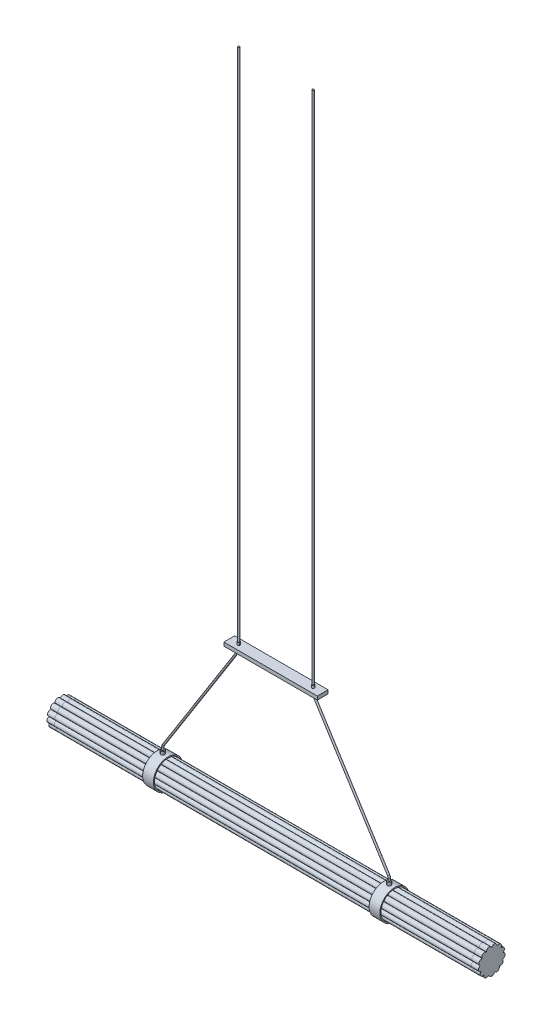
ISO-10303-21;
HEADER;
FILE_DESCRIPTION(('STEP AP214'),'2;1');
FILE_NAME('part.step','',(''),(''),'','','');
FILE_SCHEMA(('AUTOMOTIVE_DESIGN { 1 0 10303 214 1 1 1 1 }'));
ENDSEC;
DATA;
#1=APPLICATION_CONTEXT('core data for automotive mechanical design processes');
#2=APPLICATION_PROTOCOL_DEFINITION('international standard','automotive_design',2000,#1);
#3=PRODUCT_CONTEXT('',#1,'mechanical');
#4=PRODUCT('Part','Part','',(#3));
#5=PRODUCT_RELATED_PRODUCT_CATEGORY('part','',(#4));
#6=PRODUCT_DEFINITION_FORMATION('','',#4);
#7=PRODUCT_DEFINITION_CONTEXT('part definition',#1,'design');
#8=PRODUCT_DEFINITION('design','',#6,#7);
#9=PRODUCT_DEFINITION_SHAPE('','',#8);
#10=(LENGTH_UNIT() NAMED_UNIT(*) SI_UNIT(.MILLI.,.METRE.));
#11=(NAMED_UNIT(*) PLANE_ANGLE_UNIT() SI_UNIT($,.RADIAN.));
#12=(NAMED_UNIT(*) SI_UNIT($,.STERADIAN.) SOLID_ANGLE_UNIT());
#13=UNCERTAINTY_MEASURE_WITH_UNIT(LENGTH_MEASURE(1.E-05),#10,'distance_accuracy_value','');
#14=(GEOMETRIC_REPRESENTATION_CONTEXT(3) GLOBAL_UNCERTAINTY_ASSIGNED_CONTEXT((#13)) GLOBAL_UNIT_ASSIGNED_CONTEXT((#10,
#11,#12)) REPRESENTATION_CONTEXT('',''));
#15=CARTESIAN_POINT('',(0.,0.,0.));
#16=DIRECTION('',(0.,0.,1.));
#17=DIRECTION('',(1.,0.,0.));
#18=AXIS2_PLACEMENT_3D('',#15,#16,#17);
#19=CARTESIAN_POINT('',(314.999999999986,50.0000000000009,0.));
#20=DIRECTION('',(0.,-1.,0.));
#21=DIRECTION('',(0.,0.,-1.));
#22=AXIS2_PLACEMENT_3D('',#19,#20,#21);
#23=PLANE('',#22);
#24=CARTESIAN_POINT('',(314.999999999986,50.0000000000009,0.));
#25=DIRECTION('',(0.,1.,0.));
#26=DIRECTION('',(0.,0.,-1.));
#27=AXIS2_PLACEMENT_3D('',#24,#25,#26);
#28=CIRCLE('',#27,2.5);
#29=CARTESIAN_POINT('',(314.999999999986,50.0000000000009,-2.5));
#30=VERTEX_POINT('',#29);
#31=EDGE_CURVE('E67',#30,#30,#28,.T.);
#32=ORIENTED_EDGE('',*,*,#31,.F.);
#33=EDGE_LOOP('',(#32));
#34=FACE_BOUND('',#33,.T.);
#35=ADVANCED_FACE('F55',(#34),#23,.T.);
#36=CARTESIAN_POINT('',(103.5,1850.,0.));
#37=DIRECTION('',(0.,-1.,0.));
#38=DIRECTION('',(0.,0.,-1.));
#39=AXIS2_PLACEMENT_3D('',#36,#37,#38);
#40=PLANE('',#39);
#41=CARTESIAN_POINT('',(103.5,1850.,0.));
#42=DIRECTION('',(0.,1.,0.));
#43=DIRECTION('',(0.,0.,-1.));
#44=AXIS2_PLACEMENT_3D('',#41,#42,#43);
#45=CIRCLE('',#44,2.5);
#46=CARTESIAN_POINT('',(103.5,1850.,-2.5));
#47=VERTEX_POINT('',#46);
#48=EDGE_CURVE('E13',#47,#47,#45,.T.);
#49=ORIENTED_EDGE('',*,*,#48,.T.);
#50=EDGE_LOOP('',(#49));
#51=FACE_BOUND('',#50,.T.);
#52=ADVANCED_FACE('F70',(#51),#40,.F.);
#53=CARTESIAN_POINT('',(314.999999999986,50.0000000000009,0.));
#54=DIRECTION('',(0.,1.,0.));
#55=DIRECTION('',(1.,0.,0.));
#56=AXIS2_PLACEMENT_3D('',#53,#54,#55);
#57=CYLINDRICAL_SURFACE('',#56,2.5);
#58=CARTESIAN_POINT('',(314.999999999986,57.1074087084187,0.));
#59=DIRECTION('',(0.,1.,0.));
#60=DIRECTION('',(0.,0.,-1.));
#61=AXIS2_PLACEMENT_3D('',#58,#59,#60);
#62=CIRCLE('',#61,2.5);
#63=CARTESIAN_POINT('',(317.5,57.1074087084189,0.));
#64=VERTEX_POINT('',#63);
#65=EDGE_CURVE('E90',#64,#64,#62,.T.);
#66=ORIENTED_EDGE('',*,*,#65,.F.);
#67=EDGE_LOOP('',(#66));
#68=FACE_BOUND('',#67,.T.);
#69=ORIENTED_EDGE('',*,*,#31,.T.);
#70=EDGE_LOOP('',(#69));
#71=FACE_BOUND('',#70,.T.);
#72=ADVANCED_FACE('F97',(#68,#71),#57,.T.);
#73=CARTESIAN_POINT('',(305.,57.1074087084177,0.));
#74=DIRECTION('',(0.,0.,-1.));
#75=DIRECTION('',(1.,0.,0.));
#76=AXIS2_PLACEMENT_3D('',#73,#74,#75);
#77=TOROIDAL_SURFACE('',#76,10.0000000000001,2.5);
#78=CARTESIAN_POINT('',(313.455788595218,62.4459140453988,0.));
#79=DIRECTION('',(-0.533850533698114,0.84557885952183,0.));
#80=DIRECTION('',(0.,0.,-1.));
#81=AXIS2_PLACEMENT_3D('',#78,#79,#80);
#82=CIRCLE('',#81,2.5);
#83=CARTESIAN_POINT('',(315.569735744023,63.7805403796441,0.));
#84=VERTEX_POINT('',#83);
#85=EDGE_CURVE('E87',#84,#84,#82,.T.);
#86=CARTESIAN_POINT('',(305.,57.1074087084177,0.));
#87=DIRECTION('',(0.,0.,-1.));
#88=DIRECTION('',(1.,0.,0.));
#89=AXIS2_PLACEMENT_3D('',#86,#87,#88);
#90=CIRCLE('',#89,12.5000000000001);
#91=EDGE_CURVE('',#84,#64,#90,.T.);
#92=ORIENTED_EDGE('',*,*,#85,.F.);
#93=ORIENTED_EDGE('',*,*,#65,.T.);
#94=ORIENTED_EDGE('',*,*,#91,.T.);
#95=ORIENTED_EDGE('',*,*,#91,.F.);
#96=EDGE_LOOP('',(#92,#94,#93,#95));
#97=FACE_BOUND('',#96,.T.);
#98=ADVANCED_FACE('F95',(#97),#77,.T.);
#99=CARTESIAN_POINT('',(313.455788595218,62.4459140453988,0.));
#100=DIRECTION('',(-0.533850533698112,0.845578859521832,0.));
#101=DIRECTION('',(0.845578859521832,0.533850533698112,0.));
#102=AXIS2_PLACEMENT_3D('',#99,#100,#101);
#103=CYLINDRICAL_SURFACE('',#102,2.5);
#104=CARTESIAN_POINT('',(105.044211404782,392.554085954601,0.));
#105=DIRECTION('',(-0.533850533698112,0.845578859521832,0.));
#106=DIRECTION('',(0.,0.,-1.));
#107=AXIS2_PLACEMENT_3D('',#104,#105,#106);
#108=CIRCLE('',#107,2.5);
#109=CARTESIAN_POINT('',(102.930264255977,391.219459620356,0.));
#110=VERTEX_POINT('',#109);
#111=EDGE_CURVE('E82',#110,#110,#108,.T.);
#112=ORIENTED_EDGE('',*,*,#111,.F.);
#113=EDGE_LOOP('',(#112));
#114=FACE_BOUND('',#113,.T.);
#115=ORIENTED_EDGE('',*,*,#85,.T.);
#116=EDGE_LOOP('',(#115));
#117=FACE_BOUND('',#116,.T.);
#118=ADVANCED_FACE('F104',(#114,#117),#103,.T.);
#119=CARTESIAN_POINT('',(113.5,397.892591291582,0.));
#120=DIRECTION('',(0.,0.,1.));
#121=DIRECTION('',(-1.,0.,0.));
#122=AXIS2_PLACEMENT_3D('',#119,#120,#121);
#123=TOROIDAL_SURFACE('',#122,10.,2.5);
#124=CARTESIAN_POINT('',(103.5,397.892591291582,0.));
#125=DIRECTION('',(0.,1.,0.));
#126=DIRECTION('',(0.,0.,-1.));
#127=AXIS2_PLACEMENT_3D('',#124,#125,#126);
#128=CIRCLE('',#127,2.5);
#129=CARTESIAN_POINT('',(101.,397.892591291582,0.));
#130=VERTEX_POINT('',#129);
#131=EDGE_CURVE('E80',#130,#130,#128,.T.);
#132=CARTESIAN_POINT('',(113.5,397.892591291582,0.));
#133=DIRECTION('',(0.,0.,1.));
#134=DIRECTION('',(-1.,0.,0.));
#135=AXIS2_PLACEMENT_3D('',#132,#133,#134);
#136=CIRCLE('',#135,12.5);
#137=EDGE_CURVE('',#130,#110,#136,.T.);
#138=ORIENTED_EDGE('',*,*,#131,.F.);
#139=ORIENTED_EDGE('',*,*,#111,.T.);
#140=ORIENTED_EDGE('',*,*,#137,.T.);
#141=ORIENTED_EDGE('',*,*,#137,.F.);
#142=EDGE_LOOP('',(#138,#140,#139,#141));
#143=FACE_BOUND('',#142,.T.);
#144=ADVANCED_FACE('F134',(#143),#123,.T.);
#145=CARTESIAN_POINT('',(103.499999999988,397.892591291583,0.));
#146=DIRECTION('',(0.,1.,0.));
#147=DIRECTION('',(1.,0.,0.));
#148=AXIS2_PLACEMENT_3D('',#145,#146,#147);
#149=CYLINDRICAL_SURFACE('',#148,2.5);
#150=CARTESIAN_POINT('',(103.499999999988,400.000000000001,0.));
#151=DIRECTION('',(0.,1.,0.));
#152=DIRECTION('',(0.,0.,-1.));
#153=AXIS2_PLACEMENT_3D('',#150,#151,#152);
#154=CIRCLE('',#153,2.5);
#155=CARTESIAN_POINT('',(103.499999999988,400.000000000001,-2.5));
#156=VERTEX_POINT('',#155);
#157=EDGE_CURVE('E62',#156,#156,#154,.T.);
#158=ORIENTED_EDGE('',*,*,#157,.F.);
#159=EDGE_LOOP('',(#158));
#160=FACE_BOUND('',#159,.T.);
#161=ORIENTED_EDGE('',*,*,#131,.T.);
#162=EDGE_LOOP('',(#161));
#163=FACE_BOUND('',#162,.T.);
#164=ADVANCED_FACE('F75',(#160,#163),#149,.T.);
#165=CARTESIAN_POINT('',(103.5,400.,0.));
#166=DIRECTION('',(0.,1.,0.));
#167=DIRECTION('',(0.,0.,1.));
#168=AXIS2_PLACEMENT_3D('',#165,#166,#167);
#169=CYLINDRICAL_SURFACE('',#168,2.5);
#170=ORIENTED_EDGE('',*,*,#48,.F.);
#171=EDGE_LOOP('',(#170));
#172=FACE_BOUND('',#171,.T.);
#173=ORIENTED_EDGE('',*,*,#157,.T.);
#174=EDGE_LOOP('',(#173));
#175=FACE_BOUND('',#174,.T.);
#176=ADVANCED_FACE('F72',(#172,#175),#169,.T.);
#177=CLOSED_SHELL('',(#35,#52,#72,#98,#118,#144,#164,#176));
#178=MANIFOLD_SOLID_BREP('B2',#177);
#179=CARTESIAN_POINT('',(-314.999999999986,50.0000000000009,0.));
#180=DIRECTION('',(0.,-1.,0.));
#181=DIRECTION('',(0.,0.,-1.));
#182=AXIS2_PLACEMENT_3D('',#179,#180,#181);
#183=PLANE('',#182);
#184=CARTESIAN_POINT('',(-314.999999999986,50.0000000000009,0.));
#185=DIRECTION('',(0.,-1.,0.));
#186=DIRECTION('',(0.,0.,-1.));
#187=AXIS2_PLACEMENT_3D('',#184,#185,#186);
#188=CIRCLE('',#187,2.5);
#189=CARTESIAN_POINT('',(-314.999999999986,50.0000000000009,-2.5));
#190=VERTEX_POINT('',#189);
#191=EDGE_CURVE('E192',#190,#190,#188,.T.);
#192=ORIENTED_EDGE('',*,*,#191,.T.);
#193=EDGE_LOOP('',(#192));
#194=FACE_BOUND('',#193,.T.);
#195=ADVANCED_FACE('F180',(#194),#183,.T.);
#196=CARTESIAN_POINT('',(-103.5,1850.,0.));
#197=DIRECTION('',(0.,-1.,0.));
#198=DIRECTION('',(0.,0.,-1.));
#199=AXIS2_PLACEMENT_3D('',#196,#197,#198);
#200=PLANE('',#199);
#201=CARTESIAN_POINT('',(-103.5,1850.,0.));
#202=DIRECTION('',(0.,-1.,0.));
#203=DIRECTION('',(0.,0.,-1.));
#204=AXIS2_PLACEMENT_3D('',#201,#202,#203);
#205=CIRCLE('',#204,2.5);
#206=CARTESIAN_POINT('',(-103.5,1850.,-2.5));
#207=VERTEX_POINT('',#206);
#208=EDGE_CURVE('E53',#207,#207,#205,.T.);
#209=ORIENTED_EDGE('',*,*,#208,.F.);
#210=EDGE_LOOP('',(#209));
#211=FACE_BOUND('',#210,.T.);
#212=ADVANCED_FACE('F198',(#211),#200,.F.);
#213=CARTESIAN_POINT('',(-314.999999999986,50.0000000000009,0.));
#214=DIRECTION('',(0.,1.,0.));
#215=DIRECTION('',(-1.,0.,0.));
#216=AXIS2_PLACEMENT_3D('',#213,#214,#215);
#217=CYLINDRICAL_SURFACE('',#216,2.5);
#218=CARTESIAN_POINT('',(-314.999999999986,57.1074087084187,0.));
#219=DIRECTION('',(0.,-1.,0.));
#220=DIRECTION('',(0.,0.,-1.));
#221=AXIS2_PLACEMENT_3D('',#218,#219,#220);
#222=CIRCLE('',#221,2.5);
#223=CARTESIAN_POINT('',(-317.5,57.1074087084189,0.));
#224=VERTEX_POINT('',#223);
#225=EDGE_CURVE('E236',#224,#224,#222,.T.);
#226=ORIENTED_EDGE('',*,*,#225,.T.);
#227=EDGE_LOOP('',(#226));
#228=FACE_BOUND('',#227,.T.);
#229=ORIENTED_EDGE('',*,*,#191,.F.);
#230=EDGE_LOOP('',(#229));
#231=FACE_BOUND('',#230,.T.);
#232=ADVANCED_FACE('F200',(#228,#231),#217,.T.);
#233=CARTESIAN_POINT('',(-305.,57.1074087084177,0.));
#234=DIRECTION('',(0.,0.,-1.));
#235=DIRECTION('',(-1.,0.,0.));
#236=AXIS2_PLACEMENT_3D('',#233,#234,#235);
#237=TOROIDAL_SURFACE('',#236,10.0000000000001,2.5);
#238=CARTESIAN_POINT('',(-313.455788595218,62.4459140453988,0.));
#239=DIRECTION('',(-0.533850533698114,-0.84557885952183,0.));
#240=DIRECTION('',(0.,0.,-1.));
#241=AXIS2_PLACEMENT_3D('',#238,#239,#240);
#242=CIRCLE('',#241,2.5);
#243=CARTESIAN_POINT('',(-315.569735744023,63.7805403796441,0.));
#244=VERTEX_POINT('',#243);
#245=EDGE_CURVE('E233',#244,#244,#242,.T.);
#246=CARTESIAN_POINT('',(-305.,57.1074087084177,0.));
#247=DIRECTION('',(0.,0.,-1.));
#248=DIRECTION('',(-1.,0.,0.));
#249=AXIS2_PLACEMENT_3D('',#246,#247,#248);
#250=CIRCLE('',#249,12.5000000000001);
#251=EDGE_CURVE('',#224,#244,#250,.T.);
#252=ORIENTED_EDGE('',*,*,#225,.F.);
#253=ORIENTED_EDGE('',*,*,#245,.T.);
#254=ORIENTED_EDGE('',*,*,#251,.T.);
#255=ORIENTED_EDGE('',*,*,#251,.F.);
#256=EDGE_LOOP('',(#252,#254,#253,#255));
#257=FACE_BOUND('',#256,.T.);
#258=ADVANCED_FACE('F205',(#257),#237,.T.);
#259=CARTESIAN_POINT('',(-313.455788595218,62.4459140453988,0.));
#260=DIRECTION('',(0.533850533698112,0.845578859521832,0.));
#261=DIRECTION('',(-0.845578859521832,0.533850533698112,0.));
#262=AXIS2_PLACEMENT_3D('',#259,#260,#261);
#263=CYLINDRICAL_SURFACE('',#262,2.5);
#264=CARTESIAN_POINT('',(-105.044211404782,392.554085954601,0.));
#265=DIRECTION('',(-0.533850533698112,-0.845578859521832,0.));
#266=DIRECTION('',(0.,0.,-1.));
#267=AXIS2_PLACEMENT_3D('',#264,#265,#266);
#268=CIRCLE('',#267,2.5);
#269=CARTESIAN_POINT('',(-102.930264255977,391.219459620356,0.));
#270=VERTEX_POINT('',#269);
#271=EDGE_CURVE('E238',#270,#270,#268,.T.);
#272=ORIENTED_EDGE('',*,*,#271,.T.);
#273=EDGE_LOOP('',(#272));
#274=FACE_BOUND('',#273,.T.);
#275=ORIENTED_EDGE('',*,*,#245,.F.);
#276=EDGE_LOOP('',(#275));
#277=FACE_BOUND('',#276,.T.);
#278=ADVANCED_FACE('F221',(#274,#277),#263,.T.);
#279=CARTESIAN_POINT('',(-113.5,397.892591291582,0.));
#280=DIRECTION('',(0.,0.,1.));
#281=DIRECTION('',(1.,0.,0.));
#282=AXIS2_PLACEMENT_3D('',#279,#280,#281);
#283=TOROIDAL_SURFACE('',#282,10.,2.5);
#284=CARTESIAN_POINT('',(-103.5,397.892591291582,0.));
#285=DIRECTION('',(0.,-1.,0.));
#286=DIRECTION('',(0.,0.,-1.));
#287=AXIS2_PLACEMENT_3D('',#284,#285,#286);
#288=CIRCLE('',#287,2.5);
#289=CARTESIAN_POINT('',(-101.,397.892591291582,0.));
#290=VERTEX_POINT('',#289);
#291=EDGE_CURVE('E244',#290,#290,#288,.T.);
#292=CARTESIAN_POINT('',(-113.5,397.892591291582,0.));
#293=DIRECTION('',(0.,0.,1.));
#294=DIRECTION('',(1.,0.,0.));
#295=AXIS2_PLACEMENT_3D('',#292,#293,#294);
#296=CIRCLE('',#295,12.5);
#297=EDGE_CURVE('',#270,#290,#296,.T.);
#298=ORIENTED_EDGE('',*,*,#271,.F.);
#299=ORIENTED_EDGE('',*,*,#291,.T.);
#300=ORIENTED_EDGE('',*,*,#297,.T.);
#301=ORIENTED_EDGE('',*,*,#297,.F.);
#302=EDGE_LOOP('',(#298,#300,#299,#301));
#303=FACE_BOUND('',#302,.T.);
#304=ADVANCED_FACE('F215',(#303),#283,.T.);
#305=CARTESIAN_POINT('',(-103.499999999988,397.892591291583,0.));
#306=DIRECTION('',(0.,1.,0.));
#307=DIRECTION('',(-1.,0.,0.));
#308=AXIS2_PLACEMENT_3D('',#305,#306,#307);
#309=CYLINDRICAL_SURFACE('',#308,2.5);
#310=CARTESIAN_POINT('',(-103.499999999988,400.000000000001,0.));
#311=DIRECTION('',(0.,-1.,0.));
#312=DIRECTION('',(0.,0.,-1.));
#313=AXIS2_PLACEMENT_3D('',#310,#311,#312);
#314=CIRCLE('',#313,2.5);
#315=CARTESIAN_POINT('',(-103.499999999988,400.000000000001,-2.5));
#316=VERTEX_POINT('',#315);
#317=EDGE_CURVE('E187',#316,#316,#314,.T.);
#318=ORIENTED_EDGE('',*,*,#317,.T.);
#319=EDGE_LOOP('',(#318));
#320=FACE_BOUND('',#319,.T.);
#321=ORIENTED_EDGE('',*,*,#291,.F.);
#322=EDGE_LOOP('',(#321));
#323=FACE_BOUND('',#322,.T.);
#324=ADVANCED_FACE('F211',(#320,#323),#309,.T.);
#325=CARTESIAN_POINT('',(-103.5,400.,0.));
#326=DIRECTION('',(0.,1.,0.));
#327=DIRECTION('',(0.,0.,1.));
#328=AXIS2_PLACEMENT_3D('',#325,#326,#327);
#329=CYLINDRICAL_SURFACE('',#328,2.5);
#330=ORIENTED_EDGE('',*,*,#208,.T.);
#331=EDGE_LOOP('',(#330));
#332=FACE_BOUND('',#331,.T.);
#333=ORIENTED_EDGE('',*,*,#317,.F.);
#334=EDGE_LOOP('',(#333));
#335=FACE_BOUND('',#334,.T.);
#336=ADVANCED_FACE('F195',(#332,#335),#329,.T.);
#337=CLOSED_SHELL('',(#195,#212,#232,#258,#278,#304,#324,#336));
#338=MANIFOLD_SOLID_BREP('B7',#337);
#339=CARTESIAN_POINT('',(-102.,412.5,0.));
#340=DIRECTION('',(1.,0.,0.));
#341=DIRECTION('',(0.,0.,1.));
#342=AXIS2_PLACEMENT_3D('',#339,#340,#341);
#343=CYLINDRICAL_SURFACE('',#342,1.5);
#344=CARTESIAN_POINT('',(-101.,412.5,0.));
#345=DIRECTION('',(1.,0.,0.));
#346=DIRECTION('',(0.,0.,-1.));
#347=AXIS2_PLACEMENT_3D('',#344,#345,#346);
#348=CIRCLE('',#347,1.5);
#349=CARTESIAN_POINT('',(-101.,412.5,1.5));
#350=VERTEX_POINT('',#349);
#351=EDGE_CURVE('E179',#350,#350,#348,.F.);
#352=ORIENTED_EDGE('',*,*,#351,.F.);
#353=EDGE_LOOP('',(#352));
#354=FACE_BOUND('',#353,.T.);
#355=CARTESIAN_POINT('',(-100.,412.5,0.));
#356=DIRECTION('',(1.,0.,0.));
#357=DIRECTION('',(0.,0.,-1.));
#358=AXIS2_PLACEMENT_3D('',#355,#356,#357);
#359=CIRCLE('',#358,1.5);
#360=CARTESIAN_POINT('',(-100.,412.5,-1.5));
#361=VERTEX_POINT('',#360);
#362=EDGE_CURVE('E316',#361,#361,#359,.T.);
#363=ORIENTED_EDGE('',*,*,#362,.F.);
#364=EDGE_LOOP('',(#363));
#365=FACE_BOUND('',#364,.T.);
#366=ADVANCED_FACE('F305',(#354,#365),#343,.T.);
#367=CARTESIAN_POINT('',(-102.,412.5,0.));
#368=DIRECTION('',(-1.,0.,0.));
#369=DIRECTION('',(0.,0.,-1.));
#370=AXIS2_PLACEMENT_3D('',#367,#368,#369);
#371=PLANE('',#370);
#372=CARTESIAN_POINT('',(-102.,412.5,0.));
#373=DIRECTION('',(1.,0.,0.));
#374=DIRECTION('',(0.,0.,-1.));
#375=AXIS2_PLACEMENT_3D('',#372,#373,#374);
#376=CIRCLE('',#375,0.5);
#377=CARTESIAN_POINT('',(-102.,412.5,0.499999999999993));
#378=VERTEX_POINT('',#377);
#379=EDGE_CURVE('E312',#378,#378,#376,.T.);
#380=ORIENTED_EDGE('',*,*,#379,.F.);
#381=EDGE_LOOP('',(#380));
#382=FACE_BOUND('',#381,.T.);
#383=ADVANCED_FACE('F349',(#382),#371,.T.);
#384=CARTESIAN_POINT('',(-100.,412.5,0.));
#385=DIRECTION('',(-1.,0.,0.));
#386=DIRECTION('',(0.,0.,-1.));
#387=AXIS2_PLACEMENT_3D('',#384,#385,#386);
#388=PLANE('',#387);
#389=CARTESIAN_POINT('',(-100.,412.5,0.));
#390=DIRECTION('',(1.,0.,0.));
#391=DIRECTION('',(0.,0.,-1.));
#392=AXIS2_PLACEMENT_3D('',#389,#390,#391);
#393=CIRCLE('',#392,0.500000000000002);
#394=CARTESIAN_POINT('',(-100.,412.5,-0.500000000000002));
#395=VERTEX_POINT('',#394);
#396=EDGE_CURVE('E323',#395,#395,#393,.T.);
#397=ORIENTED_EDGE('',*,*,#396,.F.);
#398=EDGE_LOOP('',(#397));
#399=FACE_BOUND('',#398,.T.);
#400=ORIENTED_EDGE('',*,*,#362,.T.);
#401=EDGE_LOOP('',(#400));
#402=FACE_BOUND('',#401,.T.);
#403=ADVANCED_FACE('F354',(#399,#402),#388,.F.);
#404=CARTESIAN_POINT('',(-102.,412.5,0.));
#405=DIRECTION('',(1.,0.,0.));
#406=DIRECTION('',(0.,0.,1.));
#407=AXIS2_PLACEMENT_3D('',#404,#405,#406);
#408=CONICAL_SURFACE('',#407,0.5,0.785398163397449);
#409=CARTESIAN_POINT('',(-101.,412.5,1.5));
#410=CARTESIAN_POINT('',(-101.010416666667,412.5,1.48958333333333));
#411=CARTESIAN_POINT('',(-101.020833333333,412.5,1.47916666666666));
#412=CARTESIAN_POINT('',(-101.041666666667,412.5,1.45833333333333));
#413=CARTESIAN_POINT('',(-101.052083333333,412.5,1.44791666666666));
#414=CARTESIAN_POINT('',(-101.072916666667,412.5,1.42708333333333));
#415=CARTESIAN_POINT('',(-101.083333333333,412.5,1.41666666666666));
#416=CARTESIAN_POINT('',(-101.104166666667,412.5,1.39583333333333));
#417=CARTESIAN_POINT('',(-101.114583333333,412.5,1.38541666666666));
#418=CARTESIAN_POINT('',(-101.135416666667,412.5,1.36458333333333));
#419=CARTESIAN_POINT('',(-101.145833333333,412.5,1.35416666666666));
#420=CARTESIAN_POINT('',(-101.166666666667,412.5,1.33333333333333));
#421=CARTESIAN_POINT('',(-101.177083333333,412.5,1.32291666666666));
#422=CARTESIAN_POINT('',(-101.197916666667,412.5,1.30208333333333));
#423=CARTESIAN_POINT('',(-101.208333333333,412.5,1.29166666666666));
#424=CARTESIAN_POINT('',(-101.229166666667,412.5,1.27083333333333));
#425=CARTESIAN_POINT('',(-101.239583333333,412.5,1.26041666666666));
#426=CARTESIAN_POINT('',(-101.260416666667,412.5,1.23958333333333));
#427=CARTESIAN_POINT('',(-101.270833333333,412.5,1.22916666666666));
#428=CARTESIAN_POINT('',(-101.291666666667,412.5,1.20833333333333));
#429=CARTESIAN_POINT('',(-101.302083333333,412.5,1.19791666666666));
#430=CARTESIAN_POINT('',(-101.322916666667,412.5,1.17708333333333));
#431=CARTESIAN_POINT('',(-101.333333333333,412.5,1.16666666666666));
#432=CARTESIAN_POINT('',(-101.354166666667,412.5,1.14583333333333));
#433=CARTESIAN_POINT('',(-101.364583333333,412.5,1.13541666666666));
#434=CARTESIAN_POINT('',(-101.385416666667,412.5,1.11458333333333));
#435=CARTESIAN_POINT('',(-101.395833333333,412.5,1.10416666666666));
#436=CARTESIAN_POINT('',(-101.416666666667,412.5,1.08333333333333));
#437=CARTESIAN_POINT('',(-101.427083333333,412.5,1.07291666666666));
#438=CARTESIAN_POINT('',(-101.447916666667,412.5,1.05208333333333));
#439=CARTESIAN_POINT('',(-101.458333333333,412.5,1.04166666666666));
#440=CARTESIAN_POINT('',(-101.479166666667,412.5,1.02083333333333));
#441=CARTESIAN_POINT('',(-101.489583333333,412.5,1.01041666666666));
#442=CARTESIAN_POINT('',(-101.510416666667,412.5,0.989583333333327));
#443=CARTESIAN_POINT('',(-101.520833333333,412.5,0.979166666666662));
#444=CARTESIAN_POINT('',(-101.541666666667,412.5,0.958333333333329));
#445=CARTESIAN_POINT('',(-101.552083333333,412.5,0.947916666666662));
#446=CARTESIAN_POINT('',(-101.572916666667,412.5,0.927083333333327));
#447=CARTESIAN_POINT('',(-101.583333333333,412.5,0.916666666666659));
#448=CARTESIAN_POINT('',(-101.604166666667,412.5,0.895833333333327));
#449=CARTESIAN_POINT('',(-101.614583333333,412.5,0.885416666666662));
#450=CARTESIAN_POINT('',(-101.635416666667,412.5,0.864583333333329));
#451=CARTESIAN_POINT('',(-101.645833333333,412.5,0.854166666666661));
#452=CARTESIAN_POINT('',(-101.666666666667,412.5,0.833333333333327));
#453=CARTESIAN_POINT('',(-101.677083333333,412.5,0.82291666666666));
#454=CARTESIAN_POINT('',(-101.697916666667,412.5,0.802083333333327));
#455=CARTESIAN_POINT('',(-101.708333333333,412.5,0.791666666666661));
#456=CARTESIAN_POINT('',(-101.729166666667,412.5,0.770833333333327));
#457=CARTESIAN_POINT('',(-101.739583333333,412.5,0.760416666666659));
#458=CARTESIAN_POINT('',(-101.760416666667,412.5,0.739583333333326));
#459=CARTESIAN_POINT('',(-101.770833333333,412.5,0.729166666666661));
#460=CARTESIAN_POINT('',(-101.791666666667,412.5,0.708333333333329));
#461=CARTESIAN_POINT('',(-101.802083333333,412.5,0.697916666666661));
#462=CARTESIAN_POINT('',(-101.822916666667,412.5,0.677083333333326));
#463=CARTESIAN_POINT('',(-101.833333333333,412.5,0.666666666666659));
#464=CARTESIAN_POINT('',(-101.854166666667,412.5,0.645833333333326));
#465=CARTESIAN_POINT('',(-101.864583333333,412.5,0.635416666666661));
#466=CARTESIAN_POINT('',(-101.885416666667,412.5,0.614583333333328));
#467=CARTESIAN_POINT('',(-101.895833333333,412.5,0.604166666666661));
#468=CARTESIAN_POINT('',(-101.916666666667,412.5,0.583333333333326));
#469=CARTESIAN_POINT('',(-101.927083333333,412.5,0.57291666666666));
#470=CARTESIAN_POINT('',(-101.947916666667,412.5,0.552083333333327));
#471=CARTESIAN_POINT('',(-101.958333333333,412.5,0.54166666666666));
#472=CARTESIAN_POINT('',(-101.979166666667,412.5,0.520833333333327));
#473=CARTESIAN_POINT('',(-101.989583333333,412.5,0.51041666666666));
#474=CARTESIAN_POINT('',(-102.,412.5,0.499999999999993));
#475=B_SPLINE_CURVE_WITH_KNOTS('',3,(#409,#410,#411,#412,#413,#414,#415,#416,#417,#418,#419,
#420,#421,#422,#423,#424,#425,#426,#427,#428,#429,#430,#431,#432,#433,#434,#435,#436,#437,#438,
#439,#440,#441,#442,#443,#444,#445,#446,#447,#448,#449,#450,#451,#452,#453,#454,#455,#456,#457,
#458,#459,#460,#461,#462,#463,#464,#465,#466,#467,#468,#469,#470,#471,#472,#473,#474),
.UNSPECIFIED.,.F.,.F.,(4,2,2,2,2,2,2,2,2,2,2,2,2,2,2,2,2,2,2,2,2,2,2,2,2,2,2,2,2,2,2,2,4),(0.,
0.0441941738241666,0.0883883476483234,0.13258252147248,0.176776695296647,0.220970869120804,
0.265165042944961,0.309359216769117,0.353553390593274,0.397747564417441,0.441941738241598,
0.486135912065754,0.530330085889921,0.574524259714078,0.618718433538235,0.662912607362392,
0.707106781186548,0.751300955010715,0.795495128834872,0.839689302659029,0.883883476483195,
0.928077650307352,0.972271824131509,1.01646599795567,1.06066017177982,1.10485434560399,
1.14904851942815,1.1932426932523,1.23743686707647,1.28163104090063,1.32582521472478,
1.37001938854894,1.4142135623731),.UNSPECIFIED.);
#476=EDGE_CURVE('BSEAM307',#350,#378,#475,.T.);
#477=ORIENTED_EDGE('',*,*,#351,.T.);
#478=ORIENTED_EDGE('',*,*,#379,.T.);
#479=ORIENTED_EDGE('',*,*,#476,.T.);
#480=ORIENTED_EDGE('',*,*,#476,.F.);
#481=EDGE_LOOP('',(#477,#479,#478,#480));
#482=FACE_BOUND('',#481,.T.);
#483=ADVANCED_FACE('F307',(#482),#408,.T.);
#484=CARTESIAN_POINT('',(-102.,412.5,0.));
#485=DIRECTION('',(1.,0.,0.));
#486=DIRECTION('',(0.,0.,1.));
#487=AXIS2_PLACEMENT_3D('',#484,#485,#486);
#488=CYLINDRICAL_SURFACE('',#487,0.500000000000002);
#489=CARTESIAN_POINT('',(-100.585786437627,412.5,0.));
#490=DIRECTION('',(-1.,0.,0.));
#491=DIRECTION('',(0.,0.,1.));
#492=AXIS2_PLACEMENT_3D('',#489,#490,#491);
#493=CIRCLE('',#492,0.500000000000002);
#494=CARTESIAN_POINT('',(-100.585786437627,412.5,0.500000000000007));
#495=VERTEX_POINT('',#494);
#496=EDGE_CURVE('E320',#495,#495,#493,.T.);
#497=ORIENTED_EDGE('',*,*,#496,.T.);
#498=EDGE_LOOP('',(#497));
#499=FACE_BOUND('',#498,.T.);
#500=ORIENTED_EDGE('',*,*,#396,.T.);
#501=EDGE_LOOP('',(#500));
#502=FACE_BOUND('',#501,.T.);
#503=ADVANCED_FACE('F332',(#499,#502),#488,.F.);
#504=CARTESIAN_POINT('',(-101.,412.5,0.));
#505=DIRECTION('',(-1.,0.,0.));
#506=DIRECTION('',(0.,0.,-1.));
#507=AXIS2_PLACEMENT_3D('',#504,#505,#506);
#508=PLANE('',#507);
#509=CARTESIAN_POINT('',(-101.,412.5,0.));
#510=DIRECTION('',(1.,0.,0.));
#511=DIRECTION('',(0.,0.,-1.));
#512=AXIS2_PLACEMENT_3D('',#509,#510,#511);
#513=CIRCLE('',#512,0.0857864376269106);
#514=CARTESIAN_POINT('',(-101.,412.5,0.0857864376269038));
#515=VERTEX_POINT('',#514);
#516=EDGE_CURVE('E326',#515,#515,#513,.T.);
#517=ORIENTED_EDGE('',*,*,#516,.T.);
#518=EDGE_LOOP('',(#517));
#519=FACE_BOUND('',#518,.T.);
#520=ADVANCED_FACE('F338',(#519),#508,.F.);
#521=CARTESIAN_POINT('',(-100.585786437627,412.5,0.));
#522=DIRECTION('',(1.,0.,0.));
#523=DIRECTION('',(0.,0.,1.));
#524=AXIS2_PLACEMENT_3D('',#521,#522,#523);
#525=CONICAL_SURFACE('',#524,0.5,0.785398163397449);
#526=CARTESIAN_POINT('',(-100.585786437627,412.5,0.500000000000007));
#527=CARTESIAN_POINT('',(-100.590101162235,412.5,0.495685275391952));
#528=CARTESIAN_POINT('',(-100.594415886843,412.5,0.4913705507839));
#529=CARTESIAN_POINT('',(-100.603045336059,412.5,0.482741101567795));
#530=CARTESIAN_POINT('',(-100.607360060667,412.5,0.478426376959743));
#531=CARTESIAN_POINT('',(-100.615989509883,412.5,0.469796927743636));
#532=CARTESIAN_POINT('',(-100.620304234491,412.5,0.465482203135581));
#533=CARTESIAN_POINT('',(-100.628933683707,412.5,0.456852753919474));
#534=CARTESIAN_POINT('',(-100.633248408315,412.5,0.452538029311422));
#535=CARTESIAN_POINT('',(-100.641877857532,412.5,0.443908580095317));
#536=CARTESIAN_POINT('',(-100.64619258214,412.5,0.439593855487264));
#537=CARTESIAN_POINT('',(-100.654822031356,412.5,0.430964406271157));
#538=CARTESIAN_POINT('',(-100.659136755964,412.5,0.426649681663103));
#539=CARTESIAN_POINT('',(-100.66776620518,412.5,0.418020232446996));
#540=CARTESIAN_POINT('',(-100.672080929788,412.5,0.413705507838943));
#541=CARTESIAN_POINT('',(-100.680710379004,412.5,0.405076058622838));
#542=CARTESIAN_POINT('',(-100.685025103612,412.5,0.400761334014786));
#543=CARTESIAN_POINT('',(-100.693654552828,412.5,0.392131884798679));
#544=CARTESIAN_POINT('',(-100.697969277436,412.5,0.387817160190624));
#545=CARTESIAN_POINT('',(-100.706598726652,412.5,0.379187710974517));
#546=CARTESIAN_POINT('',(-100.71091345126,412.5,0.374872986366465));
#547=CARTESIAN_POINT('',(-100.719542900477,412.5,0.36624353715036));
#548=CARTESIAN_POINT('',(-100.723857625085,412.5,0.361928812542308));
#549=CARTESIAN_POINT('',(-100.732487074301,412.5,0.3532993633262));
#550=CARTESIAN_POINT('',(-100.736801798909,412.5,0.348984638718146));
#551=CARTESIAN_POINT('',(-100.745431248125,412.5,0.340355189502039));
#552=CARTESIAN_POINT('',(-100.749745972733,412.5,0.336040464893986));
#553=CARTESIAN_POINT('',(-100.758375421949,412.5,0.327411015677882));
#554=CARTESIAN_POINT('',(-100.762690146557,412.5,0.323096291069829));
#555=CARTESIAN_POINT('',(-100.771319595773,412.5,0.314466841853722));
#556=CARTESIAN_POINT('',(-100.775634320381,412.5,0.310152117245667));
#557=CARTESIAN_POINT('',(-100.784263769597,412.5,0.30152266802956));
#558=CARTESIAN_POINT('',(-100.788578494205,412.5,0.297207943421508));
#559=CARTESIAN_POINT('',(-100.797207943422,412.5,0.288578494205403));
#560=CARTESIAN_POINT('',(-100.80152266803,412.5,0.284263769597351));
#561=CARTESIAN_POINT('',(-100.810152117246,412.5,0.275634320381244));
#562=CARTESIAN_POINT('',(-100.814466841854,412.5,0.271319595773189));
#563=CARTESIAN_POINT('',(-100.82309629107,412.5,0.262690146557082));
#564=CARTESIAN_POINT('',(-100.827411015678,412.5,0.258375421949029));
#565=CARTESIAN_POINT('',(-100.836040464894,412.5,0.249745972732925));
#566=CARTESIAN_POINT('',(-100.840355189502,412.5,0.245431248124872));
#567=CARTESIAN_POINT('',(-100.848984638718,412.5,0.236801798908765));
#568=CARTESIAN_POINT('',(-100.853299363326,412.5,0.23248707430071));
#569=CARTESIAN_POINT('',(-100.861928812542,412.5,0.223857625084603));
#570=CARTESIAN_POINT('',(-100.86624353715,412.5,0.219542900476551));
#571=CARTESIAN_POINT('',(-100.874872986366,412.5,0.210913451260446));
#572=CARTESIAN_POINT('',(-100.879187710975,412.5,0.206598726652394));
#573=CARTESIAN_POINT('',(-100.887817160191,412.5,0.197969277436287));
#574=CARTESIAN_POINT('',(-100.892131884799,412.5,0.193654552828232));
#575=CARTESIAN_POINT('',(-100.900761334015,412.5,0.185025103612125));
#576=CARTESIAN_POINT('',(-100.905076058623,412.5,0.180710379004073));
#577=CARTESIAN_POINT('',(-100.913705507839,412.5,0.172080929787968));
#578=CARTESIAN_POINT('',(-100.918020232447,412.5,0.167766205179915));
#579=CARTESIAN_POINT('',(-100.926649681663,412.5,0.159136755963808));
#580=CARTESIAN_POINT('',(-100.930964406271,412.5,0.154822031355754));
#581=CARTESIAN_POINT('',(-100.939593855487,412.5,0.146192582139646));
#582=CARTESIAN_POINT('',(-100.943908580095,412.5,0.141877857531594));
#583=CARTESIAN_POINT('',(-100.952538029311,412.5,0.133248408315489));
#584=CARTESIAN_POINT('',(-100.956852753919,412.5,0.128933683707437));
#585=CARTESIAN_POINT('',(-100.965482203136,412.5,0.12030423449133));
#586=CARTESIAN_POINT('',(-100.969796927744,412.5,0.115989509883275));
#587=CARTESIAN_POINT('',(-100.97842637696,412.5,0.107360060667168));
#588=CARTESIAN_POINT('',(-100.982741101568,412.5,0.103045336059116));
#589=CARTESIAN_POINT('',(-100.991370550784,412.5,0.0944158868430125));
#590=CARTESIAN_POINT('',(-100.995685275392,412.5,0.0901011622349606));
#591=CARTESIAN_POINT('',(-101.,412.5,0.0857864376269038));
#592=B_SPLINE_CURVE_WITH_KNOTS('',3,(#526,#527,#528,#529,#530,#531,#532,#533,#534,#535,#536,
#537,#538,#539,#540,#541,#542,#543,#544,#545,#546,#547,#548,#549,#550,#551,#552,#553,#554,#555,
#556,#557,#558,#559,#560,#561,#562,#563,#564,#565,#566,#567,#568,#569,#570,#571,#572,#573,#574,
#575,#576,#577,#578,#579,#580,#581,#582,#583,#584,#585,#586,#587,#588,#589,#590,#591),
.UNSPECIFIED.,.F.,.F.,(4,2,2,2,2,2,2,2,2,2,2,2,2,2,2,2,2,2,2,2,2,2,2,2,2,2,2,2,2,2,2,2,4),(0.,
0.0183058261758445,0.036611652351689,0.0549174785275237,0.0732233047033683,0.0915291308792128,
0.109834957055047,0.128140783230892,0.146446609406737,0.164752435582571,0.183058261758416,
0.20136408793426,0.219669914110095,0.237975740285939,0.256281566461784,0.274587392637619,
0.292893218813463,0.311199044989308,0.329504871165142,0.347810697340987,0.366116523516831,
0.384422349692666,0.402728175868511,0.421034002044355,0.43933982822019,0.457645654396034,
0.475951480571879,0.494257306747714,0.512563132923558,0.530868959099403,0.549174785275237,
0.567480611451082,0.585786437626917),.UNSPECIFIED.);
#593=EDGE_CURVE('BSEAM335',#495,#515,#592,.T.);
#594=ORIENTED_EDGE('',*,*,#496,.F.);
#595=ORIENTED_EDGE('',*,*,#516,.F.);
#596=ORIENTED_EDGE('',*,*,#593,.T.);
#597=ORIENTED_EDGE('',*,*,#593,.F.);
#598=EDGE_LOOP('',(#594,#596,#595,#597));
#599=FACE_BOUND('',#598,.T.);
#600=ADVANCED_FACE('F335',(#599),#525,.F.);
#601=CLOSED_SHELL('',(#366,#383,#403,#483,#503,#520,#600));
#602=MANIFOLD_SOLID_BREP('B47',#601);
#603=CARTESIAN_POINT('',(102.,412.5,0.));
#604=DIRECTION('',(-1.,0.,0.));
#605=DIRECTION('',(0.,0.,1.));
#606=AXIS2_PLACEMENT_3D('',#603,#604,#605);
#607=CYLINDRICAL_SURFACE('',#606,1.5);
#608=CARTESIAN_POINT('',(101.,412.5,0.));
#609=DIRECTION('',(1.,0.,0.));
#610=DIRECTION('',(0.,0.,-1.));
#611=AXIS2_PLACEMENT_3D('',#608,#609,#610);
#612=CIRCLE('',#611,1.5);
#613=CARTESIAN_POINT('',(101.,412.5,1.50000000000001));
#614=VERTEX_POINT('',#613);
#615=EDGE_CURVE('E304',#614,#614,#612,.F.);
#616=ORIENTED_EDGE('',*,*,#615,.T.);
#617=EDGE_LOOP('',(#616));
#618=FACE_BOUND('',#617,.T.);
#619=CARTESIAN_POINT('',(100.,412.5,0.));
#620=DIRECTION('',(1.,0.,0.));
#621=DIRECTION('',(0.,0.,-1.));
#622=AXIS2_PLACEMENT_3D('',#619,#620,#621);
#623=CIRCLE('',#622,1.5);
#624=CARTESIAN_POINT('',(100.,412.5,-1.5));
#625=VERTEX_POINT('',#624);
#626=EDGE_CURVE('E424',#625,#625,#623,.T.);
#627=ORIENTED_EDGE('',*,*,#626,.T.);
#628=EDGE_LOOP('',(#627));
#629=FACE_BOUND('',#628,.T.);
#630=ADVANCED_FACE('F413',(#618,#629),#607,.T.);
#631=CARTESIAN_POINT('',(102.,412.5,0.));
#632=DIRECTION('',(1.,0.,0.));
#633=DIRECTION('',(0.,0.,-1.));
#634=AXIS2_PLACEMENT_3D('',#631,#632,#633);
#635=PLANE('',#634);
#636=CARTESIAN_POINT('',(102.,412.5,0.));
#637=DIRECTION('',(1.,0.,0.));
#638=DIRECTION('',(0.,0.,-1.));
#639=AXIS2_PLACEMENT_3D('',#636,#637,#638);
#640=CIRCLE('',#639,0.5);
#641=CARTESIAN_POINT('',(102.,412.5,0.500000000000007));
#642=VERTEX_POINT('',#641);
#643=EDGE_CURVE('E420',#642,#642,#640,.T.);
#644=ORIENTED_EDGE('',*,*,#643,.T.);
#645=EDGE_LOOP('',(#644));
#646=FACE_BOUND('',#645,.T.);
#647=ADVANCED_FACE('F453',(#646),#635,.T.);
#648=CARTESIAN_POINT('',(100.,412.5,0.));
#649=DIRECTION('',(1.,0.,0.));
#650=DIRECTION('',(0.,0.,-1.));
#651=AXIS2_PLACEMENT_3D('',#648,#649,#650);
#652=PLANE('',#651);
#653=CARTESIAN_POINT('',(100.,412.5,0.));
#654=DIRECTION('',(1.,0.,0.));
#655=DIRECTION('',(0.,0.,-1.));
#656=AXIS2_PLACEMENT_3D('',#653,#654,#655);
#657=CIRCLE('',#656,0.500000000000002);
#658=CARTESIAN_POINT('',(100.,412.5,-0.500000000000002));
#659=VERTEX_POINT('',#658);
#660=EDGE_CURVE('E431',#659,#659,#657,.T.);
#661=ORIENTED_EDGE('',*,*,#660,.T.);
#662=EDGE_LOOP('',(#661));
#663=FACE_BOUND('',#662,.T.);
#664=ORIENTED_EDGE('',*,*,#626,.F.);
#665=EDGE_LOOP('',(#664));
#666=FACE_BOUND('',#665,.T.);
#667=ADVANCED_FACE('F450',(#663,#666),#652,.F.);
#668=CARTESIAN_POINT('',(102.,412.5,0.));
#669=DIRECTION('',(-1.,0.,0.));
#670=DIRECTION('',(0.,0.,1.));
#671=AXIS2_PLACEMENT_3D('',#668,#669,#670);
#672=CONICAL_SURFACE('',#671,0.5,0.785398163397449);
#673=CARTESIAN_POINT('',(101.,412.5,1.50000000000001));
#674=CARTESIAN_POINT('',(101.010416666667,412.5,1.48958333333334));
#675=CARTESIAN_POINT('',(101.020833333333,412.5,1.47916666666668));
#676=CARTESIAN_POINT('',(101.041666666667,412.5,1.45833333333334));
#677=CARTESIAN_POINT('',(101.052083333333,412.5,1.44791666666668));
#678=CARTESIAN_POINT('',(101.072916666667,412.5,1.42708333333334));
#679=CARTESIAN_POINT('',(101.083333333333,412.5,1.41666666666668));
#680=CARTESIAN_POINT('',(101.104166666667,412.5,1.39583333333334));
#681=CARTESIAN_POINT('',(101.114583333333,412.5,1.38541666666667));
#682=CARTESIAN_POINT('',(101.135416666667,412.5,1.36458333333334));
#683=CARTESIAN_POINT('',(101.145833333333,412.5,1.35416666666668));
#684=CARTESIAN_POINT('',(101.166666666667,412.5,1.33333333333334));
#685=CARTESIAN_POINT('',(101.177083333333,412.5,1.32291666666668));
#686=CARTESIAN_POINT('',(101.197916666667,412.5,1.30208333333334));
#687=CARTESIAN_POINT('',(101.208333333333,412.5,1.29166666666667));
#688=CARTESIAN_POINT('',(101.229166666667,412.5,1.27083333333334));
#689=CARTESIAN_POINT('',(101.239583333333,412.5,1.26041666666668));
#690=CARTESIAN_POINT('',(101.260416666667,412.5,1.23958333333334));
#691=CARTESIAN_POINT('',(101.270833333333,412.5,1.22916666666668));
#692=CARTESIAN_POINT('',(101.291666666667,412.5,1.20833333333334));
#693=CARTESIAN_POINT('',(101.302083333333,412.5,1.19791666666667));
#694=CARTESIAN_POINT('',(101.322916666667,412.5,1.17708333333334));
#695=CARTESIAN_POINT('',(101.333333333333,412.5,1.16666666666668));
#696=CARTESIAN_POINT('',(101.354166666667,412.5,1.14583333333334));
#697=CARTESIAN_POINT('',(101.364583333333,412.5,1.13541666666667));
#698=CARTESIAN_POINT('',(101.385416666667,412.5,1.11458333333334));
#699=CARTESIAN_POINT('',(101.395833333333,412.5,1.10416666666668));
#700=CARTESIAN_POINT('',(101.416666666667,412.5,1.08333333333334));
#701=CARTESIAN_POINT('',(101.427083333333,412.5,1.07291666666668));
#702=CARTESIAN_POINT('',(101.447916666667,412.5,1.05208333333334));
#703=CARTESIAN_POINT('',(101.458333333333,412.5,1.04166666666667));
#704=CARTESIAN_POINT('',(101.479166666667,412.5,1.02083333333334));
#705=CARTESIAN_POINT('',(101.489583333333,412.5,1.01041666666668));
#706=CARTESIAN_POINT('',(101.510416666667,412.5,0.989583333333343));
#707=CARTESIAN_POINT('',(101.520833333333,412.5,0.979166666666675));
#708=CARTESIAN_POINT('',(101.541666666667,412.5,0.958333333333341));
#709=CARTESIAN_POINT('',(101.552083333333,412.5,0.947916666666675));
#710=CARTESIAN_POINT('',(101.572916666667,412.5,0.927083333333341));
#711=CARTESIAN_POINT('',(101.583333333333,412.5,0.916666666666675));
#712=CARTESIAN_POINT('',(101.604166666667,412.5,0.895833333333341));
#713=CARTESIAN_POINT('',(101.614583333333,412.5,0.885416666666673));
#714=CARTESIAN_POINT('',(101.635416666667,412.5,0.86458333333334));
#715=CARTESIAN_POINT('',(101.645833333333,412.5,0.854166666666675));
#716=CARTESIAN_POINT('',(101.666666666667,412.5,0.833333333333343));
#717=CARTESIAN_POINT('',(101.677083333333,412.5,0.822916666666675));
#718=CARTESIAN_POINT('',(101.697916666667,412.5,0.80208333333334));
#719=CARTESIAN_POINT('',(101.708333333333,412.5,0.791666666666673));
#720=CARTESIAN_POINT('',(101.729166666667,412.5,0.77083333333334));
#721=CARTESIAN_POINT('',(101.739583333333,412.5,0.760416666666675));
#722=CARTESIAN_POINT('',(101.760416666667,412.5,0.739583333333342));
#723=CARTESIAN_POINT('',(101.770833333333,412.5,0.729166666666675));
#724=CARTESIAN_POINT('',(101.791666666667,412.5,0.708333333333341));
#725=CARTESIAN_POINT('',(101.802083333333,412.5,0.697916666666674));
#726=CARTESIAN_POINT('',(101.822916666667,412.5,0.677083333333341));
#727=CARTESIAN_POINT('',(101.833333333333,412.5,0.666666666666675));
#728=CARTESIAN_POINT('',(101.854166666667,412.5,0.64583333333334));
#729=CARTESIAN_POINT('',(101.864583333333,412.5,0.635416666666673));
#730=CARTESIAN_POINT('',(101.885416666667,412.5,0.61458333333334));
#731=CARTESIAN_POINT('',(101.895833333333,412.5,0.604166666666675));
#732=CARTESIAN_POINT('',(101.916666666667,412.5,0.583333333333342));
#733=CARTESIAN_POINT('',(101.927083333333,412.5,0.572916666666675));
#734=CARTESIAN_POINT('',(101.947916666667,412.5,0.55208333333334));
#735=CARTESIAN_POINT('',(101.958333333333,412.5,0.541666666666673));
#736=CARTESIAN_POINT('',(101.979166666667,412.5,0.520833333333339));
#737=CARTESIAN_POINT('',(101.989583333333,412.5,0.510416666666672));
#738=CARTESIAN_POINT('',(102.,412.5,0.500000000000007));
#739=B_SPLINE_CURVE_WITH_KNOTS('',3,(#673,#674,#675,#676,#677,#678,#679,#680,#681,#682,#683,
#684,#685,#686,#687,#688,#689,#690,#691,#692,#693,#694,#695,#696,#697,#698,#699,#700,#701,#702,
#703,#704,#705,#706,#707,#708,#709,#710,#711,#712,#713,#714,#715,#716,#717,#718,#719,#720,#721,
#722,#723,#724,#725,#726,#727,#728,#729,#730,#731,#732,#733,#734,#735,#736,#737,#738),
.UNSPECIFIED.,.F.,.F.,(4,2,2,2,2,2,2,2,2,2,2,2,2,2,2,2,2,2,2,2,2,2,2,2,2,2,2,2,2,2,2,2,4),(0.,
0.0441941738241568,0.0883883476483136,0.132582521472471,0.176776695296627,0.220970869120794,
0.265165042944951,0.309359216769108,0.353553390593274,0.397747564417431,0.441941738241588,
0.486135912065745,0.530330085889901,0.574524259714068,0.618718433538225,0.662912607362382,
0.707106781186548,0.751300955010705,0.795495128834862,0.839689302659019,0.883883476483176,
0.928077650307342,0.972271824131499,1.01646599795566,1.06066017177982,1.10485434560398,
1.14904851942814,1.19324269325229,1.23743686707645,1.28163104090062,1.32582521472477,
1.37001938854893,1.4142135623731),.UNSPECIFIED.);
#740=EDGE_CURVE('BSEAM415',#614,#642,#739,.T.);
#741=ORIENTED_EDGE('',*,*,#615,.F.);
#742=ORIENTED_EDGE('',*,*,#643,.F.);
#743=ORIENTED_EDGE('',*,*,#740,.T.);
#744=ORIENTED_EDGE('',*,*,#740,.F.);
#745=EDGE_LOOP('',(#741,#743,#742,#744));
#746=FACE_BOUND('',#745,.T.);
#747=ADVANCED_FACE('F415',(#746),#672,.T.);
#748=CARTESIAN_POINT('',(102.,412.5,0.));
#749=DIRECTION('',(-1.,0.,0.));
#750=DIRECTION('',(0.,0.,1.));
#751=AXIS2_PLACEMENT_3D('',#748,#749,#750);
#752=CYLINDRICAL_SURFACE('',#751,0.500000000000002);
#753=CARTESIAN_POINT('',(100.585786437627,412.5,0.));
#754=DIRECTION('',(-1.,0.,0.));
#755=DIRECTION('',(0.,0.,1.));
#756=AXIS2_PLACEMENT_3D('',#753,#754,#755);
#757=CIRCLE('',#756,0.500000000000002);
#758=CARTESIAN_POINT('',(100.585786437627,412.5,0.499999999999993));
#759=VERTEX_POINT('',#758);
#760=EDGE_CURVE('E428',#759,#759,#757,.T.);
#761=ORIENTED_EDGE('',*,*,#760,.F.);
#762=EDGE_LOOP('',(#761));
#763=FACE_BOUND('',#762,.T.);
#764=ORIENTED_EDGE('',*,*,#660,.F.);
#765=EDGE_LOOP('',(#764));
#766=FACE_BOUND('',#765,.T.);
#767=ADVANCED_FACE('F443',(#763,#766),#752,.F.);
#768=CARTESIAN_POINT('',(101.,412.5,0.));
#769=DIRECTION('',(1.,0.,0.));
#770=DIRECTION('',(0.,0.,-1.));
#771=AXIS2_PLACEMENT_3D('',#768,#769,#770);
#772=PLANE('',#771);
#773=CARTESIAN_POINT('',(101.,412.5,0.));
#774=DIRECTION('',(1.,0.,0.));
#775=DIRECTION('',(0.,0.,-1.));
#776=AXIS2_PLACEMENT_3D('',#773,#774,#775);
#777=CIRCLE('',#776,0.0857864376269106);
#778=CARTESIAN_POINT('',(101.,412.5,0.0857864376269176));
#779=VERTEX_POINT('',#778);
#780=EDGE_CURVE('E434',#779,#779,#777,.T.);
#781=ORIENTED_EDGE('',*,*,#780,.F.);
#782=EDGE_LOOP('',(#781));
#783=FACE_BOUND('',#782,.T.);
#784=ADVANCED_FACE('F446',(#783),#772,.F.);
#785=CARTESIAN_POINT('',(100.585786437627,412.5,0.));
#786=DIRECTION('',(-1.,0.,0.));
#787=DIRECTION('',(0.,0.,1.));
#788=AXIS2_PLACEMENT_3D('',#785,#786,#787);
#789=CONICAL_SURFACE('',#788,0.5,0.785398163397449);
#790=CARTESIAN_POINT('',(100.585786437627,412.5,0.499999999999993));
#791=CARTESIAN_POINT('',(100.590101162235,412.5,0.495685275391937));
#792=CARTESIAN_POINT('',(100.594415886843,412.5,0.491370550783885));
#793=CARTESIAN_POINT('',(100.603045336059,412.5,0.482741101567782));
#794=CARTESIAN_POINT('',(100.607360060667,412.5,0.47842637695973));
#795=CARTESIAN_POINT('',(100.615989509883,412.5,0.469796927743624));
#796=CARTESIAN_POINT('',(100.620304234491,412.5,0.465482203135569));
#797=CARTESIAN_POINT('',(100.628933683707,412.5,0.456852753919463));
#798=CARTESIAN_POINT('',(100.633248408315,412.5,0.452538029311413));
#799=CARTESIAN_POINT('',(100.641877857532,412.5,0.443908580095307));
#800=CARTESIAN_POINT('',(100.64619258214,412.5,0.439593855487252));
#801=CARTESIAN_POINT('',(100.654822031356,412.5,0.430964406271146));
#802=CARTESIAN_POINT('',(100.659136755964,412.5,0.426649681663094));
#803=CARTESIAN_POINT('',(100.66776620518,412.5,0.41802023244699));
#804=CARTESIAN_POINT('',(100.672080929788,412.5,0.413705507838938));
#805=CARTESIAN_POINT('',(100.680710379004,412.5,0.405076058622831));
#806=CARTESIAN_POINT('',(100.685025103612,412.5,0.400761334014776));
#807=CARTESIAN_POINT('',(100.693654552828,412.5,0.39213188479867));
#808=CARTESIAN_POINT('',(100.697969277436,412.5,0.38781716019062));
#809=CARTESIAN_POINT('',(100.706598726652,412.5,0.379187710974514));
#810=CARTESIAN_POINT('',(100.71091345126,412.5,0.374872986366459));
#811=CARTESIAN_POINT('',(100.719542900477,412.5,0.366243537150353));
#812=CARTESIAN_POINT('',(100.723857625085,412.5,0.361928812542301));
#813=CARTESIAN_POINT('',(100.732487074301,412.5,0.353299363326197));
#814=CARTESIAN_POINT('',(100.736801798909,412.5,0.348984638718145));
#815=CARTESIAN_POINT('',(100.745431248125,412.5,0.340355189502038));
#816=CARTESIAN_POINT('',(100.749745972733,412.5,0.336040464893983));
#817=CARTESIAN_POINT('',(100.758375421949,412.5,0.327411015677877));
#818=CARTESIAN_POINT('',(100.762690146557,412.5,0.323096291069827));
#819=CARTESIAN_POINT('',(100.771319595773,412.5,0.314466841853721));
#820=CARTESIAN_POINT('',(100.775634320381,412.5,0.310152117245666));
#821=CARTESIAN_POINT('',(100.784263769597,412.5,0.30152266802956));
#822=CARTESIAN_POINT('',(100.788578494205,412.5,0.297207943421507));
#823=CARTESIAN_POINT('',(100.797207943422,412.5,0.288578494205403));
#824=CARTESIAN_POINT('',(100.80152266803,412.5,0.284263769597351));
#825=CARTESIAN_POINT('',(100.810152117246,412.5,0.275634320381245));
#826=CARTESIAN_POINT('',(100.814466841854,412.5,0.27131959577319));
#827=CARTESIAN_POINT('',(100.82309629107,412.5,0.262690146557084));
#828=CARTESIAN_POINT('',(100.827411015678,412.5,0.258375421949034));
#829=CARTESIAN_POINT('',(100.836040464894,412.5,0.249745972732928));
#830=CARTESIAN_POINT('',(100.840355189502,412.5,0.245431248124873));
#831=CARTESIAN_POINT('',(100.848984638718,412.5,0.236801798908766));
#832=CARTESIAN_POINT('',(100.853299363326,412.5,0.232487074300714));
#833=CARTESIAN_POINT('',(100.861928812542,412.5,0.22385762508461));
#834=CARTESIAN_POINT('',(100.86624353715,412.5,0.219542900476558));
#835=CARTESIAN_POINT('',(100.874872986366,412.5,0.210913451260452));
#836=CARTESIAN_POINT('',(100.879187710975,412.5,0.206598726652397));
#837=CARTESIAN_POINT('',(100.887817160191,412.5,0.197969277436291));
#838=CARTESIAN_POINT('',(100.892131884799,412.5,0.19365455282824));
#839=CARTESIAN_POINT('',(100.900761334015,412.5,0.185025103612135));
#840=CARTESIAN_POINT('',(100.905076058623,412.5,0.18071037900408));
#841=CARTESIAN_POINT('',(100.913705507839,412.5,0.172080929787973));
#842=CARTESIAN_POINT('',(100.918020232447,412.5,0.167766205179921));
#843=CARTESIAN_POINT('',(100.926649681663,412.5,0.159136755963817));
#844=CARTESIAN_POINT('',(100.930964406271,412.5,0.154822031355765));
#845=CARTESIAN_POINT('',(100.939593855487,412.5,0.146192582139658));
#846=CARTESIAN_POINT('',(100.943908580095,412.5,0.141877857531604));
#847=CARTESIAN_POINT('',(100.952538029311,412.5,0.133248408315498));
#848=CARTESIAN_POINT('',(100.956852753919,412.5,0.128933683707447));
#849=CARTESIAN_POINT('',(100.965482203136,412.5,0.120304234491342));
#850=CARTESIAN_POINT('',(100.969796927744,412.5,0.115989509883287));
#851=CARTESIAN_POINT('',(100.97842637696,412.5,0.10736006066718));
#852=CARTESIAN_POINT('',(100.982741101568,412.5,0.103045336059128));
#853=CARTESIAN_POINT('',(100.991370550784,412.5,0.0944158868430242));
#854=CARTESIAN_POINT('',(100.995685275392,412.5,0.0901011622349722));
#855=CARTESIAN_POINT('',(101.,412.5,0.0857864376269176));
#856=B_SPLINE_CURVE_WITH_KNOTS('',3,(#790,#791,#792,#793,#794,#795,#796,#797,#798,#799,#800,
#801,#802,#803,#804,#805,#806,#807,#808,#809,#810,#811,#812,#813,#814,#815,#816,#817,#818,#819,
#820,#821,#822,#823,#824,#825,#826,#827,#828,#829,#830,#831,#832,#833,#834,#835,#836,#837,#838,
#839,#840,#841,#842,#843,#844,#845,#846,#847,#848,#849,#850,#851,#852,#853,#854,#855),
.UNSPECIFIED.,.F.,.F.,(4,2,2,2,2,2,2,2,2,2,2,2,2,2,2,2,2,2,2,2,2,2,2,2,2,2,2,2,2,2,2,2,4),(0.,
0.0183058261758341,0.036611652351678,0.0549174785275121,0.073223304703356,0.0915291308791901,
0.109834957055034,0.128140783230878,0.146446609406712,0.164752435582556,0.18305826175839,
0.201364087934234,0.219669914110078,0.237975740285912,0.256281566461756,0.27458739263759,
0.292893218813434,0.311199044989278,0.329504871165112,0.347810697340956,0.36611652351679,
0.384422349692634,0.402728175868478,0.421034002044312,0.439339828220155,0.45764565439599,
0.475951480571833,0.494257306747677,0.512563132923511,0.530868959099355,0.549174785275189,
0.567480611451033,0.585786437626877),.UNSPECIFIED.);
#857=EDGE_CURVE('BSEAM440',#759,#779,#856,.T.);
#858=ORIENTED_EDGE('',*,*,#760,.T.);
#859=ORIENTED_EDGE('',*,*,#780,.T.);
#860=ORIENTED_EDGE('',*,*,#857,.T.);
#861=ORIENTED_EDGE('',*,*,#857,.F.);
#862=EDGE_LOOP('',(#858,#860,#859,#861));
#863=FACE_BOUND('',#862,.T.);
#864=ADVANCED_FACE('F440',(#863),#789,.F.);
#865=CLOSED_SHELL('',(#630,#647,#667,#747,#767,#784,#864));
#866=MANIFOLD_SOLID_BREP('B174',#865);
#867=CARTESIAN_POINT('',(-103.5,400.,0.));
#868=DIRECTION('',(0.,1.,0.));
#869=DIRECTION('',(0.,0.,1.));
#870=AXIS2_PLACEMENT_3D('',#867,#868,#869);
#871=CYLINDRICAL_SURFACE('',#870,3.50000000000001);
#872=CARTESIAN_POINT('',(-103.5,417.,0.));
#873=DIRECTION('',(0.,1.,0.));
#874=DIRECTION('',(0.,0.,1.));
#875=AXIS2_PLACEMENT_3D('',#872,#873,#874);
#876=CIRCLE('',#875,3.50000000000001);
#877=CARTESIAN_POINT('',(-103.5,417.,3.50000000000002));
#878=VERTEX_POINT('',#877);
#879=EDGE_CURVE('E538',#878,#878,#876,.T.);
#880=ORIENTED_EDGE('',*,*,#879,.F.);
#881=EDGE_LOOP('',(#880));
#882=FACE_BOUND('',#881,.T.);
#883=CARTESIAN_POINT('',(-103.5,400.,0.));
#884=DIRECTION('',(0.,1.,0.));
#885=DIRECTION('',(0.,0.,1.));
#886=AXIS2_PLACEMENT_3D('',#883,#884,#885);
#887=CIRCLE('',#886,3.50000000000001);
#888=CARTESIAN_POINT('',(-103.5,400.,3.50000000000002));
#889=VERTEX_POINT('',#888);
#890=EDGE_CURVE('E412',#889,#889,#887,.T.);
#891=ORIENTED_EDGE('',*,*,#890,.T.);
#892=EDGE_LOOP('',(#891));
#893=FACE_BOUND('',#892,.T.);
#894=CARTESIAN_POINT('',(-100.337722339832,412.5,1.5));
#895=CARTESIAN_POINT('',(-100.337712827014,412.579768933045,1.49999038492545));
#896=CARTESIAN_POINT('',(-100.334659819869,412.659658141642,1.49359660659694));
#897=CARTESIAN_POINT('',(-100.322839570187,412.817116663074,1.46827542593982));
#898=CARTESIAN_POINT('',(-100.314057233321,412.894679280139,1.44931491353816));
#899=CARTESIAN_POINT('',(-100.291973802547,413.044915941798,1.399748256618));
#900=CARTESIAN_POINT('',(-100.278691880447,413.117609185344,1.36919145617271));
#901=CARTESIAN_POINT('',(-100.249133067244,413.256817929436,1.2974450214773));
#902=CARTESIAN_POINT('',(-100.232856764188,413.323334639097,1.25625747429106));
#903=CARTESIAN_POINT('',(-100.197944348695,413.452724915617,1.16151711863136));
#904=CARTESIAN_POINT('',(-100.179225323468,413.515142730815,1.10737213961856));
#905=CARTESIAN_POINT('',(-100.142216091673,413.6303513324,0.989495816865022));
#906=CARTESIAN_POINT('',(-100.123926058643,413.683138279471,0.925760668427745));
#907=CARTESIAN_POINT('',(-100.08881777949,413.779959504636,0.78688744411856));
#908=CARTESIAN_POINT('',(-100.072107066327,413.823474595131,0.711357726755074));
#909=CARTESIAN_POINT('',(-100.043062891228,413.896982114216,0.553203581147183));
#910=CARTESIAN_POINT('',(-100.030727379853,413.926980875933,0.470582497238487));
#911=CARTESIAN_POINT('',(-100.012412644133,413.970932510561,0.305382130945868));
#912=CARTESIAN_POINT('',(-100.006122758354,413.985673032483,0.223047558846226));
#913=CARTESIAN_POINT('',(-99.9994753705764,414.001241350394,0.0568497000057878));
#914=CARTESIAN_POINT('',(-99.9991153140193,414.002075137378,-0.0270129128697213));
#915=CARTESIAN_POINT('',(-100.00418983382,413.99020487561,-0.188134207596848));
#916=CARTESIAN_POINT('',(-100.009253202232,413.978368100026,-0.265470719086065));
#917=CARTESIAN_POINT('',(-100.024088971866,413.942987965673,-0.416935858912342));
#918=CARTESIAN_POINT('',(-100.033861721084,413.919443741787,-0.49106424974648));
#919=CARTESIAN_POINT('',(-100.05736653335,413.861046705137,-0.635378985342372));
#920=CARTESIAN_POINT('',(-100.071156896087,413.826026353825,-0.705487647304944));
#921=CARTESIAN_POINT('',(-100.101361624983,413.745841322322,-0.839017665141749));
#922=CARTESIAN_POINT('',(-100.117776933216,413.700672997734,-0.90243660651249));
#923=CARTESIAN_POINT('',(-100.153031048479,413.597595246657,-1.02577392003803));
#924=CARTESIAN_POINT('',(-100.171959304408,413.538990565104,-1.08508648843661));
#925=CARTESIAN_POINT('',(-100.209211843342,413.412648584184,-1.19331308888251));
#926=CARTESIAN_POINT('',(-100.227535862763,413.344907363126,-1.24222263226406));
#927=CARTESIAN_POINT('',(-100.262165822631,413.199110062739,-1.3299397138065));
#928=CARTESIAN_POINT('',(-100.278373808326,413.120767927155,-1.36831384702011));
#929=CARTESIAN_POINT('',(-100.3057530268,412.957855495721,-1.43107385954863));
#930=CARTESIAN_POINT('',(-100.316928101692,412.87329000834,-1.45547041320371));
#931=CARTESIAN_POINT('',(-100.332007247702,412.706413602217,-1.48799335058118));
#932=CARTESIAN_POINT('',(-100.336351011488,412.624335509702,-1.49710640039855));
#933=CARTESIAN_POINT('',(-100.338535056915,412.45972551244,-1.50171565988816));
#934=CARTESIAN_POINT('',(-100.336377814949,412.377193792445,-1.49721705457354));
#935=CARTESIAN_POINT('',(-100.326259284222,412.22006871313,-1.47563239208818));
#936=CARTESIAN_POINT('',(-100.318711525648,412.145322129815,-1.45944230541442));
#937=CARTESIAN_POINT('',(-100.299202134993,411.999677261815,-1.41614006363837));
#938=CARTESIAN_POINT('',(-100.287239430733,411.928779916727,-1.38902525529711));
#939=CARTESIAN_POINT('',(-100.259616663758,411.789395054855,-1.32334189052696));
#940=CARTESIAN_POINT('',(-100.243818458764,411.721146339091,-1.28432659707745));
#941=CARTESIAN_POINT('',(-100.21049083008,411.591824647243,-1.19638562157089));
#942=CARTESIAN_POINT('',(-100.192960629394,411.530754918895,-1.14745548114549));
#943=CARTESIAN_POINT('',(-100.156303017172,411.41198553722,-1.03605747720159));
#944=CARTESIAN_POINT('',(-100.137169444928,411.355042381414,-0.972781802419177));
#945=CARTESIAN_POINT('',(-100.100865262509,411.252432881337,-0.837142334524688));
#946=CARTESIAN_POINT('',(-100.083694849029,411.206767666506,-0.764777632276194));
#947=CARTESIAN_POINT('',(-100.053092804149,411.127958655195,-0.612290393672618));
#948=CARTESIAN_POINT('',(-100.039679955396,411.094877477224,-0.532131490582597));
#949=CARTESIAN_POINT('',(-100.018261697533,411.042925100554,-0.366659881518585));
#950=CARTESIAN_POINT('',(-100.010252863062,411.024044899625,-0.281350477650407));
#951=CARTESIAN_POINT('',(-100.00095959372,411.002211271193,-0.114740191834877));
#952=CARTESIAN_POINT('',(-99.9992258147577,410.998193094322,-0.0336030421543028));
#953=CARTESIAN_POINT('',(-100.001412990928,411.003297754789,0.128169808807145));
#954=CARTESIAN_POINT('',(-100.00533284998,411.01241804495,0.208805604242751));
#955=CARTESIAN_POINT('',(-100.018143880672,411.042776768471,0.364022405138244));
#956=CARTESIAN_POINT('',(-100.026834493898,411.06352698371,0.438716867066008));
#957=CARTESIAN_POINT('',(-100.048208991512,411.116008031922,0.5835244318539));
#958=CARTESIAN_POINT('',(-100.060893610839,411.147740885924,0.65363668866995));
#959=CARTESIAN_POINT('',(-100.089759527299,411.222895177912,0.790820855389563));
#960=CARTESIAN_POINT('',(-100.106073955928,411.266783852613,0.857608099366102));
#961=CARTESIAN_POINT('',(-100.140291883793,411.364339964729,0.983159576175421));
#962=CARTESIAN_POINT('',(-100.158196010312,411.418011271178,1.0419206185));
#963=CARTESIAN_POINT('',(-100.19522027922,411.538195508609,1.15419921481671));
#964=CARTESIAN_POINT('',(-100.21433429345,411.60535800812,1.2070259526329));
#965=CARTESIAN_POINT('',(-100.250307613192,411.748159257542,1.30078077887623));
#966=CARTESIAN_POINT('',(-100.267165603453,411.823802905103,1.34170194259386));
#967=CARTESIAN_POINT('',(-100.296443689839,411.981573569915,1.41018371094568));
#968=CARTESIAN_POINT('',(-100.308871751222,412.063688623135,1.43776832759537));
#969=CARTESIAN_POINT('',(-100.327472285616,412.231955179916,1.47837340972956));
#970=CARTESIAN_POINT('',(-100.333665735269,412.318092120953,1.49144272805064));
#971=CARTESIAN_POINT('',(-100.337245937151,412.436398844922,1.49899243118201));
#972=CARTESIAN_POINT('',(-100.337726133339,412.46818985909,1.50000383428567));
#973=CARTESIAN_POINT('',(-100.337722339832,412.5,1.5));
#974=B_SPLINE_CURVE_WITH_KNOTS('',3,(#894,#895,#896,#897,#898,#899,#900,#901,#902,#903,#904,
#905,#906,#907,#908,#909,#910,#911,#912,#913,#914,#915,#916,#917,#918,#919,#920,#921,#922,#923,
#924,#925,#926,#927,#928,#929,#930,#931,#932,#933,#934,#935,#936,#937,#938,#939,#940,#941,#942,
#943,#944,#945,#946,#947,#948,#949,#950,#951,#952,#953,#954,#955,#956,#957,#958,#959,#960,#961,
#962,#963,#964,#965,#966,#967,#968,#969,#970,#971,#972,#973),.UNSPECIFIED.,.T.,.F.,(4,2,2,2,2,2,
2,2,2,2,2,2,2,2,2,2,2,2,2,2,2,2,2,2,2,2,2,2,2,2,2,2,2,2,2,2,2,2,2,4),(0.,0.239211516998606,
0.479055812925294,0.717890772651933,0.956678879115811,1.20974703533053,1.46291585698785,
1.72782087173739,1.99260163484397,2.24290515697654,2.49310084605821,2.72720452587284,
2.9613255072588,3.19902917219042,3.43681833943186,3.69219429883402,3.94768022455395,
4.21248245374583,4.47708218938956,4.72382987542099,4.97048358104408,5.200005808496,
5.42958381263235,5.66914358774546,5.9088113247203,6.16934837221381,6.4299115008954,
6.69175474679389,6.95343186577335,7.19595274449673,7.43842661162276,7.67141114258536,
7.90443857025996,8.14809791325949,8.39185383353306,8.65331392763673,8.91492579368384,
9.17606486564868,9.4363223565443,9.53171478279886),.UNSPECIFIED.);
#975=CARTESIAN_POINT('',(-100.337722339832,412.5,1.5));
#976=VERTEX_POINT('',#975);
#977=EDGE_CURVE('E546',#976,#976,#974,.T.);
#978=ORIENTED_EDGE('',*,*,#977,.T.);
#979=EDGE_LOOP('',(#978));
#980=FACE_BOUND('',#979,.T.);
#981=ADVANCED_FACE('F521',(#882,#893,#980),#871,.T.);
#982=CARTESIAN_POINT('',(-103.5,400.,0.));
#983=DIRECTION('',(0.,1.,0.));
#984=DIRECTION('',(0.,0.,1.));
#985=AXIS2_PLACEMENT_3D('',#982,#983,#984);
#986=CYLINDRICAL_SURFACE('',#985,2.5);
#987=CARTESIAN_POINT('',(-103.5,400.,0.));
#988=DIRECTION('',(0.,1.,0.));
#989=DIRECTION('',(0.,0.,1.));
#990=AXIS2_PLACEMENT_3D('',#987,#988,#989);
#991=CIRCLE('',#990,2.5);
#992=CARTESIAN_POINT('',(-103.5,400.,2.50000000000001));
#993=VERTEX_POINT('',#992);
#994=EDGE_CURVE('E534',#993,#993,#991,.T.);
#995=ORIENTED_EDGE('',*,*,#994,.F.);
#996=EDGE_LOOP('',(#995));
#997=FACE_BOUND('',#996,.T.);
#998=CARTESIAN_POINT('',(-103.5,417.,0.));
#999=DIRECTION('',(0.,1.,0.));
#1000=DIRECTION('',(0.,0.,1.));
#1001=AXIS2_PLACEMENT_3D('',#998,#999,#1000);
#1002=CIRCLE('',#1001,2.5);
#1003=CARTESIAN_POINT('',(-103.5,417.,2.50000000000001));
#1004=VERTEX_POINT('',#1003);
#1005=EDGE_CURVE('E543',#1004,#1004,#1002,.T.);
#1006=ORIENTED_EDGE('',*,*,#1005,.T.);
#1007=EDGE_LOOP('',(#1006));
#1008=FACE_BOUND('',#1007,.T.);
#1009=CARTESIAN_POINT('',(-101.5,412.5,1.5));
#1010=CARTESIAN_POINT('',(-101.500005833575,412.57547897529,1.50000404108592));
#1011=CARTESIAN_POINT('',(-101.495663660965,412.65093843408,1.49426852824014));
#1012=CARTESIAN_POINT('',(-101.479074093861,412.799323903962,1.47174965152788));
#1013=CARTESIAN_POINT('',(-101.466818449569,412.872247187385,1.45495475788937));
#1014=CARTESIAN_POINT('',(-101.436376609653,413.013083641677,1.41143486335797));
#1015=CARTESIAN_POINT('',(-101.418233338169,413.081028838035,1.38478154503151));
#1016=CARTESIAN_POINT('',(-101.378140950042,413.211437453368,1.32252909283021));
#1017=CARTESIAN_POINT('',(-101.356190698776,413.273899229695,1.28692729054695));
#1018=CARTESIAN_POINT('',(-101.307714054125,413.399949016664,1.20271292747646));
#1019=CARTESIAN_POINT('',(-101.280956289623,413.462740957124,1.15304179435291));
#1020=CARTESIAN_POINT('',(-101.227737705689,413.579764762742,1.04426801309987));
#1021=CARTESIAN_POINT('',(-101.201277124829,413.633990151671,0.985158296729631));
#1022=CARTESIAN_POINT('',(-101.148244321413,413.73813380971,0.85144236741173));
#1023=CARTESIAN_POINT('',(-101.121968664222,413.78695446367,0.775851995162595));
#1024=CARTESIAN_POINT('',(-101.075562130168,413.870809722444,0.615654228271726));
#1025=CARTESIAN_POINT('',(-101.055425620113,413.905856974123,0.531055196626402));
#1026=CARTESIAN_POINT('',(-101.025290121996,413.957595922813,0.363771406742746));
#1027=CARTESIAN_POINT('',(-101.014506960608,413.975720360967,0.281674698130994));
#1028=CARTESIAN_POINT('',(-101.001250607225,413.997942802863,0.11497050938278));
#1029=CARTESIAN_POINT('',(-100.998769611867,414.002053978,0.0303654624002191));
#1030=CARTESIAN_POINT('',(-101.002166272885,413.996386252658,-0.12763728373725));
#1031=CARTESIAN_POINT('',(-101.007045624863,413.988266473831,-0.201123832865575));
#1032=CARTESIAN_POINT('',(-101.022920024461,413.961520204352,-0.345464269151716));
#1033=CARTESIAN_POINT('',(-101.033915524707,413.942892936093,-0.416317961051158));
#1034=CARTESIAN_POINT('',(-101.061150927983,413.895834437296,-0.554056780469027));
#1035=CARTESIAN_POINT('',(-101.077420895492,413.867346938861,-0.620916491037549));
#1036=CARTESIAN_POINT('',(-101.113903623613,413.801615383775,-0.748988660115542));
#1037=CARTESIAN_POINT('',(-101.134117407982,413.764369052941,-0.810199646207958));
#1038=CARTESIAN_POINT('',(-101.179620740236,413.677160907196,-0.93307426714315));
#1039=CARTESIAN_POINT('',(-101.205228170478,413.626211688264,-0.993918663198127));
#1040=CARTESIAN_POINT('',(-101.257444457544,413.51559588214,-1.10671465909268));
#1041=CARTESIAN_POINT('',(-101.284054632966,413.455917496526,-1.15865401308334));
#1042=CARTESIAN_POINT('',(-101.338889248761,413.321346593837,-1.25824837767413));
#1043=CARTESIAN_POINT('',(-101.366943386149,413.245492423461,-1.30470933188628));
#1044=CARTESIAN_POINT('',(-101.417491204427,413.085293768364,-1.38397217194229));
#1045=CARTESIAN_POINT('',(-101.439995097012,413.000965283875,-1.41679921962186));
#1046=CARTESIAN_POINT('',(-101.471041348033,412.847606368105,-1.4607749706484));
#1047=CARTESIAN_POINT('',(-101.481661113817,412.779959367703,-1.47527903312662));
#1048=CARTESIAN_POINT('',(-101.496078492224,412.642626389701,-1.49480872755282));
#1049=CARTESIAN_POINT('',(-101.499884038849,412.572942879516,-1.49984538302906));
#1050=CARTESIAN_POINT('',(-101.500110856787,412.433448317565,-1.50014781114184));
#1051=CARTESIAN_POINT('',(-101.49652189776,412.363637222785,-1.4954000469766));
#1052=CARTESIAN_POINT('',(-101.482484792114,412.226012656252,-1.47640290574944));
#1053=CARTESIAN_POINT('',(-101.472031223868,412.15820080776,-1.46214601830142));
#1054=CARTESIAN_POINT('',(-101.445682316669,412.02628542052,-1.42488312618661));
#1055=CARTESIAN_POINT('',(-101.429793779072,411.962177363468,-1.40188805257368));
#1056=CARTESIAN_POINT('',(-101.394284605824,411.83852228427,-1.3479626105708));
#1057=CARTESIAN_POINT('',(-101.3746625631,411.778976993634,-1.31702924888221));
#1058=CARTESIAN_POINT('',(-101.329631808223,411.654759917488,-1.2416743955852));
#1059=CARTESIAN_POINT('',(-101.303817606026,411.591099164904,-1.1958266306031));
#1060=CARTESIAN_POINT('',(-101.251782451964,411.471714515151,-1.0948739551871));
#1061=CARTESIAN_POINT('',(-101.225561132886,411.415998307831,-1.03976018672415));
#1062=CARTESIAN_POINT('',(-101.171643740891,411.30677599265,-0.913274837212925));
#1063=CARTESIAN_POINT('',(-101.144199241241,411.254499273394,-0.840721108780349));
#1064=CARTESIAN_POINT('',(-101.094623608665,411.163097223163,-0.686103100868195));
#1065=CARTESIAN_POINT('',(-101.072488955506,411.123963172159,-0.604045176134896));
#1066=CARTESIAN_POINT('',(-101.037477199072,411.063131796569,-0.438840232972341));
#1067=CARTESIAN_POINT('',(-101.024044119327,411.040373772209,-0.356205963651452));
#1068=CARTESIAN_POINT('',(-101.005592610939,411.009285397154,-0.187383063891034));
#1069=CARTESIAN_POINT('',(-101.000564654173,411.000938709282,-0.101198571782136));
#1070=CARTESIAN_POINT('',(-100.99959399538,410.999325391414,0.059812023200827));
#1071=CARTESIAN_POINT('',(-101.002529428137,411.004196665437,0.13462058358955));
#1072=CARTESIAN_POINT('',(-101.014870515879,411.024893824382,0.282148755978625));
#1073=CARTESIAN_POINT('',(-101.024276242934,411.040719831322,0.354868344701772));
#1074=CARTESIAN_POINT('',(-101.04850572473,411.082219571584,0.495145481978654));
#1075=CARTESIAN_POINT('',(-101.063240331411,411.107731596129,0.56276703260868));
#1076=CARTESIAN_POINT('',(-101.096966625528,411.167640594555,0.692781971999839));
#1077=CARTESIAN_POINT('',(-101.115959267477,411.20203956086,0.7551741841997));
#1078=CARTESIAN_POINT('',(-101.159065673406,411.282925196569,0.880263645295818));
#1079=CARTESIAN_POINT('',(-101.183511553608,411.330318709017,0.9422586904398));
#1080=CARTESIAN_POINT('',(-101.233980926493,411.433753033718,1.05789751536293));
#1081=CARTESIAN_POINT('',(-101.260006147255,411.489803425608,1.11153190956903));
#1082=CARTESIAN_POINT('',(-101.314718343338,411.617285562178,1.21590975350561));
#1083=CARTESIAN_POINT('',(-101.343324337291,411.689766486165,1.26542406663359));
#1084=CARTESIAN_POINT('',(-101.396235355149,411.843484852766,1.35156817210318));
#1085=CARTESIAN_POINT('',(-101.420542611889,411.924717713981,1.38820466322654));
#1086=CARTESIAN_POINT('',(-101.45919996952,412.087064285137,1.44437116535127));
#1087=CARTESIAN_POINT('',(-101.474223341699,412.167595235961,1.46509526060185));
#1088=CARTESIAN_POINT('',(-101.4946096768,412.332097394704,1.49289268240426));
#1089=CARTESIAN_POINT('',(-101.499993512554,412.416060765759,1.49999550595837));
#1090=CARTESIAN_POINT('',(-101.5,412.5,1.5));
#1091=B_SPLINE_CURVE_WITH_KNOTS('',3,(#1009,#1010,#1011,#1012,#1013,#1014,#1015,#1016,#1017,
#1018,#1019,#1020,#1021,#1022,#1023,#1024,#1025,#1026,#1027,#1028,#1029,#1030,#1031,#1032,#1033,
#1034,#1035,#1036,#1037,#1038,#1039,#1040,#1041,#1042,#1043,#1044,#1045,#1046,#1047,#1048,#1049,
#1050,#1051,#1052,#1053,#1054,#1055,#1056,#1057,#1058,#1059,#1060,#1061,#1062,#1063,#1064,#1065,
#1066,#1067,#1068,#1069,#1070,#1071,#1072,#1073,#1074,#1075,#1076,#1077,#1078,#1079,#1080,#1081,
#1082,#1083,#1084,#1085,#1086,#1087,#1088,#1089,#1090),.UNSPECIFIED.,.T.,.F.,(4,2,2,2,2,2,2,2,2,
2,2,2,2,2,2,2,2,2,2,2,2,2,2,2,2,2,2,2,2,2,2,2,2,2,2,2,2,2,2,2,4),(0.,0.226085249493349,
0.452406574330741,0.677113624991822,0.901887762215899,1.15414462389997,1.4065912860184,
1.68630157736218,1.9657544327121,2.2185333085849,2.4710745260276,2.69230130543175,
2.91354445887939,3.1360715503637,3.35865648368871,3.6078281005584,3.85733966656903,
4.13576671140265,4.41367760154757,4.62276298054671,4.83160475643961,5.04073566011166,
5.25003193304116,5.4590672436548,5.66818149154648,5.91499438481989,6.16204457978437,
6.44121828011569,6.72020638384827,6.97891479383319,7.23732973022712,7.46129321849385,
7.68525920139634,7.9056397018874,8.12606965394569,8.3704296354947,8.61506198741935,
8.89071695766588,9.16622832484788,9.41820120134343,9.66962780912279),.UNSPECIFIED.);
#1092=CARTESIAN_POINT('',(-101.5,412.5,1.5));
#1093=VERTEX_POINT('',#1092);
#1094=EDGE_CURVE('E525',#1093,#1093,#1091,.T.);
#1095=ORIENTED_EDGE('',*,*,#1094,.F.);
#1096=EDGE_LOOP('',(#1095));
#1097=FACE_BOUND('',#1096,.T.);
#1098=ADVANCED_FACE('F561',(#997,#1008,#1097),#986,.F.);
#1099=CARTESIAN_POINT('',(-103.5,400.,0.));
#1100=DIRECTION('',(0.,1.,0.));
#1101=DIRECTION('',(0.,0.,1.));
#1102=AXIS2_PLACEMENT_3D('',#1099,#1100,#1101);
#1103=PLANE('',#1102);
#1104=ORIENTED_EDGE('',*,*,#994,.T.);
#1105=EDGE_LOOP('',(#1104));
#1106=FACE_BOUND('',#1105,.T.);
#1107=ORIENTED_EDGE('',*,*,#890,.F.);
#1108=EDGE_LOOP('',(#1107));
#1109=FACE_BOUND('',#1108,.T.);
#1110=ADVANCED_FACE('F559',(#1106,#1109),#1103,.F.);
#1111=CARTESIAN_POINT('',(-103.5,417.,0.));
#1112=DIRECTION('',(0.,1.,0.));
#1113=DIRECTION('',(0.,0.,1.));
#1114=AXIS2_PLACEMENT_3D('',#1111,#1112,#1113);
#1115=PLANE('',#1114);
#1116=ORIENTED_EDGE('',*,*,#879,.T.);
#1117=EDGE_LOOP('',(#1116));
#1118=FACE_BOUND('',#1117,.T.);
#1119=ORIENTED_EDGE('',*,*,#1005,.F.);
#1120=EDGE_LOOP('',(#1119));
#1121=FACE_BOUND('',#1120,.T.);
#1122=ADVANCED_FACE('F555',(#1118,#1121),#1115,.T.);
#1123=CARTESIAN_POINT('',(105.,412.5,0.));
#1124=DIRECTION('',(-1.,0.,0.));
#1125=DIRECTION('',(0.,0.,1.));
#1126=AXIS2_PLACEMENT_3D('',#1123,#1124,#1125);
#1127=CYLINDRICAL_SURFACE('',#1126,1.5);
#1128=ORIENTED_EDGE('',*,*,#977,.F.);
#1129=EDGE_LOOP('',(#1128));
#1130=FACE_BOUND('',#1129,.T.);
#1131=ORIENTED_EDGE('',*,*,#1094,.T.);
#1132=EDGE_LOOP('',(#1131));
#1133=FACE_BOUND('',#1132,.T.);
#1134=ADVANCED_FACE('F551',(#1130,#1133),#1127,.F.);
#1135=CLOSED_SHELL('',(#981,#1098,#1110,#1122,#1134));
#1136=MANIFOLD_SOLID_BREP('B299',#1135);
#1137=CARTESIAN_POINT('',(103.5,400.,0.));
#1138=DIRECTION('',(0.,1.,0.));
#1139=DIRECTION('',(0.,0.,1.));
#1140=AXIS2_PLACEMENT_3D('',#1137,#1138,#1139);
#1141=CYLINDRICAL_SURFACE('',#1140,3.50000000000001);
#1142=CARTESIAN_POINT('',(103.5,417.,0.));
#1143=DIRECTION('',(0.,1.,0.));
#1144=DIRECTION('',(0.,0.,1.));
#1145=AXIS2_PLACEMENT_3D('',#1142,#1143,#1144);
#1146=CIRCLE('',#1145,3.50000000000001);
#1147=CARTESIAN_POINT('',(103.5,417.,3.49999999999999));
#1148=VERTEX_POINT('',#1147);
#1149=EDGE_CURVE('E640',#1148,#1148,#1146,.T.);
#1150=ORIENTED_EDGE('',*,*,#1149,.F.);
#1151=EDGE_LOOP('',(#1150));
#1152=FACE_BOUND('',#1151,.T.);
#1153=CARTESIAN_POINT('',(103.5,400.,0.));
#1154=DIRECTION('',(0.,1.,0.));
#1155=DIRECTION('',(0.,0.,1.));
#1156=AXIS2_PLACEMENT_3D('',#1153,#1154,#1155);
#1157=CIRCLE('',#1156,3.50000000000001);
#1158=CARTESIAN_POINT('',(103.5,400.,3.49999999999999));
#1159=VERTEX_POINT('',#1158);
#1160=EDGE_CURVE('E520',#1159,#1159,#1157,.T.);
#1161=ORIENTED_EDGE('',*,*,#1160,.T.);
#1162=EDGE_LOOP('',(#1161));
#1163=FACE_BOUND('',#1162,.T.);
#1164=CARTESIAN_POINT('',(100.337722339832,412.5,1.5));
#1165=CARTESIAN_POINT('',(100.337712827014,412.420231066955,1.49999038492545));
#1166=CARTESIAN_POINT('',(100.334659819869,412.340341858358,1.49359660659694));
#1167=CARTESIAN_POINT('',(100.322839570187,412.182883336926,1.46827542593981));
#1168=CARTESIAN_POINT('',(100.314057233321,412.105320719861,1.44931491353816));
#1169=CARTESIAN_POINT('',(100.291973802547,411.955084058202,1.399748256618));
#1170=CARTESIAN_POINT('',(100.278691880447,411.882390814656,1.36919145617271));
#1171=CARTESIAN_POINT('',(100.249133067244,411.743182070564,1.2974450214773));
#1172=CARTESIAN_POINT('',(100.232856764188,411.676665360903,1.25625747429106));
#1173=CARTESIAN_POINT('',(100.197944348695,411.547275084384,1.16151711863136));
#1174=CARTESIAN_POINT('',(100.179225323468,411.484857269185,1.10737213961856));
#1175=CARTESIAN_POINT('',(100.142216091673,411.3696486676,0.989495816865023));
#1176=CARTESIAN_POINT('',(100.123926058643,411.316861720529,0.925760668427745));
#1177=CARTESIAN_POINT('',(100.08881777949,411.220040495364,0.786887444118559));
#1178=CARTESIAN_POINT('',(100.072107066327,411.176525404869,0.711357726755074));
#1179=CARTESIAN_POINT('',(100.043062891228,411.103017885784,0.553203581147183));
#1180=CARTESIAN_POINT('',(100.030727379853,411.073019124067,0.470582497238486));
#1181=CARTESIAN_POINT('',(100.012412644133,411.029067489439,0.305382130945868));
#1182=CARTESIAN_POINT('',(100.006122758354,411.014326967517,0.223047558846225));
#1183=CARTESIAN_POINT('',(99.9994753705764,410.998758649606,0.056849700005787));
#1184=CARTESIAN_POINT('',(99.9991153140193,410.997924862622,-0.0270129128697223));
#1185=CARTESIAN_POINT('',(100.00418983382,411.00979512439,-0.18813420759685));
#1186=CARTESIAN_POINT('',(100.009253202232,411.021631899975,-0.265470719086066));
#1187=CARTESIAN_POINT('',(100.024088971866,411.057012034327,-0.416935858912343));
#1188=CARTESIAN_POINT('',(100.033861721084,411.080556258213,-0.491064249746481));
#1189=CARTESIAN_POINT('',(100.05736653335,411.138953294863,-0.635378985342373));
#1190=CARTESIAN_POINT('',(100.071156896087,411.173973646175,-0.705487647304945));
#1191=CARTESIAN_POINT('',(100.101361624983,411.254158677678,-0.83901766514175));
#1192=CARTESIAN_POINT('',(100.117776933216,411.299327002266,-0.902436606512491));
#1193=CARTESIAN_POINT('',(100.153031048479,411.402404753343,-1.02577392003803));
#1194=CARTESIAN_POINT('',(100.171959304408,411.461009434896,-1.08508648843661));
#1195=CARTESIAN_POINT('',(100.209211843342,411.587351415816,-1.19331308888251));
#1196=CARTESIAN_POINT('',(100.227535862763,411.655092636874,-1.24222263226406));
#1197=CARTESIAN_POINT('',(100.262165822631,411.800889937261,-1.32993971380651));
#1198=CARTESIAN_POINT('',(100.278373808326,411.879232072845,-1.36831384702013));
#1199=CARTESIAN_POINT('',(100.3057530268,412.042144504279,-1.43107385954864));
#1200=CARTESIAN_POINT('',(100.316928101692,412.126709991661,-1.45547041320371));
#1201=CARTESIAN_POINT('',(100.332007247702,412.293586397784,-1.48799335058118));
#1202=CARTESIAN_POINT('',(100.336351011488,412.375664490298,-1.49710640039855));
#1203=CARTESIAN_POINT('',(100.338535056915,412.54027448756,-1.50171565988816));
#1204=CARTESIAN_POINT('',(100.336377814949,412.622806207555,-1.49721705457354));
#1205=CARTESIAN_POINT('',(100.326259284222,412.77993128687,-1.47563239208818));
#1206=CARTESIAN_POINT('',(100.318711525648,412.854677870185,-1.45944230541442));
#1207=CARTESIAN_POINT('',(100.299202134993,413.000322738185,-1.41614006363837));
#1208=CARTESIAN_POINT('',(100.287239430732,413.071220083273,-1.38902525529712));
#1209=CARTESIAN_POINT('',(100.259616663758,413.210604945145,-1.32334189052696));
#1210=CARTESIAN_POINT('',(100.243818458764,413.278853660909,-1.28432659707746));
#1211=CARTESIAN_POINT('',(100.21049083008,413.408175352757,-1.1963856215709));
#1212=CARTESIAN_POINT('',(100.192960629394,413.469245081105,-1.1474554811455));
#1213=CARTESIAN_POINT('',(100.156303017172,413.58801446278,-1.0360574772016));
#1214=CARTESIAN_POINT('',(100.137169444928,413.644957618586,-0.972781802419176));
#1215=CARTESIAN_POINT('',(100.100865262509,413.747567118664,-0.837142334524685));
#1216=CARTESIAN_POINT('',(100.083694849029,413.793232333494,-0.764777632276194));
#1217=CARTESIAN_POINT('',(100.053092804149,413.872041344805,-0.61229039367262));
#1218=CARTESIAN_POINT('',(100.039679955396,413.905122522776,-0.532131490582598));
#1219=CARTESIAN_POINT('',(100.018261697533,413.957074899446,-0.366659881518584));
#1220=CARTESIAN_POINT('',(100.010252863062,413.975955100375,-0.281350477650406));
#1221=CARTESIAN_POINT('',(100.00095959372,413.997788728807,-0.114740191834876));
#1222=CARTESIAN_POINT('',(99.9992258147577,414.001806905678,-0.0336030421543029));
#1223=CARTESIAN_POINT('',(100.001412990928,413.996702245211,0.128169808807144));
#1224=CARTESIAN_POINT('',(100.00533284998,413.98758195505,0.208805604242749));
#1225=CARTESIAN_POINT('',(100.018143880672,413.957223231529,0.364022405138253));
#1226=CARTESIAN_POINT('',(100.026834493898,413.93647301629,0.43871686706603));
#1227=CARTESIAN_POINT('',(100.048208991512,413.883991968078,0.583524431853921));
#1228=CARTESIAN_POINT('',(100.060893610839,413.852259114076,0.65363668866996));
#1229=CARTESIAN_POINT('',(100.089759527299,413.777104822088,0.790820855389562));
#1230=CARTESIAN_POINT('',(100.106073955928,413.733216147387,0.857608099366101));
#1231=CARTESIAN_POINT('',(100.140291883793,413.635660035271,0.983159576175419));
#1232=CARTESIAN_POINT('',(100.158196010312,413.581988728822,1.0419206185));
#1233=CARTESIAN_POINT('',(100.19522027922,413.461804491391,1.15419921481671));
#1234=CARTESIAN_POINT('',(100.21433429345,413.39464199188,1.2070259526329));
#1235=CARTESIAN_POINT('',(100.250307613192,413.251840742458,1.30078077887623));
#1236=CARTESIAN_POINT('',(100.267165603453,413.176197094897,1.34170194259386));
#1237=CARTESIAN_POINT('',(100.296443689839,413.018426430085,1.41018371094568));
#1238=CARTESIAN_POINT('',(100.308871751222,412.936311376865,1.43776832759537));
#1239=CARTESIAN_POINT('',(100.327472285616,412.768044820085,1.47837340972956));
#1240=CARTESIAN_POINT('',(100.333665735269,412.681907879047,1.49144272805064));
#1241=CARTESIAN_POINT('',(100.337245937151,412.563601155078,1.49899243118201));
#1242=CARTESIAN_POINT('',(100.337726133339,412.53181014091,1.50000383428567));
#1243=CARTESIAN_POINT('',(100.337722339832,412.5,1.5));
#1244=B_SPLINE_CURVE_WITH_KNOTS('',3,(#1164,#1165,#1166,#1167,#1168,#1169,#1170,#1171,#1172,
#1173,#1174,#1175,#1176,#1177,#1178,#1179,#1180,#1181,#1182,#1183,#1184,#1185,#1186,#1187,#1188,
#1189,#1190,#1191,#1192,#1193,#1194,#1195,#1196,#1197,#1198,#1199,#1200,#1201,#1202,#1203,#1204,
#1205,#1206,#1207,#1208,#1209,#1210,#1211,#1212,#1213,#1214,#1215,#1216,#1217,#1218,#1219,#1220,
#1221,#1222,#1223,#1224,#1225,#1226,#1227,#1228,#1229,#1230,#1231,#1232,#1233,#1234,#1235,#1236,
#1237,#1238,#1239,#1240,#1241,#1242,#1243),.UNSPECIFIED.,.T.,.F.,(4,2,2,2,2,2,2,2,2,2,2,2,2,2,2,
2,2,2,2,2,2,2,2,2,2,2,2,2,2,2,2,2,2,2,2,2,2,2,2,4),(0.,0.239211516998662,0.479055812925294,
0.717890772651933,0.956678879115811,1.20974703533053,1.46291585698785,1.7278208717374,
1.99260163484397,2.24290515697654,2.49310084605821,2.72720452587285,2.9613255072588,
3.19902917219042,3.43681833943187,3.69219429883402,3.94768022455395,4.21248245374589,
4.47708218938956,4.72382987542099,4.97048358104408,5.200005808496,5.42958381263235,
5.6691435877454,5.9088113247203,6.16934837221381,6.42991150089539,6.69175474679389,
6.95343186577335,7.19595274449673,7.43842661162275,7.67141114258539,7.90443857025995,
8.14809791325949,8.39185383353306,8.65331392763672,8.91492579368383,9.17606486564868,
9.4363223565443,9.53171478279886),.UNSPECIFIED.);
#1245=CARTESIAN_POINT('',(100.337722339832,412.5,1.5));
#1246=VERTEX_POINT('',#1245);
#1247=EDGE_CURVE('E648',#1246,#1246,#1244,.T.);
#1248=ORIENTED_EDGE('',*,*,#1247,.T.);
#1249=EDGE_LOOP('',(#1248));
#1250=FACE_BOUND('',#1249,.T.);
#1251=ADVANCED_FACE('F623',(#1152,#1163,#1250),#1141,.T.);
#1252=CARTESIAN_POINT('',(103.5,400.,0.));
#1253=DIRECTION('',(0.,1.,0.));
#1254=DIRECTION('',(0.,0.,1.));
#1255=AXIS2_PLACEMENT_3D('',#1252,#1253,#1254);
#1256=CYLINDRICAL_SURFACE('',#1255,2.5);
#1257=CARTESIAN_POINT('',(103.5,400.,0.));
#1258=DIRECTION('',(0.,1.,0.));
#1259=DIRECTION('',(0.,0.,1.));
#1260=AXIS2_PLACEMENT_3D('',#1257,#1258,#1259);
#1261=CIRCLE('',#1260,2.5);
#1262=CARTESIAN_POINT('',(103.5,400.,2.49999999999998));
#1263=VERTEX_POINT('',#1262);
#1264=EDGE_CURVE('E636',#1263,#1263,#1261,.T.);
#1265=ORIENTED_EDGE('',*,*,#1264,.F.);
#1266=EDGE_LOOP('',(#1265));
#1267=FACE_BOUND('',#1266,.T.);
#1268=CARTESIAN_POINT('',(103.5,417.,0.));
#1269=DIRECTION('',(0.,1.,0.));
#1270=DIRECTION('',(0.,0.,1.));
#1271=AXIS2_PLACEMENT_3D('',#1268,#1269,#1270);
#1272=CIRCLE('',#1271,2.5);
#1273=CARTESIAN_POINT('',(103.5,417.,2.49999999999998));
#1274=VERTEX_POINT('',#1273);
#1275=EDGE_CURVE('E645',#1274,#1274,#1272,.T.);
#1276=ORIENTED_EDGE('',*,*,#1275,.T.);
#1277=EDGE_LOOP('',(#1276));
#1278=FACE_BOUND('',#1277,.T.);
#1279=CARTESIAN_POINT('',(101.5,412.5,1.5));
#1280=CARTESIAN_POINT('',(101.500005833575,412.42452102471,1.50000404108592));
#1281=CARTESIAN_POINT('',(101.495663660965,412.34906156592,1.49426852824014));
#1282=CARTESIAN_POINT('',(101.479074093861,412.200676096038,1.47174965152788));
#1283=CARTESIAN_POINT('',(101.466818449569,412.127752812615,1.45495475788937));
#1284=CARTESIAN_POINT('',(101.436376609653,411.986916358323,1.41143486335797));
#1285=CARTESIAN_POINT('',(101.418233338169,411.918971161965,1.38478154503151));
#1286=CARTESIAN_POINT('',(101.378140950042,411.788562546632,1.32252909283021));
#1287=CARTESIAN_POINT('',(101.356190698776,411.726100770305,1.28692729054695));
#1288=CARTESIAN_POINT('',(101.307714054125,411.600050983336,1.20271292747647));
#1289=CARTESIAN_POINT('',(101.280956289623,411.537259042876,1.15304179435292));
#1290=CARTESIAN_POINT('',(101.227737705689,411.420235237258,1.04426801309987));
#1291=CARTESIAN_POINT('',(101.201277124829,411.366009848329,0.985158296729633));
#1292=CARTESIAN_POINT('',(101.148244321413,411.26186619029,0.85144236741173));
#1293=CARTESIAN_POINT('',(101.121968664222,411.21304553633,0.775851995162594));
#1294=CARTESIAN_POINT('',(101.075562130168,411.129190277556,0.615654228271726));
#1295=CARTESIAN_POINT('',(101.055425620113,411.094143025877,0.531055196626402));
#1296=CARTESIAN_POINT('',(101.025290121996,411.042404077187,0.363771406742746));
#1297=CARTESIAN_POINT('',(101.014506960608,411.024279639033,0.281674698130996));
#1298=CARTESIAN_POINT('',(101.001250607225,411.002057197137,0.114970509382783));
#1299=CARTESIAN_POINT('',(100.998769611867,410.997946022,0.0303654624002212));
#1300=CARTESIAN_POINT('',(101.002166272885,411.003613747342,-0.127637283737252));
#1301=CARTESIAN_POINT('',(101.007045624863,411.011733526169,-0.20112383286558));
#1302=CARTESIAN_POINT('',(101.022920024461,411.038479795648,-0.345464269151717));
#1303=CARTESIAN_POINT('',(101.033915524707,411.057107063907,-0.416317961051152));
#1304=CARTESIAN_POINT('',(101.061150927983,411.104165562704,-0.554056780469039));
#1305=CARTESIAN_POINT('',(101.077420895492,411.132653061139,-0.620916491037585));
#1306=CARTESIAN_POINT('',(101.113903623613,411.198384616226,-0.74898866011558));
#1307=CARTESIAN_POINT('',(101.134117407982,411.235630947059,-0.810199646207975));
#1308=CARTESIAN_POINT('',(101.179620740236,411.322839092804,-0.933074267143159));
#1309=CARTESIAN_POINT('',(101.205228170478,411.373788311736,-0.993918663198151));
#1310=CARTESIAN_POINT('',(101.257444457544,411.48440411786,-1.1067146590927));
#1311=CARTESIAN_POINT('',(101.284054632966,411.544082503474,-1.15865401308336));
#1312=CARTESIAN_POINT('',(101.338889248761,411.678653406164,-1.25824837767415));
#1313=CARTESIAN_POINT('',(101.366943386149,411.754507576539,-1.30470933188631));
#1314=CARTESIAN_POINT('',(101.417491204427,411.914706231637,-1.38397217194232));
#1315=CARTESIAN_POINT('',(101.439995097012,411.999034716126,-1.41679921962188));
#1316=CARTESIAN_POINT('',(101.471041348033,412.152393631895,-1.46077497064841));
#1317=CARTESIAN_POINT('',(101.481661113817,412.220040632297,-1.47527903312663));
#1318=CARTESIAN_POINT('',(101.496078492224,412.357373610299,-1.49480872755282));
#1319=CARTESIAN_POINT('',(101.499884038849,412.427057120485,-1.49984538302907));
#1320=CARTESIAN_POINT('',(101.500110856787,412.566551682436,-1.50014781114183));
#1321=CARTESIAN_POINT('',(101.49652189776,412.636362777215,-1.49540004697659));
#1322=CARTESIAN_POINT('',(101.482484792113,412.773987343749,-1.47640290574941));
#1323=CARTESIAN_POINT('',(101.472031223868,412.84179919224,-1.4621460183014));
#1324=CARTESIAN_POINT('',(101.445682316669,412.97371457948,-1.42488312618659));
#1325=CARTESIAN_POINT('',(101.429793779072,413.037822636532,-1.40188805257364));
#1326=CARTESIAN_POINT('',(101.394284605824,413.16147771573,-1.34796261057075));
#1327=CARTESIAN_POINT('',(101.3746625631,413.221023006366,-1.31702924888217));
#1328=CARTESIAN_POINT('',(101.329631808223,413.345240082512,-1.24167439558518));
#1329=CARTESIAN_POINT('',(101.303817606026,413.408900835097,-1.19582663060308));
#1330=CARTESIAN_POINT('',(101.251782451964,413.528285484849,-1.09487395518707));
#1331=CARTESIAN_POINT('',(101.225561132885,413.584001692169,-1.0397601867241));
#1332=CARTESIAN_POINT('',(101.171643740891,413.69322400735,-0.91327483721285));
#1333=CARTESIAN_POINT('',(101.144199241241,413.745500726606,-0.840721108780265));
#1334=CARTESIAN_POINT('',(101.094623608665,413.836902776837,-0.686103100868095));
#1335=CARTESIAN_POINT('',(101.072488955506,413.876036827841,-0.604045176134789));
#1336=CARTESIAN_POINT('',(101.037477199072,413.936868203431,-0.438840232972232));
#1337=CARTESIAN_POINT('',(101.024044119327,413.959626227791,-0.35620596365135));
#1338=CARTESIAN_POINT('',(101.005592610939,413.990714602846,-0.187383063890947));
#1339=CARTESIAN_POINT('',(101.000564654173,413.999061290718,-0.101198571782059));
#1340=CARTESIAN_POINT('',(100.99959399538,414.000674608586,0.0598120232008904));
#1341=CARTESIAN_POINT('',(101.002529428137,413.995803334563,0.13462058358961));
#1342=CARTESIAN_POINT('',(101.014870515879,413.975106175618,0.282148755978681));
#1343=CARTESIAN_POINT('',(101.024276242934,413.959280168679,0.354868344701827));
#1344=CARTESIAN_POINT('',(101.04850572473,413.917780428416,0.495145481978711));
#1345=CARTESIAN_POINT('',(101.063240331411,413.892268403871,0.562767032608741));
#1346=CARTESIAN_POINT('',(101.096966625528,413.832359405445,0.692781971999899));
#1347=CARTESIAN_POINT('',(101.115959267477,413.79796043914,0.755174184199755));
#1348=CARTESIAN_POINT('',(101.159065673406,413.717074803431,0.880263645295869));
#1349=CARTESIAN_POINT('',(101.183511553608,413.669681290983,0.942258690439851));
#1350=CARTESIAN_POINT('',(101.233980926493,413.566246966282,1.05789751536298));
#1351=CARTESIAN_POINT('',(101.260006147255,413.510196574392,1.11153190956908));
#1352=CARTESIAN_POINT('',(101.314718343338,413.382714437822,1.21590975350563));
#1353=CARTESIAN_POINT('',(101.343324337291,413.310233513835,1.2654240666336));
#1354=CARTESIAN_POINT('',(101.396235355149,413.156515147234,1.35156817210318));
#1355=CARTESIAN_POINT('',(101.420542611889,413.075282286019,1.38820466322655));
#1356=CARTESIAN_POINT('',(101.45919996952,412.912935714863,1.44437116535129));
#1357=CARTESIAN_POINT('',(101.474223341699,412.832404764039,1.46509526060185));
#1358=CARTESIAN_POINT('',(101.4946096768,412.667902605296,1.49289268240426));
#1359=CARTESIAN_POINT('',(101.499993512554,412.583939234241,1.49999550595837));
#1360=CARTESIAN_POINT('',(101.5,412.5,1.5));
#1361=B_SPLINE_CURVE_WITH_KNOTS('',3,(#1279,#1280,#1281,#1282,#1283,#1284,#1285,#1286,#1287,
#1288,#1289,#1290,#1291,#1292,#1293,#1294,#1295,#1296,#1297,#1298,#1299,#1300,#1301,#1302,#1303,
#1304,#1305,#1306,#1307,#1308,#1309,#1310,#1311,#1312,#1313,#1314,#1315,#1316,#1317,#1318,#1319,
#1320,#1321,#1322,#1323,#1324,#1325,#1326,#1327,#1328,#1329,#1330,#1331,#1332,#1333,#1334,#1335,
#1336,#1337,#1338,#1339,#1340,#1341,#1342,#1343,#1344,#1345,#1346,#1347,#1348,#1349,#1350,#1351,
#1352,#1353,#1354,#1355,#1356,#1357,#1358,#1359,#1360),.UNSPECIFIED.,.T.,.F.,(4,2,2,2,2,2,2,2,2,
2,2,2,2,2,2,2,2,2,2,2,2,2,2,2,2,2,2,2,2,2,2,2,2,2,2,2,2,2,2,2,4),(0.,0.226085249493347,
0.452406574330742,0.677113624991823,0.9018877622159,1.15414462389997,1.4065912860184,
1.68630157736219,1.9657544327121,2.2185333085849,2.47107452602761,2.69230130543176,
2.91354445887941,3.13607155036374,3.35865648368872,3.60782810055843,3.85733966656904,
4.13576671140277,4.41367760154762,4.62276298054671,4.83160475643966,5.04073566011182,
5.25003193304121,5.45906724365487,5.66818149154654,5.91499438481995,6.16204457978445,
6.44121828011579,6.72020638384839,6.97891479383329,7.23732973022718,7.4612932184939,
7.68525920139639,7.90563970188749,8.12606965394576,8.37042963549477,8.61506198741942,
8.89071695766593,9.16622832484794,9.41820120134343,9.66962780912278),.UNSPECIFIED.);
#1362=CARTESIAN_POINT('',(101.5,412.5,1.5));
#1363=VERTEX_POINT('',#1362);
#1364=EDGE_CURVE('E627',#1363,#1363,#1361,.T.);
#1365=ORIENTED_EDGE('',*,*,#1364,.F.);
#1366=EDGE_LOOP('',(#1365));
#1367=FACE_BOUND('',#1366,.T.);
#1368=ADVANCED_FACE('F663',(#1267,#1278,#1367),#1256,.F.);
#1369=CARTESIAN_POINT('',(103.5,400.,0.));
#1370=DIRECTION('',(0.,1.,0.));
#1371=DIRECTION('',(0.,0.,1.));
#1372=AXIS2_PLACEMENT_3D('',#1369,#1370,#1371);
#1373=PLANE('',#1372);
#1374=ORIENTED_EDGE('',*,*,#1264,.T.);
#1375=EDGE_LOOP('',(#1374));
#1376=FACE_BOUND('',#1375,.T.);
#1377=ORIENTED_EDGE('',*,*,#1160,.F.);
#1378=EDGE_LOOP('',(#1377));
#1379=FACE_BOUND('',#1378,.T.);
#1380=ADVANCED_FACE('F661',(#1376,#1379),#1373,.F.);
#1381=CARTESIAN_POINT('',(103.5,417.,0.));
#1382=DIRECTION('',(0.,1.,0.));
#1383=DIRECTION('',(0.,0.,1.));
#1384=AXIS2_PLACEMENT_3D('',#1381,#1382,#1383);
#1385=PLANE('',#1384);
#1386=ORIENTED_EDGE('',*,*,#1149,.T.);
#1387=EDGE_LOOP('',(#1386));
#1388=FACE_BOUND('',#1387,.T.);
#1389=ORIENTED_EDGE('',*,*,#1275,.F.);
#1390=EDGE_LOOP('',(#1389));
#1391=FACE_BOUND('',#1390,.T.);
#1392=ADVANCED_FACE('F657',(#1388,#1391),#1385,.T.);
#1393=CARTESIAN_POINT('',(105.,412.5,0.));
#1394=DIRECTION('',(-1.,0.,0.));
#1395=DIRECTION('',(0.,0.,1.));
#1396=AXIS2_PLACEMENT_3D('',#1393,#1394,#1395);
#1397=CYLINDRICAL_SURFACE('',#1396,1.5);
#1398=ORIENTED_EDGE('',*,*,#1247,.F.);
#1399=EDGE_LOOP('',(#1398));
#1400=FACE_BOUND('',#1399,.T.);
#1401=ORIENTED_EDGE('',*,*,#1364,.T.);
#1402=EDGE_LOOP('',(#1401));
#1403=FACE_BOUND('',#1402,.T.);
#1404=ADVANCED_FACE('F653',(#1400,#1403),#1397,.F.);
#1405=CLOSED_SHELL('',(#1251,#1368,#1380,#1392,#1404));
#1406=MANIFOLD_SOLID_BREP('B407',#1405);
#1407=CARTESIAN_POINT('',(0.,410.,0.));
#1408=DIRECTION('',(0.,1.,0.));
#1409=DIRECTION('',(0.,0.,1.));
#1410=AXIS2_PLACEMENT_3D('',#1407,#1408,#1409);
#1411=PLANE('',#1410);
#1412=CARTESIAN_POINT('',(103.5,410.,0.));
#1413=DIRECTION('',(0.,1.,0.));
#1414=DIRECTION('',(0.,0.,1.));
#1415=AXIS2_PLACEMENT_3D('',#1412,#1413,#1414);
#1416=CIRCLE('',#1415,3.50000000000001);
#1417=CARTESIAN_POINT('',(103.5,410.,3.49999999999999));
#1418=VERTEX_POINT('',#1417);
#1419=EDGE_CURVE('E790',#1418,#1418,#1416,.T.);
#1420=ORIENTED_EDGE('',*,*,#1419,.F.);
#1421=EDGE_LOOP('',(#1420));
#1422=FACE_BOUND('',#1421,.T.);
#1423=DIRECTION('',(0.,0.,-1.));
#1424=VECTOR('',#1423,1.);
#1425=CARTESIAN_POINT('',(130.,410.,15.));
#1426=LINE('',#1425,#1424);
#1427=CARTESIAN_POINT('',(130.,410.,15.));
#1428=VERTEX_POINT('',#1427);
#1429=CARTESIAN_POINT('',(130.,410.,-15.));
#1430=VERTEX_POINT('',#1429);
#1431=EDGE_CURVE('E775',#1428,#1430,#1426,.T.);
#1432=ORIENTED_EDGE('',*,*,#1431,.T.);
#1433=DIRECTION('',(-1.,0.,0.));
#1434=VECTOR('',#1433,1.);
#1435=CARTESIAN_POINT('',(130.,410.,-15.));
#1436=LINE('',#1435,#1434);
#1437=CARTESIAN_POINT('',(-130.,410.,-15.));
#1438=VERTEX_POINT('',#1437);
#1439=EDGE_CURVE('E770',#1430,#1438,#1436,.T.);
#1440=ORIENTED_EDGE('',*,*,#1439,.T.);
#1441=DIRECTION('',(0.,0.,1.));
#1442=VECTOR('',#1441,1.);
#1443=CARTESIAN_POINT('',(-130.,410.,15.));
#1444=LINE('',#1443,#1442);
#1445=CARTESIAN_POINT('',(-130.,410.,15.));
#1446=VERTEX_POINT('',#1445);
#1447=EDGE_CURVE('E773',#1438,#1446,#1444,.T.);
#1448=ORIENTED_EDGE('',*,*,#1447,.T.);
#1449=DIRECTION('',(1.,0.,0.));
#1450=VECTOR('',#1449,1.);
#1451=CARTESIAN_POINT('',(130.,410.,15.));
#1452=LINE('',#1451,#1450);
#1453=EDGE_CURVE('E740',#1446,#1428,#1452,.T.);
#1454=ORIENTED_EDGE('',*,*,#1453,.T.);
#1455=EDGE_LOOP('',(#1432,#1440,#1448,#1454));
#1456=FACE_BOUND('',#1455,.T.);
#1457=CARTESIAN_POINT('',(-103.5,410.,0.));
#1458=DIRECTION('',(0.,1.,0.));
#1459=DIRECTION('',(0.,0.,1.));
#1460=AXIS2_PLACEMENT_3D('',#1457,#1458,#1459);
#1461=CIRCLE('',#1460,3.50000000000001);
#1462=CARTESIAN_POINT('',(-103.5,410.,3.50000000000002));
#1463=VERTEX_POINT('',#1462);
#1464=EDGE_CURVE('E805',#1463,#1463,#1461,.T.);
#1465=ORIENTED_EDGE('',*,*,#1464,.F.);
#1466=EDGE_LOOP('',(#1465));
#1467=FACE_BOUND('',#1466,.T.);
#1468=ADVANCED_FACE('F723',(#1422,#1456,#1467),#1411,.T.);
#1469=CARTESIAN_POINT('',(0.,400.,0.));
#1470=DIRECTION('',(0.,1.,0.));
#1471=DIRECTION('',(0.,0.,1.));
#1472=AXIS2_PLACEMENT_3D('',#1469,#1470,#1471);
#1473=PLANE('',#1472);
#1474=DIRECTION('',(0.,0.,-1.));
#1475=VECTOR('',#1474,1.);
#1476=CARTESIAN_POINT('',(130.,400.,15.));
#1477=LINE('',#1476,#1475);
#1478=CARTESIAN_POINT('',(130.,400.,15.));
#1479=VERTEX_POINT('',#1478);
#1480=CARTESIAN_POINT('',(130.,400.,-15.));
#1481=VERTEX_POINT('',#1480);
#1482=EDGE_CURVE('E787',#1479,#1481,#1477,.T.);
#1483=ORIENTED_EDGE('',*,*,#1482,.F.);
#1484=DIRECTION('',(1.,0.,0.));
#1485=VECTOR('',#1484,1.);
#1486=CARTESIAN_POINT('',(130.,400.,15.));
#1487=LINE('',#1486,#1485);
#1488=CARTESIAN_POINT('',(-130.,400.,15.));
#1489=VERTEX_POINT('',#1488);
#1490=EDGE_CURVE('E763',#1489,#1479,#1487,.T.);
#1491=ORIENTED_EDGE('',*,*,#1490,.F.);
#1492=DIRECTION('',(0.,0.,1.));
#1493=VECTOR('',#1492,1.);
#1494=CARTESIAN_POINT('',(-130.,400.,15.));
#1495=LINE('',#1494,#1493);
#1496=CARTESIAN_POINT('',(-130.,400.,-15.));
#1497=VERTEX_POINT('',#1496);
#1498=EDGE_CURVE('E757',#1497,#1489,#1495,.T.);
#1499=ORIENTED_EDGE('',*,*,#1498,.F.);
#1500=DIRECTION('',(-1.,0.,0.));
#1501=VECTOR('',#1500,1.);
#1502=CARTESIAN_POINT('',(130.,400.,-15.));
#1503=LINE('',#1502,#1501);
#1504=EDGE_CURVE('E779',#1481,#1497,#1503,.T.);
#1505=ORIENTED_EDGE('',*,*,#1504,.F.);
#1506=EDGE_LOOP('',(#1483,#1491,#1499,#1505));
#1507=FACE_BOUND('',#1506,.T.);
#1508=CARTESIAN_POINT('',(103.5,400.,0.));
#1509=DIRECTION('',(0.,1.,0.));
#1510=DIRECTION('',(0.,0.,1.));
#1511=AXIS2_PLACEMENT_3D('',#1508,#1509,#1510);
#1512=CIRCLE('',#1511,3.50000000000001);
#1513=CARTESIAN_POINT('',(103.5,400.,3.49999999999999));
#1514=VERTEX_POINT('',#1513);
#1515=EDGE_CURVE('E802',#1514,#1514,#1512,.T.);
#1516=ORIENTED_EDGE('',*,*,#1515,.T.);
#1517=EDGE_LOOP('',(#1516));
#1518=FACE_BOUND('',#1517,.T.);
#1519=CARTESIAN_POINT('',(-103.5,400.,0.));
#1520=DIRECTION('',(0.,1.,0.));
#1521=DIRECTION('',(0.,0.,1.));
#1522=AXIS2_PLACEMENT_3D('',#1519,#1520,#1521);
#1523=CIRCLE('',#1522,3.50000000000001);
#1524=CARTESIAN_POINT('',(-103.5,400.,3.50000000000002));
#1525=VERTEX_POINT('',#1524);
#1526=EDGE_CURVE('E808',#1525,#1525,#1523,.T.);
#1527=ORIENTED_EDGE('',*,*,#1526,.T.);
#1528=EDGE_LOOP('',(#1527));
#1529=FACE_BOUND('',#1528,.T.);
#1530=ADVANCED_FACE('F798',(#1507,#1518,#1529),#1473,.F.);
#1531=CARTESIAN_POINT('',(130.,410.,15.));
#1532=DIRECTION('',(-1.,0.,0.));
#1533=DIRECTION('',(0.,0.,1.));
#1534=AXIS2_PLACEMENT_3D('',#1531,#1532,#1533);
#1535=PLANE('',#1534);
#1536=ORIENTED_EDGE('',*,*,#1482,.T.);
#1537=DIRECTION('',(0.,-1.,0.));
#1538=VECTOR('',#1537,1.);
#1539=CARTESIAN_POINT('',(130.,410.,-15.));
#1540=LINE('',#1539,#1538);
#1541=EDGE_CURVE('E621',#1430,#1481,#1540,.T.);
#1542=ORIENTED_EDGE('',*,*,#1541,.F.);
#1543=ORIENTED_EDGE('',*,*,#1431,.F.);
#1544=DIRECTION('',(0.,-1.,0.));
#1545=VECTOR('',#1544,1.);
#1546=CARTESIAN_POINT('',(130.,410.,15.));
#1547=LINE('',#1546,#1545);
#1548=EDGE_CURVE('E783',#1428,#1479,#1547,.T.);
#1549=ORIENTED_EDGE('',*,*,#1548,.T.);
#1550=EDGE_LOOP('',(#1536,#1542,#1543,#1549));
#1551=FACE_BOUND('',#1550,.T.);
#1552=ADVANCED_FACE('F725',(#1551),#1535,.F.);
#1553=CARTESIAN_POINT('',(130.,410.,-15.));
#1554=DIRECTION('',(0.,0.,1.));
#1555=DIRECTION('',(1.,0.,0.));
#1556=AXIS2_PLACEMENT_3D('',#1553,#1554,#1555);
#1557=PLANE('',#1556);
#1558=ORIENTED_EDGE('',*,*,#1504,.T.);
#1559=DIRECTION('',(0.,-1.,0.));
#1560=VECTOR('',#1559,1.);
#1561=CARTESIAN_POINT('',(-130.,410.,-15.));
#1562=LINE('',#1561,#1560);
#1563=EDGE_CURVE('E732',#1438,#1497,#1562,.T.);
#1564=ORIENTED_EDGE('',*,*,#1563,.F.);
#1565=ORIENTED_EDGE('',*,*,#1439,.F.);
#1566=ORIENTED_EDGE('',*,*,#1541,.T.);
#1567=EDGE_LOOP('',(#1558,#1564,#1565,#1566));
#1568=FACE_BOUND('',#1567,.T.);
#1569=ADVANCED_FACE('F778',(#1568),#1557,.F.);
#1570=CARTESIAN_POINT('',(-130.,410.,15.));
#1571=DIRECTION('',(1.,0.,0.));
#1572=DIRECTION('',(0.,0.,-1.));
#1573=AXIS2_PLACEMENT_3D('',#1570,#1571,#1572);
#1574=PLANE('',#1573);
#1575=ORIENTED_EDGE('',*,*,#1498,.T.);
#1576=DIRECTION('',(0.,-1.,0.));
#1577=VECTOR('',#1576,1.);
#1578=CARTESIAN_POINT('',(-130.,410.,15.));
#1579=LINE('',#1578,#1577);
#1580=EDGE_CURVE('E780',#1446,#1489,#1579,.T.);
#1581=ORIENTED_EDGE('',*,*,#1580,.F.);
#1582=ORIENTED_EDGE('',*,*,#1447,.F.);
#1583=ORIENTED_EDGE('',*,*,#1563,.T.);
#1584=EDGE_LOOP('',(#1575,#1581,#1582,#1583));
#1585=FACE_BOUND('',#1584,.T.);
#1586=ADVANCED_FACE('F781',(#1585),#1574,.F.);
#1587=CARTESIAN_POINT('',(130.,410.,15.));
#1588=DIRECTION('',(0.,0.,-1.));
#1589=DIRECTION('',(-1.,0.,0.));
#1590=AXIS2_PLACEMENT_3D('',#1587,#1588,#1589);
#1591=PLANE('',#1590);
#1592=ORIENTED_EDGE('',*,*,#1490,.T.);
#1593=ORIENTED_EDGE('',*,*,#1548,.F.);
#1594=ORIENTED_EDGE('',*,*,#1453,.F.);
#1595=ORIENTED_EDGE('',*,*,#1580,.T.);
#1596=EDGE_LOOP('',(#1592,#1593,#1594,#1595));
#1597=FACE_BOUND('',#1596,.T.);
#1598=ADVANCED_FACE('F795',(#1597),#1591,.F.);
#1599=CARTESIAN_POINT('',(103.5,410.,0.));
#1600=DIRECTION('',(0.,-1.,0.));
#1601=DIRECTION('',(0.,0.,-1.));
#1602=AXIS2_PLACEMENT_3D('',#1599,#1600,#1601);
#1603=CYLINDRICAL_SURFACE('',#1602,3.50000000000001);
#1604=ORIENTED_EDGE('',*,*,#1419,.T.);
#1605=EDGE_LOOP('',(#1604));
#1606=FACE_BOUND('',#1605,.T.);
#1607=ORIENTED_EDGE('',*,*,#1515,.F.);
#1608=EDGE_LOOP('',(#1607));
#1609=FACE_BOUND('',#1608,.T.);
#1610=ADVANCED_FACE('F825',(#1606,#1609),#1603,.F.);
#1611=CARTESIAN_POINT('',(-103.5,410.,0.));
#1612=DIRECTION('',(0.,-1.,0.));
#1613=DIRECTION('',(0.,0.,-1.));
#1614=AXIS2_PLACEMENT_3D('',#1611,#1612,#1613);
#1615=CYLINDRICAL_SURFACE('',#1614,3.50000000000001);
#1616=ORIENTED_EDGE('',*,*,#1464,.T.);
#1617=EDGE_LOOP('',(#1616));
#1618=FACE_BOUND('',#1617,.T.);
#1619=ORIENTED_EDGE('',*,*,#1526,.F.);
#1620=EDGE_LOOP('',(#1619));
#1621=FACE_BOUND('',#1620,.T.);
#1622=ADVANCED_FACE('F814',(#1618,#1621),#1615,.F.);
#1623=CLOSED_SHELL('',(#1468,#1530,#1552,#1569,#1586,#1598,#1610,#1622));
#1624=MANIFOLD_SOLID_BREP('B515',#1623);
#1625=CARTESIAN_POINT('',(-330.,0.,0.));
#1626=DIRECTION('',(1.,0.,0.));
#1627=DIRECTION('',(0.,0.,1.));
#1628=AXIS2_PLACEMENT_3D('',#1625,#1626,#1627);
#1629=CYLINDRICAL_SURFACE('',#1628,41.);
#1630=CARTESIAN_POINT('',(-330.,0.,0.));
#1631=DIRECTION('',(1.,0.,0.));
#1632=DIRECTION('',(0.,0.,-1.));
#1633=AXIS2_PLACEMENT_3D('',#1630,#1631,#1632);
#1634=CIRCLE('',#1633,41.);
#1635=CARTESIAN_POINT('',(-330.,0.,-41.));
#1636=VERTEX_POINT('',#1635);
#1637=EDGE_CURVE('E907',#1636,#1636,#1634,.T.);
#1638=ORIENTED_EDGE('',*,*,#1637,.T.);
#1639=EDGE_LOOP('',(#1638));
#1640=FACE_BOUND('',#1639,.T.);
#1641=CARTESIAN_POINT('',(-300.,0.,0.));
#1642=DIRECTION('',(1.,0.,0.));
#1643=DIRECTION('',(0.,0.,-1.));
#1644=AXIS2_PLACEMENT_3D('',#1641,#1642,#1643);
#1645=CIRCLE('',#1644,41.);
#1646=CARTESIAN_POINT('',(-300.,0.,-41.));
#1647=VERTEX_POINT('',#1646);
#1648=EDGE_CURVE('E911',#1647,#1647,#1645,.T.);
#1649=ORIENTED_EDGE('',*,*,#1648,.F.);
#1650=EDGE_LOOP('',(#1649));
#1651=FACE_BOUND('',#1650,.T.);
#1652=CARTESIAN_POINT('',(-315.,40.6939798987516,-4.99999999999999));
#1653=CARTESIAN_POINT('',(-315.139913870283,40.6939793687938,-5.00000157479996));
#1654=CARTESIAN_POINT('',(-315.279804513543,40.6947029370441,-4.99412511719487));
#1655=CARTESIAN_POINT('',(-315.558630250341,40.6975753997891,-4.97066425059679));
#1656=CARTESIAN_POINT('',(-315.697565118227,40.6997246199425,-4.95307716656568));
#1657=CARTESIAN_POINT('',(-315.973544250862,40.705389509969,-4.90630382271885));
#1658=CARTESIAN_POINT('',(-316.110587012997,40.7089062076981,-4.87710883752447));
#1659=CARTESIAN_POINT('',(-316.381754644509,40.7172061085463,-4.80732367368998));
#1660=CARTESIAN_POINT('',(-316.515878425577,40.7219897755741,-4.7667293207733));
#1661=CARTESIAN_POINT('',(-316.780068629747,40.7326802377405,-4.67449586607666));
#1662=CARTESIAN_POINT('',(-316.910139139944,40.7385858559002,-4.62286833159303));
#1663=CARTESIAN_POINT('',(-317.165505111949,40.7513575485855,-4.50889622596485));
#1664=CARTESIAN_POINT('',(-317.290798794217,40.7582239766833,-4.44654770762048));
#1665=CARTESIAN_POINT('',(-317.535619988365,40.7727168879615,-4.31163028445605));
#1666=CARTESIAN_POINT('',(-317.655150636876,40.7803429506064,-4.23906702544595));
#1667=CARTESIAN_POINT('',(-317.887735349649,40.796146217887,-4.08417843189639));
#1668=CARTESIAN_POINT('',(-318.000786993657,40.804323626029,-4.00184948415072));
#1669=CARTESIAN_POINT('',(-318.220066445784,40.8210340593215,-3.82764493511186));
#1670=CARTESIAN_POINT('',(-318.326262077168,40.8295684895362,-3.73572896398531));
#1671=CARTESIAN_POINT('',(-318.530582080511,40.8467212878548,-3.54326054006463));
#1672=CARTESIAN_POINT('',(-318.628703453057,40.8553396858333,-3.4427049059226));
#1673=CARTESIAN_POINT('',(-318.816115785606,40.8724116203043,-3.23372127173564));
#1674=CARTESIAN_POINT('',(-318.905409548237,40.8808652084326,-3.12529578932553));
#1675=CARTESIAN_POINT('',(-319.074606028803,40.8973754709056,-2.90125806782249));
#1676=CARTESIAN_POINT('',(-319.154505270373,40.9054319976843,-2.78564319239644));
#1677=CARTESIAN_POINT('',(-319.304516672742,40.9209393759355,-2.54773734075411));
#1678=CARTESIAN_POINT('',(-319.374600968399,40.9283884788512,-2.42542867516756));
#1679=CARTESIAN_POINT('',(-319.504236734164,40.9424473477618,-2.17524965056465));
#1680=CARTESIAN_POINT('',(-319.563784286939,40.9490568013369,-2.04737724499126));
#1681=CARTESIAN_POINT('',(-319.671858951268,40.9612423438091,-1.78705804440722));
#1682=CARTESIAN_POINT('',(-319.720390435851,40.9668188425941,-1.65461308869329));
#1683=CARTESIAN_POINT('',(-319.806119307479,40.9767860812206,-1.38604673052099));
#1684=CARTESIAN_POINT('',(-319.84331253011,40.9811763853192,-1.24992399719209));
#1685=CARTESIAN_POINT('',(-319.9370659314,40.9923231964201,-0.838964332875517));
#1686=CARTESIAN_POINT('',(-319.976461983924,40.9971327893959,-0.559935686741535));
#1687=CARTESIAN_POINT('',(-320.007886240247,41.0009599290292,0.000658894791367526));
#1688=CARTESIAN_POINT('',(-319.999916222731,40.9999776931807,0.282224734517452));
#1689=CARTESIAN_POINT('',(-319.937083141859,40.9923631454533,0.8385099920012));
#1690=CARTESIAN_POINT('',(-319.882469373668,40.9857608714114,1.11325783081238));
#1691=CARTESIAN_POINT('',(-319.728271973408,40.9676792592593,1.6496483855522));
#1692=CARTESIAN_POINT('',(-319.628687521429,40.9561998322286,1.9112908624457));
#1693=CARTESIAN_POINT('',(-319.38711375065,40.9296028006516,2.41483071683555));
#1694=CARTESIAN_POINT('',(-319.245016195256,40.9144759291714,2.65667566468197));
#1695=CARTESIAN_POINT('',(-318.922527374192,40.8822768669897,3.11317979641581));
#1696=CARTESIAN_POINT('',(-318.742134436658,40.8652045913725,3.32783779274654));
#1697=CARTESIAN_POINT('',(-318.346778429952,40.8308949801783,3.72534004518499));
#1698=CARTESIAN_POINT('',(-318.131598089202,40.8136572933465,3.9079682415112));
#1699=CARTESIAN_POINT('',(-317.673522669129,40.7810694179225,4.23454813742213));
#1700=CARTESIAN_POINT('',(-317.430627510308,40.765719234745,4.37849972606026));
#1701=CARTESIAN_POINT('',(-316.923828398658,40.7386443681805,4.62365078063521));
#1702=CARTESIAN_POINT('',(-316.659916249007,40.726921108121,4.72483346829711));
#1703=CARTESIAN_POINT('',(-316.118672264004,40.7084554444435,4.88138565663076));
#1704=CARTESIAN_POINT('',(-315.84134104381,40.701712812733,4.93675725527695));
#1705=CARTESIAN_POINT('',(-315.283038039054,40.6940132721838,4.99983043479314));
#1706=CARTESIAN_POINT('',(-315.002101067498,40.6930194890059,5.00783584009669));
#1707=CARTESIAN_POINT('',(-314.442889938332,40.6968326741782,4.97675053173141));
#1708=CARTESIAN_POINT('',(-314.164615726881,40.7016395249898,4.93766077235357));
#1709=CARTESIAN_POINT('',(-313.619536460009,40.7164787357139,4.81375036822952));
#1710=CARTESIAN_POINT('',(-313.352697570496,40.726494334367,4.72907637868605));
#1711=CARTESIAN_POINT('',(-312.837005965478,40.7506089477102,4.51655182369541));
#1712=CARTESIAN_POINT('',(-312.588153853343,40.7647080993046,4.38869981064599));
#1713=CARTESIAN_POINT('',(-312.114123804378,40.7954896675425,4.09269983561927));
#1714=CARTESIAN_POINT('',(-311.88907128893,40.8121847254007,3.92435235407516));
#1715=CARTESIAN_POINT('',(-311.470307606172,40.8462370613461,3.55242177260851));
#1716=CARTESIAN_POINT('',(-311.276597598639,40.8635943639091,3.34883736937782));
#1717=CARTESIAN_POINT('',(-310.92495260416,40.8971285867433,2.91088970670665));
#1718=CARTESIAN_POINT('',(-310.767217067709,40.9132986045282,2.67636571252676));
#1719=CARTESIAN_POINT('',(-310.493378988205,40.942533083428,2.18396541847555));
#1720=CARTESIAN_POINT('',(-310.377275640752,40.9555976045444,1.92608956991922));
#1721=CARTESIAN_POINT('',(-310.190323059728,40.9771198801,1.39502560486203));
#1722=CARTESIAN_POINT('',(-310.119357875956,40.9855894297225,1.12187869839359));
#1723=CARTESIAN_POINT('',(-310.024337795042,40.9970107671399,0.56728233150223));
#1724=CARTESIAN_POINT('',(-310.000280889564,40.9999627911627,0.285833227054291));
#1725=CARTESIAN_POINT('',(-309.999863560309,41.0000181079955,-0.13517271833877));
#1726=CARTESIAN_POINT('',(-310.005605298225,40.9993155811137,-0.274933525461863));
#1727=CARTESIAN_POINT('',(-310.02876522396,40.9964999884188,-0.553455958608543));
#1728=CARTESIAN_POINT('',(-310.046179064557,40.9943874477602,-0.692217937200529));
#1729=CARTESIAN_POINT('',(-310.092568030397,40.9888078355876,-0.967809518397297));
#1730=CARTESIAN_POINT('',(-310.121547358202,40.985340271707,-1.10463839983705));
#1731=CARTESIAN_POINT('',(-310.190838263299,40.9771503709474,-1.37530669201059));
#1732=CARTESIAN_POINT('',(-310.231145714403,40.9724284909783,-1.50914717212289));
#1733=CARTESIAN_POINT('',(-310.322805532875,40.9618612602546,-1.77295016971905));
#1734=CARTESIAN_POINT('',(-310.374158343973,40.9560158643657,-1.90291253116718));
#1735=CARTESIAN_POINT('',(-310.48751629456,40.9433674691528,-2.15799987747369));
#1736=CARTESIAN_POINT('',(-310.549517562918,40.9365648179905,-2.28312660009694));
#1737=CARTESIAN_POINT('',(-310.683767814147,40.9221872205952,-2.52776881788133));
#1738=CARTESIAN_POINT('',(-310.756020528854,40.9146119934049,-2.64728224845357));
#1739=CARTESIAN_POINT('',(-310.910218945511,40.8989050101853,-2.87978166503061));
#1740=CARTESIAN_POINT('',(-310.992161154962,40.8907734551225,-2.9927699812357));
#1741=CARTESIAN_POINT('',(-311.165759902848,40.8741224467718,-3.21221178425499));
#1742=CARTESIAN_POINT('',(-311.257477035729,40.865600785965,-3.31861717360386));
#1743=CARTESIAN_POINT('',(-311.449496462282,40.8484630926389,-3.52329516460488));
#1744=CARTESIAN_POINT('',(-311.549795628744,40.8398470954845,-3.62157070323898));
#1745=CARTESIAN_POINT('',(-311.758371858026,40.8227552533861,-3.80940350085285));
#1746=CARTESIAN_POINT('',(-311.866653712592,40.814279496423,-3.89895544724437));
#1747=CARTESIAN_POINT('',(-312.09034559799,40.7977162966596,-4.06861273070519));
#1748=CARTESIAN_POINT('',(-312.205752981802,40.7896287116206,-4.14872154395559));
#1749=CARTESIAN_POINT('',(-312.443410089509,40.7740363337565,-4.2992690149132));
#1750=CARTESIAN_POINT('',(-312.565685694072,40.7665340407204,-4.36966708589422));
#1751=CARTESIAN_POINT('',(-312.815739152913,40.752367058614,-4.49987425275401));
#1752=CARTESIAN_POINT('',(-312.94351496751,40.7457020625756,-4.55968723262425));
#1753=CARTESIAN_POINT('',(-313.203606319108,40.7334036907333,-4.66827709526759));
#1754=CARTESIAN_POINT('',(-313.335918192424,40.727769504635,-4.71706265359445));
#1755=CARTESIAN_POINT('',(-313.604186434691,40.7176905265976,-4.80328609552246));
#1756=CARTESIAN_POINT('',(-313.740141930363,40.7132454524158,-4.84072667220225));
#1757=CARTESIAN_POINT('',(-314.06128565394,40.7043913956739,-4.91470993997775));
#1758=CARTESIAN_POINT('',(-314.247564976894,40.7005036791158,-4.94666106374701));
#1759=CARTESIAN_POINT('',(-314.622576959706,40.6952982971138,-4.98930495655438));
#1760=CARTESIAN_POINT('',(-314.811309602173,40.6939806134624,-4.99999787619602));
#1761=CARTESIAN_POINT('',(-315.,40.6939798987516,-4.99999999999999));
#1762=B_SPLINE_CURVE_WITH_KNOTS('',3,(#1652,#1653,#1654,#1655,#1656,#1657,#1658,#1659,#1660,
#1661,#1662,#1663,#1664,#1665,#1666,#1667,#1668,#1669,#1670,#1671,#1672,#1673,#1674,#1675,#1676,
#1677,#1678,#1679,#1680,#1681,#1682,#1683,#1684,#1685,#1686,#1687,#1688,#1689,#1690,#1691,#1692,
#1693,#1694,#1695,#1696,#1697,#1698,#1699,#1700,#1701,#1702,#1703,#1704,#1705,#1706,#1707,#1708,
#1709,#1710,#1711,#1712,#1713,#1714,#1715,#1716,#1717,#1718,#1719,#1720,#1721,#1722,#1723,#1724,
#1725,#1726,#1727,#1728,#1729,#1730,#1731,#1732,#1733,#1734,#1735,#1736,#1737,#1738,#1739,#1740,
#1741,#1742,#1743,#1744,#1745,#1746,#1747,#1748,#1749,#1750,#1751,#1752,#1753,#1754,#1755,#1756,
#1757,#1758,#1759,#1760,#1761),.UNSPECIFIED.,.T.,.F.,(4,2,2,2,2,2,2,2,2,2,2,2,2,2,2,2,2,2,2,2,2,
2,2,2,2,2,2,2,2,2,2,2,2,2,2,2,2,2,2,2,2,2,2,2,2,2,2,2,2,2,2,2,2,2,4),(0.,0.419576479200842,
0.83924883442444,1.25923724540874,1.67937965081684,2.09908371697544,2.51894263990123,
2.93857040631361,3.35835391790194,3.7799824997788,4.20176700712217,4.62341717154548,
5.04522287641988,5.46820283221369,5.89133971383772,6.31430832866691,6.73743210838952,
7.57854540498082,8.41962711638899,9.25624145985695,10.0928710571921,10.9316490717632,
11.7704637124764,12.6147355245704,13.4590097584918,14.3036148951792,15.1481813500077,
15.9873245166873,16.8264506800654,17.6628931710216,18.4993637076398,19.340043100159,
20.1807535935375,21.0260176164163,21.8712653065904,22.7143328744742,23.5573643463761,
23.9765977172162,24.3956750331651,24.8149047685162,25.2339819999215,25.6530760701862,
26.0720181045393,26.4911130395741,26.9100573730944,27.3317691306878,27.7533278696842,
28.1751417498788,28.5967998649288,29.0201701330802,29.4433847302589,29.8662652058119,
30.289045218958,30.8548977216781,31.420746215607),.UNSPECIFIED.);
#1763=CARTESIAN_POINT('',(-315.,40.6939798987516,-4.99999999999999));
#1764=VERTEX_POINT('',#1763);
#1765=EDGE_CURVE('E722',#1764,#1764,#1762,.T.);
#1766=ORIENTED_EDGE('',*,*,#1765,.F.);
#1767=EDGE_LOOP('',(#1766));
#1768=FACE_BOUND('',#1767,.T.);
#1769=ADVANCED_FACE('F896',(#1640,#1651,#1768),#1629,.T.);
#1770=CARTESIAN_POINT('',(-330.,0.,0.));
#1771=DIRECTION('',(-1.,0.,0.));
#1772=DIRECTION('',(0.,0.,-1.));
#1773=AXIS2_PLACEMENT_3D('',#1770,#1771,#1772);
#1774=PLANE('',#1773);
#1775=ORIENTED_EDGE('',*,*,#1637,.F.);
#1776=EDGE_LOOP('',(#1775));
#1777=FACE_BOUND('',#1776,.T.);
#1778=CARTESIAN_POINT('',(-330.,0.,0.));
#1779=DIRECTION('',(1.,0.,0.));
#1780=DIRECTION('',(0.,0.,-1.));
#1781=AXIS2_PLACEMENT_3D('',#1778,#1779,#1780);
#1782=CIRCLE('',#1781,38.);
#1783=CARTESIAN_POINT('',(-330.,0.,-38.));
#1784=VERTEX_POINT('',#1783);
#1785=EDGE_CURVE('E916',#1784,#1784,#1782,.T.);
#1786=ORIENTED_EDGE('',*,*,#1785,.T.);
#1787=EDGE_LOOP('',(#1786));
#1788=FACE_BOUND('',#1787,.T.);
#1789=ADVANCED_FACE('F942',(#1777,#1788),#1774,.T.);
#1790=CARTESIAN_POINT('',(-300.,0.,0.));
#1791=DIRECTION('',(-1.,0.,0.));
#1792=DIRECTION('',(0.,0.,-1.));
#1793=AXIS2_PLACEMENT_3D('',#1790,#1791,#1792);
#1794=PLANE('',#1793);
#1795=ORIENTED_EDGE('',*,*,#1648,.T.);
#1796=EDGE_LOOP('',(#1795));
#1797=FACE_BOUND('',#1796,.T.);
#1798=CARTESIAN_POINT('',(-300.,0.,0.));
#1799=DIRECTION('',(1.,0.,0.));
#1800=DIRECTION('',(0.,0.,-1.));
#1801=AXIS2_PLACEMENT_3D('',#1798,#1799,#1800);
#1802=CIRCLE('',#1801,38.);
#1803=CARTESIAN_POINT('',(-300.,0.,-38.));
#1804=VERTEX_POINT('',#1803);
#1805=EDGE_CURVE('E918',#1804,#1804,#1802,.T.);
#1806=ORIENTED_EDGE('',*,*,#1805,.F.);
#1807=EDGE_LOOP('',(#1806));
#1808=FACE_BOUND('',#1807,.T.);
#1809=ADVANCED_FACE('F937',(#1797,#1808),#1794,.F.);
#1810=CARTESIAN_POINT('',(-330.,0.,0.));
#1811=DIRECTION('',(1.,0.,0.));
#1812=DIRECTION('',(0.,0.,1.));
#1813=AXIS2_PLACEMENT_3D('',#1810,#1811,#1812);
#1814=CYLINDRICAL_SURFACE('',#1813,38.);
#1815=ORIENTED_EDGE('',*,*,#1785,.F.);
#1816=EDGE_LOOP('',(#1815));
#1817=FACE_BOUND('',#1816,.T.);
#1818=ORIENTED_EDGE('',*,*,#1805,.T.);
#1819=EDGE_LOOP('',(#1818));
#1820=FACE_BOUND('',#1819,.T.);
#1821=ADVANCED_FACE('F931',(#1817,#1820),#1814,.F.);
#1822=CARTESIAN_POINT('',(-315.,50.,0.));
#1823=DIRECTION('',(0.,-1.,0.));
#1824=DIRECTION('',(0.,0.,-1.));
#1825=AXIS2_PLACEMENT_3D('',#1822,#1823,#1824);
#1826=CYLINDRICAL_SURFACE('',#1825,4.99999999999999);
#1827=CARTESIAN_POINT('',(-315.,50.,0.));
#1828=DIRECTION('',(0.,1.,0.));
#1829=DIRECTION('',(0.,0.,-1.));
#1830=AXIS2_PLACEMENT_3D('',#1827,#1828,#1829);
#1831=CIRCLE('',#1830,4.99999999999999);
#1832=CARTESIAN_POINT('',(-315.,50.,-4.99999999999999));
#1833=VERTEX_POINT('',#1832);
#1834=EDGE_CURVE('E921',#1833,#1833,#1831,.T.);
#1835=ORIENTED_EDGE('',*,*,#1834,.F.);
#1836=EDGE_LOOP('',(#1835));
#1837=FACE_BOUND('',#1836,.T.);
#1838=ORIENTED_EDGE('',*,*,#1765,.T.);
#1839=EDGE_LOOP('',(#1838));
#1840=FACE_BOUND('',#1839,.T.);
#1841=ADVANCED_FACE('F929',(#1837,#1840),#1826,.T.);
#1842=CARTESIAN_POINT('',(-315.,50.,0.));
#1843=DIRECTION('',(0.,-1.,0.));
#1844=DIRECTION('',(0.,0.,-1.));
#1845=AXIS2_PLACEMENT_3D('',#1842,#1843,#1844);
#1846=PLANE('',#1845);
#1847=ORIENTED_EDGE('',*,*,#1834,.T.);
#1848=EDGE_LOOP('',(#1847));
#1849=FACE_BOUND('',#1848,.T.);
#1850=ADVANCED_FACE('F927',(#1849),#1846,.F.);
#1851=CLOSED_SHELL('',(#1769,#1789,#1809,#1821,#1841,#1850));
#1852=MANIFOLD_SOLID_BREP('B615',#1851);
#1853=CARTESIAN_POINT('',(330.,0.,0.));
#1854=DIRECTION('',(-1.,0.,0.));
#1855=DIRECTION('',(0.,0.,1.));
#1856=AXIS2_PLACEMENT_3D('',#1853,#1854,#1855);
#1857=CYLINDRICAL_SURFACE('',#1856,41.);
#1858=CARTESIAN_POINT('',(330.,0.,0.));
#1859=DIRECTION('',(1.,0.,0.));
#1860=DIRECTION('',(0.,0.,-1.));
#1861=AXIS2_PLACEMENT_3D('',#1858,#1859,#1860);
#1862=CIRCLE('',#1861,41.);
#1863=CARTESIAN_POINT('',(330.,0.,-41.));
#1864=VERTEX_POINT('',#1863);
#1865=EDGE_CURVE('E1013',#1864,#1864,#1862,.T.);
#1866=ORIENTED_EDGE('',*,*,#1865,.F.);
#1867=EDGE_LOOP('',(#1866));
#1868=FACE_BOUND('',#1867,.T.);
#1869=CARTESIAN_POINT('',(300.,0.,0.));
#1870=DIRECTION('',(1.,0.,0.));
#1871=DIRECTION('',(0.,0.,-1.));
#1872=AXIS2_PLACEMENT_3D('',#1869,#1870,#1871);
#1873=CIRCLE('',#1872,41.);
#1874=CARTESIAN_POINT('',(300.,0.,-41.));
#1875=VERTEX_POINT('',#1874);
#1876=EDGE_CURVE('E1017',#1875,#1875,#1873,.T.);
#1877=ORIENTED_EDGE('',*,*,#1876,.T.);
#1878=EDGE_LOOP('',(#1877));
#1879=FACE_BOUND('',#1878,.T.);
#1880=CARTESIAN_POINT('',(315.,40.6939798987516,-4.99999999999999));
#1881=CARTESIAN_POINT('',(314.860086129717,40.6939793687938,-5.00000157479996));
#1882=CARTESIAN_POINT('',(314.720195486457,40.6947029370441,-4.99412511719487));
#1883=CARTESIAN_POINT('',(314.441369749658,40.6975753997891,-4.97066425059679));
#1884=CARTESIAN_POINT('',(314.302434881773,40.6997246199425,-4.95307716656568));
#1885=CARTESIAN_POINT('',(314.026455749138,40.705389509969,-4.90630382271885));
#1886=CARTESIAN_POINT('',(313.889412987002,40.7089062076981,-4.87710883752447));
#1887=CARTESIAN_POINT('',(313.61824535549,40.7172061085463,-4.80732367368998));
#1888=CARTESIAN_POINT('',(313.484121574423,40.7219897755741,-4.7667293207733));
#1889=CARTESIAN_POINT('',(313.219931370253,40.7326802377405,-4.67449586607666));
#1890=CARTESIAN_POINT('',(313.089860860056,40.7385858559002,-4.62286833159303));
#1891=CARTESIAN_POINT('',(312.834494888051,40.7513575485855,-4.50889622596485));
#1892=CARTESIAN_POINT('',(312.709201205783,40.7582239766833,-4.44654770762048));
#1893=CARTESIAN_POINT('',(312.464380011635,40.7727168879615,-4.31163028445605));
#1894=CARTESIAN_POINT('',(312.344849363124,40.7803429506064,-4.23906702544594));
#1895=CARTESIAN_POINT('',(312.11226465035,40.796146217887,-4.08417843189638));
#1896=CARTESIAN_POINT('',(311.999213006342,40.804323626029,-4.00184948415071));
#1897=CARTESIAN_POINT('',(311.779933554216,40.8210340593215,-3.82764493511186));
#1898=CARTESIAN_POINT('',(311.673737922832,40.8295684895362,-3.73572896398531));
#1899=CARTESIAN_POINT('',(311.469417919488,40.8467212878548,-3.54326054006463));
#1900=CARTESIAN_POINT('',(311.371296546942,40.8553396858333,-3.4427049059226));
#1901=CARTESIAN_POINT('',(311.183884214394,40.8724116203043,-3.23372127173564));
#1902=CARTESIAN_POINT('',(311.094590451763,40.8808652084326,-3.12529578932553));
#1903=CARTESIAN_POINT('',(310.925393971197,40.8973754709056,-2.90125806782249));
#1904=CARTESIAN_POINT('',(310.845494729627,40.9054319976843,-2.78564319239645));
#1905=CARTESIAN_POINT('',(310.695483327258,40.9209393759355,-2.54773734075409));
#1906=CARTESIAN_POINT('',(310.625399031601,40.9283884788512,-2.42542867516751));
#1907=CARTESIAN_POINT('',(310.495763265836,40.9424473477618,-2.1752496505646));
#1908=CARTESIAN_POINT('',(310.436215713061,40.9490568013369,-2.04737724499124));
#1909=CARTESIAN_POINT('',(310.328141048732,40.9612423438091,-1.78705804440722));
#1910=CARTESIAN_POINT('',(310.279609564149,40.9668188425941,-1.6546130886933));
#1911=CARTESIAN_POINT('',(310.193880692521,40.9767860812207,-1.38604673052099));
#1912=CARTESIAN_POINT('',(310.15668746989,40.9811763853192,-1.24992399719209));
#1913=CARTESIAN_POINT('',(310.0629340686,40.9923231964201,-0.838964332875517));
#1914=CARTESIAN_POINT('',(310.023538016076,40.9971327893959,-0.559935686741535));
#1915=CARTESIAN_POINT('',(309.992113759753,41.0009599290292,0.00065889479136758));
#1916=CARTESIAN_POINT('',(310.000083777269,40.9999776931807,0.282224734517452));
#1917=CARTESIAN_POINT('',(310.062916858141,40.9923631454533,0.8385099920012));
#1918=CARTESIAN_POINT('',(310.117530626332,40.9857608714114,1.11325783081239));
#1919=CARTESIAN_POINT('',(310.271728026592,40.9676792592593,1.6496483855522));
#1920=CARTESIAN_POINT('',(310.371312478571,40.9561998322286,1.9112908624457));
#1921=CARTESIAN_POINT('',(310.61288624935,40.9296028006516,2.41483071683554));
#1922=CARTESIAN_POINT('',(310.754983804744,40.9144759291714,2.65667566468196));
#1923=CARTESIAN_POINT('',(311.077472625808,40.8822768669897,3.1131797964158));
#1924=CARTESIAN_POINT('',(311.257865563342,40.8652045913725,3.32783779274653));
#1925=CARTESIAN_POINT('',(311.653221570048,40.8308949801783,3.72534004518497));
#1926=CARTESIAN_POINT('',(311.868401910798,40.8136572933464,3.90796824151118));
#1927=CARTESIAN_POINT('',(312.326477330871,40.7810694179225,4.23454813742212));
#1928=CARTESIAN_POINT('',(312.569372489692,40.765719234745,4.37849972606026));
#1929=CARTESIAN_POINT('',(313.076171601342,40.7386443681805,4.62365078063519));
#1930=CARTESIAN_POINT('',(313.340083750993,40.726921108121,4.72483346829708));
#1931=CARTESIAN_POINT('',(313.881327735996,40.7084554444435,4.88138565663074));
#1932=CARTESIAN_POINT('',(314.158658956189,40.701712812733,4.93675725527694));
#1933=CARTESIAN_POINT('',(314.716961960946,40.6940132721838,4.99983043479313));
#1934=CARTESIAN_POINT('',(314.997898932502,40.6930194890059,5.00783584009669));
#1935=CARTESIAN_POINT('',(315.557110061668,40.6968326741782,4.97675053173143));
#1936=CARTESIAN_POINT('',(315.835384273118,40.7016395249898,4.93766077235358));
#1937=CARTESIAN_POINT('',(316.380463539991,40.7164787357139,4.81375036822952));
#1938=CARTESIAN_POINT('',(316.647302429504,40.726494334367,4.72907637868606));
#1939=CARTESIAN_POINT('',(317.162994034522,40.7506089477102,4.51655182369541));
#1940=CARTESIAN_POINT('',(317.411846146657,40.7647080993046,4.38869981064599));
#1941=CARTESIAN_POINT('',(317.885876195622,40.7954896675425,4.09269983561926));
#1942=CARTESIAN_POINT('',(318.11092871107,40.8121847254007,3.92435235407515));
#1943=CARTESIAN_POINT('',(318.529692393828,40.8462370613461,3.55242177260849));
#1944=CARTESIAN_POINT('',(318.723402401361,40.8635943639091,3.3488373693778));
#1945=CARTESIAN_POINT('',(319.07504739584,40.8971285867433,2.91088970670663));
#1946=CARTESIAN_POINT('',(319.232782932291,40.9132986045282,2.67636571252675));
#1947=CARTESIAN_POINT('',(319.506621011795,40.942533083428,2.18396541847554));
#1948=CARTESIAN_POINT('',(319.622724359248,40.9555976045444,1.92608956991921));
#1949=CARTESIAN_POINT('',(319.809676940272,40.9771198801,1.39502560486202));
#1950=CARTESIAN_POINT('',(319.880642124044,40.9855894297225,1.12187869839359));
#1951=CARTESIAN_POINT('',(319.975662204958,40.9970107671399,0.567282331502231));
#1952=CARTESIAN_POINT('',(319.999719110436,40.9999627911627,0.285833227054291));
#1953=CARTESIAN_POINT('',(320.000136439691,41.0000181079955,-0.135172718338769));
#1954=CARTESIAN_POINT('',(319.994394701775,40.9993155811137,-0.27493352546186));
#1955=CARTESIAN_POINT('',(319.971234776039,40.9964999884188,-0.55345595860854));
#1956=CARTESIAN_POINT('',(319.953820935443,40.9943874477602,-0.692217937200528));
#1957=CARTESIAN_POINT('',(319.907431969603,40.9888078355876,-0.967809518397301));
#1958=CARTESIAN_POINT('',(319.878452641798,40.985340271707,-1.10463839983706));
#1959=CARTESIAN_POINT('',(319.809161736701,40.9771503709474,-1.3753066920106));
#1960=CARTESIAN_POINT('',(319.768854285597,40.9724284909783,-1.5091471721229));
#1961=CARTESIAN_POINT('',(319.677194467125,40.9618612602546,-1.77295016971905));
#1962=CARTESIAN_POINT('',(319.625841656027,40.9560158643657,-1.90291253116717));
#1963=CARTESIAN_POINT('',(319.51248370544,40.9433674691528,-2.15799987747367));
#1964=CARTESIAN_POINT('',(319.450482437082,40.9365648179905,-2.28312660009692));
#1965=CARTESIAN_POINT('',(319.316232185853,40.9221872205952,-2.52776881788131));
#1966=CARTESIAN_POINT('',(319.243979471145,40.9146119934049,-2.64728224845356));
#1967=CARTESIAN_POINT('',(319.089781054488,40.8989050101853,-2.8797816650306));
#1968=CARTESIAN_POINT('',(319.007838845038,40.8907734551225,-2.9927699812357));
#1969=CARTESIAN_POINT('',(318.834240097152,40.8741224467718,-3.21221178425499));
#1970=CARTESIAN_POINT('',(318.742522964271,40.865600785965,-3.31861717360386));
#1971=CARTESIAN_POINT('',(318.550503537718,40.8484630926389,-3.52329516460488));
#1972=CARTESIAN_POINT('',(318.450204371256,40.8398470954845,-3.62157070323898));
#1973=CARTESIAN_POINT('',(318.241628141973,40.8227552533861,-3.80940350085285));
#1974=CARTESIAN_POINT('',(318.133346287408,40.814279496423,-3.89895544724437));
#1975=CARTESIAN_POINT('',(317.90965440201,40.7977162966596,-4.06861273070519));
#1976=CARTESIAN_POINT('',(317.794247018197,40.7896287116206,-4.14872154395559));
#1977=CARTESIAN_POINT('',(317.556589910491,40.7740363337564,-4.2992690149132));
#1978=CARTESIAN_POINT('',(317.434314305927,40.7665340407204,-4.36966708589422));
#1979=CARTESIAN_POINT('',(317.184260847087,40.752367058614,-4.49987425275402));
#1980=CARTESIAN_POINT('',(317.05648503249,40.7457020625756,-4.55968723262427));
#1981=CARTESIAN_POINT('',(316.796393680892,40.7334036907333,-4.66827709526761));
#1982=CARTESIAN_POINT('',(316.664081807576,40.727769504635,-4.71706265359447));
#1983=CARTESIAN_POINT('',(316.395813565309,40.7176905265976,-4.80328609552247));
#1984=CARTESIAN_POINT('',(316.259858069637,40.7132454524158,-4.84072667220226));
#1985=CARTESIAN_POINT('',(315.93871434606,40.7043913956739,-4.91470993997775));
#1986=CARTESIAN_POINT('',(315.752435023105,40.7005036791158,-4.94666106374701));
#1987=CARTESIAN_POINT('',(315.377423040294,40.6952982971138,-4.98930495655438));
#1988=CARTESIAN_POINT('',(315.188690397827,40.6939806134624,-4.99999787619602));
#1989=CARTESIAN_POINT('',(315.,40.6939798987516,-4.99999999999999));
#1990=B_SPLINE_CURVE_WITH_KNOTS('',3,(#1880,#1881,#1882,#1883,#1884,#1885,#1886,#1887,#1888,
#1889,#1890,#1891,#1892,#1893,#1894,#1895,#1896,#1897,#1898,#1899,#1900,#1901,#1902,#1903,#1904,
#1905,#1906,#1907,#1908,#1909,#1910,#1911,#1912,#1913,#1914,#1915,#1916,#1917,#1918,#1919,#1920,
#1921,#1922,#1923,#1924,#1925,#1926,#1927,#1928,#1929,#1930,#1931,#1932,#1933,#1934,#1935,#1936,
#1937,#1938,#1939,#1940,#1941,#1942,#1943,#1944,#1945,#1946,#1947,#1948,#1949,#1950,#1951,#1952,
#1953,#1954,#1955,#1956,#1957,#1958,#1959,#1960,#1961,#1962,#1963,#1964,#1965,#1966,#1967,#1968,
#1969,#1970,#1971,#1972,#1973,#1974,#1975,#1976,#1977,#1978,#1979,#1980,#1981,#1982,#1983,#1984,
#1985,#1986,#1987,#1988,#1989),.UNSPECIFIED.,.T.,.F.,(4,2,2,2,2,2,2,2,2,2,2,2,2,2,2,2,2,2,2,2,2,
2,2,2,2,2,2,2,2,2,2,2,2,2,2,2,2,2,2,2,2,2,2,2,2,2,2,2,2,2,2,2,2,2,4),(0.,0.419576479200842,
0.83924883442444,1.25923724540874,1.67937965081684,2.09908371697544,2.51894263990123,
2.93857040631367,3.35835391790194,3.7799824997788,4.20176700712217,4.62341717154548,
5.04522287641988,5.46820283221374,5.89133971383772,6.3143083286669,6.73743210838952,
7.57854540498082,8.41962711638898,9.25624145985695,10.092871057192,10.9316490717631,
11.7704637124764,12.6147355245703,13.4590097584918,14.3036148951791,15.1481813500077,
15.9873245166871,16.8264506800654,17.6628931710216,18.4993637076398,19.3400431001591,
20.1807535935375,21.0260176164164,21.8712653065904,22.7143328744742,23.5573643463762,
23.9765977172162,24.3956750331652,24.8149047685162,25.2339819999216,25.6530760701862,
26.0720181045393,26.4911130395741,26.9100573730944,27.3317691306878,27.7533278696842,
28.1751417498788,28.5967998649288,29.0201701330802,29.4433847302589,29.866265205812,
30.289045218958,30.8548977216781,31.420746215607),.UNSPECIFIED.);
#1991=CARTESIAN_POINT('',(315.,40.6939798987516,-4.99999999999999));
#1992=VERTEX_POINT('',#1991);
#1993=EDGE_CURVE('E895',#1992,#1992,#1990,.T.);
#1994=ORIENTED_EDGE('',*,*,#1993,.F.);
#1995=EDGE_LOOP('',(#1994));
#1996=FACE_BOUND('',#1995,.T.);
#1997=ADVANCED_FACE('F1002',(#1868,#1879,#1996),#1857,.T.);
#1998=CARTESIAN_POINT('',(330.,0.,0.));
#1999=DIRECTION('',(1.,0.,0.));
#2000=DIRECTION('',(0.,0.,-1.));
#2001=AXIS2_PLACEMENT_3D('',#1998,#1999,#2000);
#2002=PLANE('',#2001);
#2003=ORIENTED_EDGE('',*,*,#1865,.T.);
#2004=EDGE_LOOP('',(#2003));
#2005=FACE_BOUND('',#2004,.T.);
#2006=CARTESIAN_POINT('',(330.,0.,0.));
#2007=DIRECTION('',(1.,0.,0.));
#2008=DIRECTION('',(0.,0.,-1.));
#2009=AXIS2_PLACEMENT_3D('',#2006,#2007,#2008);
#2010=CIRCLE('',#2009,38.);
#2011=CARTESIAN_POINT('',(330.,0.,-38.));
#2012=VERTEX_POINT('',#2011);
#2013=EDGE_CURVE('E1022',#2012,#2012,#2010,.T.);
#2014=ORIENTED_EDGE('',*,*,#2013,.F.);
#2015=EDGE_LOOP('',(#2014));
#2016=FACE_BOUND('',#2015,.T.);
#2017=ADVANCED_FACE('F1048',(#2005,#2016),#2002,.T.);
#2018=CARTESIAN_POINT('',(300.,0.,0.));
#2019=DIRECTION('',(1.,0.,0.));
#2020=DIRECTION('',(0.,0.,-1.));
#2021=AXIS2_PLACEMENT_3D('',#2018,#2019,#2020);
#2022=PLANE('',#2021);
#2023=ORIENTED_EDGE('',*,*,#1876,.F.);
#2024=EDGE_LOOP('',(#2023));
#2025=FACE_BOUND('',#2024,.T.);
#2026=CARTESIAN_POINT('',(300.,0.,0.));
#2027=DIRECTION('',(1.,0.,0.));
#2028=DIRECTION('',(0.,0.,-1.));
#2029=AXIS2_PLACEMENT_3D('',#2026,#2027,#2028);
#2030=CIRCLE('',#2029,38.);
#2031=CARTESIAN_POINT('',(300.,0.,-38.));
#2032=VERTEX_POINT('',#2031);
#2033=EDGE_CURVE('E1024',#2032,#2032,#2030,.T.);
#2034=ORIENTED_EDGE('',*,*,#2033,.T.);
#2035=EDGE_LOOP('',(#2034));
#2036=FACE_BOUND('',#2035,.T.);
#2037=ADVANCED_FACE('F1043',(#2025,#2036),#2022,.F.);
#2038=CARTESIAN_POINT('',(330.,0.,0.));
#2039=DIRECTION('',(-1.,0.,0.));
#2040=DIRECTION('',(0.,0.,1.));
#2041=AXIS2_PLACEMENT_3D('',#2038,#2039,#2040);
#2042=CYLINDRICAL_SURFACE('',#2041,38.);
#2043=ORIENTED_EDGE('',*,*,#2013,.T.);
#2044=EDGE_LOOP('',(#2043));
#2045=FACE_BOUND('',#2044,.T.);
#2046=ORIENTED_EDGE('',*,*,#2033,.F.);
#2047=EDGE_LOOP('',(#2046));
#2048=FACE_BOUND('',#2047,.T.);
#2049=ADVANCED_FACE('F1037',(#2045,#2048),#2042,.F.);
#2050=CARTESIAN_POINT('',(315.,50.,0.));
#2051=DIRECTION('',(0.,-1.,0.));
#2052=DIRECTION('',(0.,0.,-1.));
#2053=AXIS2_PLACEMENT_3D('',#2050,#2051,#2052);
#2054=CYLINDRICAL_SURFACE('',#2053,4.99999999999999);
#2055=CARTESIAN_POINT('',(315.,50.,0.));
#2056=DIRECTION('',(0.,1.,0.));
#2057=DIRECTION('',(0.,0.,1.));
#2058=AXIS2_PLACEMENT_3D('',#2055,#2056,#2057);
#2059=CIRCLE('',#2058,4.99999999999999);
#2060=CARTESIAN_POINT('',(315.,50.,4.99999999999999));
#2061=VERTEX_POINT('',#2060);
#2062=EDGE_CURVE('E1027',#2061,#2061,#2059,.T.);
#2063=ORIENTED_EDGE('',*,*,#2062,.F.);
#2064=EDGE_LOOP('',(#2063));
#2065=FACE_BOUND('',#2064,.T.);
#2066=ORIENTED_EDGE('',*,*,#1993,.T.);
#2067=EDGE_LOOP('',(#2066));
#2068=FACE_BOUND('',#2067,.T.);
#2069=ADVANCED_FACE('F1035',(#2065,#2068),#2054,.T.);
#2070=CARTESIAN_POINT('',(315.,50.,0.));
#2071=DIRECTION('',(0.,1.,0.));
#2072=DIRECTION('',(0.,0.,1.));
#2073=AXIS2_PLACEMENT_3D('',#2070,#2071,#2072);
#2074=PLANE('',#2073);
#2075=ORIENTED_EDGE('',*,*,#2062,.T.);
#2076=EDGE_LOOP('',(#2075));
#2077=FACE_BOUND('',#2076,.T.);
#2078=ADVANCED_FACE('F1033',(#2077),#2074,.T.);
#2079=CLOSED_SHELL('',(#1997,#2017,#2037,#2049,#2069,#2078));
#2080=MANIFOLD_SOLID_BREP('B717',#2079);
#2081=CARTESIAN_POINT('',(600.,-26.5636807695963,13.9416951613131));
#2082=DIRECTION('',(-1.,0.,0.));
#2083=DIRECTION('',(0.,0.,-1.));
#2084=AXIS2_PLACEMENT_3D('',#2081,#2082,#2083);
#2085=CYLINDRICAL_SURFACE('',#2084,7.50000000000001);
#2086=CARTESIAN_POINT('',(580.,-26.5636807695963,13.9416951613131));
#2087=DIRECTION('',(-1.,0.,0.));
#2088=DIRECTION('',(0.,0.,1.));
#2089=AXIS2_PLACEMENT_3D('',#2086,#2087,#2088);
#2090=CIRCLE('',#2089,7.50000000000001);
#2091=CARTESIAN_POINT('',(580.,-30.3879587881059,7.48995914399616));
#2092=VERTEX_POINT('',#2091);
#2093=CARTESIAN_POINT('',(580.,-23.4264436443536,20.7540180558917));
#2094=VERTEX_POINT('',#2093);
#2095=EDGE_CURVE('E1234',#2092,#2094,#2090,.T.);
#2096=ORIENTED_EDGE('',*,*,#2095,.F.);
#2097=DIRECTION('',(-1.,0.,0.));
#2098=VECTOR('',#2097,1.);
#2099=CARTESIAN_POINT('',(600.,-30.3879587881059,7.48995914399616));
#2100=LINE('',#2099,#2098);
#2101=CARTESIAN_POINT('',(600.,-30.3879587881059,7.48995914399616));
#2102=VERTEX_POINT('',#2101);
#2103=EDGE_CURVE('E1233',#2102,#2092,#2100,.T.);
#2104=ORIENTED_EDGE('',*,*,#2103,.F.);
#2105=CARTESIAN_POINT('',(600.,-26.5636807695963,13.9416951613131));
#2106=DIRECTION('',(-1.,0.,0.));
#2107=DIRECTION('',(0.,0.,1.));
#2108=AXIS2_PLACEMENT_3D('',#2105,#2106,#2107);
#2109=CIRCLE('',#2108,7.50000000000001);
#2110=CARTESIAN_POINT('',(600.,-23.4264436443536,20.7540180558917));
#2111=VERTEX_POINT('',#2110);
#2112=EDGE_CURVE('E1267',#2102,#2111,#2109,.T.);
#2113=ORIENTED_EDGE('',*,*,#2112,.T.);
#2114=DIRECTION('',(-1.,0.,0.));
#2115=VECTOR('',#2114,1.);
#2116=CARTESIAN_POINT('',(600.,-23.4264436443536,20.7540180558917));
#2117=LINE('',#2116,#2115);
#2118=EDGE_CURVE('E1000',#2111,#2094,#2117,.T.);
#2119=ORIENTED_EDGE('',*,*,#2118,.T.);
#2120=EDGE_LOOP('',(#2096,#2104,#2113,#2119));
#2121=FACE_BOUND('',#2120,.T.);
#2122=ADVANCED_FACE('F1108',(#2121),#2085,.T.);
#2123=CARTESIAN_POINT('',(600.,-17.0419424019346,24.6895159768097));
#2124=DIRECTION('',(-1.,0.,0.));
#2125=DIRECTION('',(0.,0.,-1.));
#2126=AXIS2_PLACEMENT_3D('',#2123,#2124,#2125);
#2127=CYLINDRICAL_SURFACE('',#2126,7.50000000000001);
#2128=CARTESIAN_POINT('',(580.,-17.0419424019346,24.6895159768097));
#2129=DIRECTION('',(-1.,0.,0.));
#2130=DIRECTION('',(0.,0.,1.));
#2131=AXIS2_PLACEMENT_3D('',#2128,#2129,#2130);
#2132=CIRCLE('',#2131,7.50000000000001);
#2133=CARTESIAN_POINT('',(580.,-11.0982125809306,29.2635815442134));
#2134=VERTEX_POINT('',#2133);
#2135=EDGE_CURVE('E1236',#2094,#2134,#2132,.T.);
#2136=ORIENTED_EDGE('',*,*,#2135,.F.);
#2137=ORIENTED_EDGE('',*,*,#2118,.F.);
#2138=CARTESIAN_POINT('',(600.,-17.0419424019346,24.6895159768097));
#2139=DIRECTION('',(-1.,0.,0.));
#2140=DIRECTION('',(0.,0.,1.));
#2141=AXIS2_PLACEMENT_3D('',#2138,#2139,#2140);
#2142=CIRCLE('',#2141,7.50000000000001);
#2143=CARTESIAN_POINT('',(600.,-11.0982125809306,29.2635815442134));
#2144=VERTEX_POINT('',#2143);
#2145=EDGE_CURVE('E1177',#2111,#2144,#2142,.T.);
#2146=ORIENTED_EDGE('',*,*,#2145,.T.);
#2147=DIRECTION('',(-1.,0.,0.));
#2148=VECTOR('',#2147,1.);
#2149=CARTESIAN_POINT('',(600.,-11.0982125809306,29.2635815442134));
#2150=LINE('',#2149,#2148);
#2151=EDGE_CURVE('E1116',#2144,#2134,#2150,.T.);
#2152=ORIENTED_EDGE('',*,*,#2151,.T.);
#2153=EDGE_LOOP('',(#2136,#2137,#2146,#2152));
#2154=FACE_BOUND('',#2153,.T.);
#2155=ADVANCED_FACE('F1294',(#2154),#2127,.T.);
#2156=CARTESIAN_POINT('',(600.,-3.61610040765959,29.7812662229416));
#2157=DIRECTION('',(-1.,0.,0.));
#2158=DIRECTION('',(0.,0.,-1.));
#2159=AXIS2_PLACEMENT_3D('',#2156,#2157,#2158);
#2160=CYLINDRICAL_SURFACE('',#2159,7.50000000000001);
#2161=CARTESIAN_POINT('',(580.,-3.61610040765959,29.7812662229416));
#2162=DIRECTION('',(-1.,0.,0.));
#2163=DIRECTION('',(0.,0.,1.));
#2164=AXIS2_PLACEMENT_3D('',#2161,#2162,#2163);
#2165=CIRCLE('',#2164,7.50000000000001);
#2166=CARTESIAN_POINT('',(580.,3.77248523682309,31.0692111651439));
#2167=VERTEX_POINT('',#2166);
#2168=EDGE_CURVE('E1239',#2134,#2167,#2165,.T.);
#2169=ORIENTED_EDGE('',*,*,#2168,.F.);
#2170=ORIENTED_EDGE('',*,*,#2151,.F.);
#2171=CARTESIAN_POINT('',(600.,-3.61610040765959,29.7812662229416));
#2172=DIRECTION('',(-1.,0.,0.));
#2173=DIRECTION('',(0.,0.,1.));
#2174=AXIS2_PLACEMENT_3D('',#2171,#2172,#2173);
#2175=CIRCLE('',#2174,7.50000000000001);
#2176=CARTESIAN_POINT('',(600.,3.77248523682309,31.0692111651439));
#2177=VERTEX_POINT('',#2176);
#2178=EDGE_CURVE('E1303',#2144,#2177,#2175,.T.);
#2179=ORIENTED_EDGE('',*,*,#2178,.T.);
#2180=DIRECTION('',(-1.,0.,0.));
#2181=VECTOR('',#2180,1.);
#2182=CARTESIAN_POINT('',(600.,3.77248523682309,31.0692111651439));
#2183=LINE('',#2182,#2181);
#2184=EDGE_CURVE('E1289',#2177,#2167,#2183,.T.);
#2185=ORIENTED_EDGE('',*,*,#2184,.T.);
#2186=EDGE_LOOP('',(#2169,#2170,#2179,#2185));
#2187=FACE_BOUND('',#2186,.T.);
#2188=ADVANCED_FACE('F1343',(#2187),#2160,.T.);
#2189=CARTESIAN_POINT('',(600.,10.6381466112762,28.0504872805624));
#2190=DIRECTION('',(-1.,0.,0.));
#2191=DIRECTION('',(0.,0.,-1.));
#2192=AXIS2_PLACEMENT_3D('',#2189,#2190,#2191);
#2193=CYLINDRICAL_SURFACE('',#2192,7.50000000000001);
#2194=CARTESIAN_POINT('',(580.,10.6381466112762,28.0504872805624));
#2195=DIRECTION('',(-1.,0.,0.));
#2196=DIRECTION('',(0.,0.,1.));
#2197=AXIS2_PLACEMENT_3D('',#2194,#2195,#2196);
#2198=CIRCLE('',#2197,7.50000000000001);
#2199=CARTESIAN_POINT('',(580.,17.7789521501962,25.7572589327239));
#2200=VERTEX_POINT('',#2199);
#2201=EDGE_CURVE('E1242',#2167,#2200,#2198,.T.);
#2202=ORIENTED_EDGE('',*,*,#2201,.F.);
#2203=ORIENTED_EDGE('',*,*,#2184,.F.);
#2204=CARTESIAN_POINT('',(600.,10.6381466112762,28.0504872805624));
#2205=DIRECTION('',(-1.,0.,0.));
#2206=DIRECTION('',(0.,0.,1.));
#2207=AXIS2_PLACEMENT_3D('',#2204,#2205,#2206);
#2208=CIRCLE('',#2207,7.50000000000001);
#2209=CARTESIAN_POINT('',(600.,17.7789521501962,25.7572589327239));
#2210=VERTEX_POINT('',#2209);
#2211=EDGE_CURVE('E1307',#2177,#2210,#2208,.T.);
#2212=ORIENTED_EDGE('',*,*,#2211,.T.);
#2213=DIRECTION('',(-1.,0.,0.));
#2214=VECTOR('',#2213,1.);
#2215=CARTESIAN_POINT('',(600.,17.7789521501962,25.7572589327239));
#2216=LINE('',#2215,#2214);
#2217=EDGE_CURVE('E1286',#2210,#2200,#2216,.T.);
#2218=ORIENTED_EDGE('',*,*,#2217,.T.);
#2219=EDGE_LOOP('',(#2202,#2203,#2212,#2218));
#2220=FACE_BOUND('',#2219,.T.);
#2221=ADVANCED_FACE('F1342',(#2220),#2193,.T.);
#2222=CARTESIAN_POINT('',(600.,22.4553224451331,19.8936797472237));
#2223=DIRECTION('',(-1.,0.,0.));
#2224=DIRECTION('',(0.,0.,-1.));
#2225=AXIS2_PLACEMENT_3D('',#2222,#2223,#2224);
#2226=CYLINDRICAL_SURFACE('',#2225,7.50000000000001);
#2227=CARTESIAN_POINT('',(580.,22.4553224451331,19.8936797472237));
#2228=DIRECTION('',(-1.,0.,0.));
#2229=DIRECTION('',(0.,0.,1.));
#2230=AXIS2_PLACEMENT_3D('',#2227,#2228,#2229);
#2231=CIRCLE('',#2230,7.50000000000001);
#2232=CARTESIAN_POINT('',(580.,27.7124753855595,14.5446290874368));
#2233=VERTEX_POINT('',#2232);
#2234=EDGE_CURVE('E1245',#2200,#2233,#2231,.T.);
#2235=ORIENTED_EDGE('',*,*,#2234,.F.);
#2236=ORIENTED_EDGE('',*,*,#2217,.F.);
#2237=CARTESIAN_POINT('',(600.,22.4553224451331,19.8936797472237));
#2238=DIRECTION('',(-1.,0.,0.));
#2239=DIRECTION('',(0.,0.,1.));
#2240=AXIS2_PLACEMENT_3D('',#2237,#2238,#2239);
#2241=CIRCLE('',#2240,7.50000000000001);
#2242=CARTESIAN_POINT('',(600.,27.7124753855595,14.5446290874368));
#2243=VERTEX_POINT('',#2242);
#2244=EDGE_CURVE('E1310',#2210,#2243,#2241,.T.);
#2245=ORIENTED_EDGE('',*,*,#2244,.T.);
#2246=DIRECTION('',(-1.,0.,0.));
#2247=VECTOR('',#2246,1.);
#2248=CARTESIAN_POINT('',(600.,27.7124753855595,14.5446290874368));
#2249=LINE('',#2248,#2247);
#2250=EDGE_CURVE('E1283',#2243,#2233,#2249,.T.);
#2251=ORIENTED_EDGE('',*,*,#2250,.T.);
#2252=EDGE_LOOP('',(#2235,#2236,#2245,#2251));
#2253=FACE_BOUND('',#2252,.T.);
#2254=ADVANCED_FACE('F1339',(#2253),#2226,.T.);
#2255=CARTESIAN_POINT('',(600.,29.1282545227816,7.17946992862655));
#2256=DIRECTION('',(-1.,0.,0.));
#2257=DIRECTION('',(0.,0.,-1.));
#2258=AXIS2_PLACEMENT_3D('',#2255,#2256,#2257);
#2259=CYLINDRICAL_SURFACE('',#2258,7.5);
#2260=CARTESIAN_POINT('',(580.,29.1282545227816,7.17946992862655));
#2261=DIRECTION('',(-1.,0.,0.));
#2262=DIRECTION('',(0.,0.,1.));
#2263=AXIS2_PLACEMENT_3D('',#2260,#2261,#2262);
#2264=CIRCLE('',#2263,7.5);
#2265=CARTESIAN_POINT('',(580.,31.2974044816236,-2.15105711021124E-13));
#2266=VERTEX_POINT('',#2265);
#2267=EDGE_CURVE('E1248',#2233,#2266,#2264,.T.);
#2268=ORIENTED_EDGE('',*,*,#2267,.F.);
#2269=ORIENTED_EDGE('',*,*,#2250,.F.);
#2270=CARTESIAN_POINT('',(600.,29.1282545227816,7.17946992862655));
#2271=DIRECTION('',(-1.,0.,0.));
#2272=DIRECTION('',(0.,0.,1.));
#2273=AXIS2_PLACEMENT_3D('',#2270,#2271,#2272);
#2274=CIRCLE('',#2273,7.5);
#2275=CARTESIAN_POINT('',(600.,31.2974044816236,-2.15105711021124E-13));
#2276=VERTEX_POINT('',#2275);
#2277=EDGE_CURVE('E1313',#2243,#2276,#2274,.T.);
#2278=ORIENTED_EDGE('',*,*,#2277,.T.);
#2279=DIRECTION('',(-1.,0.,0.));
#2280=VECTOR('',#2279,1.);
#2281=CARTESIAN_POINT('',(600.,31.2974044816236,-2.15105711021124E-13));
#2282=LINE('',#2281,#2280);
#2283=EDGE_CURVE('E1280',#2276,#2266,#2282,.T.);
#2284=ORIENTED_EDGE('',*,*,#2283,.T.);
#2285=EDGE_LOOP('',(#2268,#2269,#2278,#2284));
#2286=FACE_BOUND('',#2285,.T.);
#2287=ADVANCED_FACE('F1337',(#2286),#2259,.T.);
#2288=CARTESIAN_POINT('',(600.,29.1282545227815,-7.17946992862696));
#2289=DIRECTION('',(-1.,0.,0.));
#2290=DIRECTION('',(0.,0.,-1.));
#2291=AXIS2_PLACEMENT_3D('',#2288,#2289,#2290);
#2292=CYLINDRICAL_SURFACE('',#2291,7.50000000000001);
#2293=CARTESIAN_POINT('',(580.,29.1282545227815,-7.17946992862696));
#2294=DIRECTION('',(-1.,0.,0.));
#2295=DIRECTION('',(0.,0.,1.));
#2296=AXIS2_PLACEMENT_3D('',#2293,#2294,#2295);
#2297=CIRCLE('',#2296,7.50000000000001);
#2298=CARTESIAN_POINT('',(580.,27.7124753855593,-14.5446290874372));
#2299=VERTEX_POINT('',#2298);
#2300=EDGE_CURVE('E1251',#2266,#2299,#2297,.T.);
#2301=ORIENTED_EDGE('',*,*,#2300,.F.);
#2302=ORIENTED_EDGE('',*,*,#2283,.F.);
#2303=CARTESIAN_POINT('',(600.,29.1282545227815,-7.17946992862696));
#2304=DIRECTION('',(-1.,0.,0.));
#2305=DIRECTION('',(0.,0.,1.));
#2306=AXIS2_PLACEMENT_3D('',#2303,#2304,#2305);
#2307=CIRCLE('',#2306,7.50000000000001);
#2308=CARTESIAN_POINT('',(600.,27.7124753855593,-14.5446290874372));
#2309=VERTEX_POINT('',#2308);
#2310=EDGE_CURVE('E1316',#2276,#2309,#2307,.T.);
#2311=ORIENTED_EDGE('',*,*,#2310,.T.);
#2312=DIRECTION('',(-1.,0.,0.));
#2313=VECTOR('',#2312,1.);
#2314=CARTESIAN_POINT('',(600.,27.7124753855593,-14.5446290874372));
#2315=LINE('',#2314,#2313);
#2316=EDGE_CURVE('E1277',#2309,#2299,#2315,.T.);
#2317=ORIENTED_EDGE('',*,*,#2316,.T.);
#2318=EDGE_LOOP('',(#2301,#2302,#2311,#2317));
#2319=FACE_BOUND('',#2318,.T.);
#2320=ADVANCED_FACE('F1333',(#2319),#2292,.T.);
#2321=CARTESIAN_POINT('',(600.,22.4553224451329,-19.893679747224));
#2322=DIRECTION('',(-1.,0.,0.));
#2323=DIRECTION('',(0.,0.,-1.));
#2324=AXIS2_PLACEMENT_3D('',#2321,#2322,#2323);
#2325=CYLINDRICAL_SURFACE('',#2324,7.50000000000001);
#2326=CARTESIAN_POINT('',(580.,22.4553224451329,-19.893679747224));
#2327=DIRECTION('',(-1.,0.,0.));
#2328=DIRECTION('',(0.,0.,1.));
#2329=AXIS2_PLACEMENT_3D('',#2326,#2327,#2328);
#2330=CIRCLE('',#2329,7.50000000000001);
#2331=CARTESIAN_POINT('',(580.,17.7789521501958,-25.7572589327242));
#2332=VERTEX_POINT('',#2331);
#2333=EDGE_CURVE('E1254',#2299,#2332,#2330,.T.);
#2334=ORIENTED_EDGE('',*,*,#2333,.F.);
#2335=ORIENTED_EDGE('',*,*,#2316,.F.);
#2336=CARTESIAN_POINT('',(600.,22.4553224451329,-19.893679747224));
#2337=DIRECTION('',(-1.,0.,0.));
#2338=DIRECTION('',(0.,0.,1.));
#2339=AXIS2_PLACEMENT_3D('',#2336,#2337,#2338);
#2340=CIRCLE('',#2339,7.50000000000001);
#2341=CARTESIAN_POINT('',(600.,17.7789521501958,-25.7572589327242));
#2342=VERTEX_POINT('',#2341);
#2343=EDGE_CURVE('E1319',#2309,#2342,#2340,.T.);
#2344=ORIENTED_EDGE('',*,*,#2343,.T.);
#2345=DIRECTION('',(-1.,0.,0.));
#2346=VECTOR('',#2345,1.);
#2347=CARTESIAN_POINT('',(600.,17.7789521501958,-25.7572589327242));
#2348=LINE('',#2347,#2346);
#2349=EDGE_CURVE('E1274',#2342,#2332,#2348,.T.);
#2350=ORIENTED_EDGE('',*,*,#2349,.T.);
#2351=EDGE_LOOP('',(#2334,#2335,#2344,#2350));
#2352=FACE_BOUND('',#2351,.T.);
#2353=ADVANCED_FACE('F1330',(#2352),#2325,.T.);
#2354=CARTESIAN_POINT('',(600.,10.6381466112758,-28.0504872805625));
#2355=DIRECTION('',(-1.,0.,0.));
#2356=DIRECTION('',(0.,0.,-1.));
#2357=AXIS2_PLACEMENT_3D('',#2354,#2355,#2356);
#2358=CYLINDRICAL_SURFACE('',#2357,7.49999999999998);
#2359=CARTESIAN_POINT('',(580.,10.6381466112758,-28.0504872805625));
#2360=DIRECTION('',(-1.,0.,0.));
#2361=DIRECTION('',(0.,0.,1.));
#2362=AXIS2_PLACEMENT_3D('',#2359,#2360,#2361);
#2363=CIRCLE('',#2362,7.49999999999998);
#2364=CARTESIAN_POINT('',(580.,3.77248523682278,-31.069211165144));
#2365=VERTEX_POINT('',#2364);
#2366=EDGE_CURVE('E1257',#2332,#2365,#2363,.T.);
#2367=ORIENTED_EDGE('',*,*,#2366,.F.);
#2368=ORIENTED_EDGE('',*,*,#2349,.F.);
#2369=CARTESIAN_POINT('',(600.,10.6381466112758,-28.0504872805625));
#2370=DIRECTION('',(-1.,0.,0.));
#2371=DIRECTION('',(0.,0.,1.));
#2372=AXIS2_PLACEMENT_3D('',#2369,#2370,#2371);
#2373=CIRCLE('',#2372,7.49999999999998);
#2374=CARTESIAN_POINT('',(600.,3.77248523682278,-31.069211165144));
#2375=VERTEX_POINT('',#2374);
#2376=EDGE_CURVE('E1228',#2342,#2375,#2373,.T.);
#2377=ORIENTED_EDGE('',*,*,#2376,.T.);
#2378=DIRECTION('',(-1.,0.,0.));
#2379=VECTOR('',#2378,1.);
#2380=CARTESIAN_POINT('',(600.,3.77248523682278,-31.069211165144));
#2381=LINE('',#2380,#2379);
#2382=EDGE_CURVE('E1271',#2375,#2365,#2381,.T.);
#2383=ORIENTED_EDGE('',*,*,#2382,.T.);
#2384=EDGE_LOOP('',(#2367,#2368,#2377,#2383));
#2385=FACE_BOUND('',#2384,.T.);
#2386=ADVANCED_FACE('F1324',(#2385),#2358,.T.);
#2387=CARTESIAN_POINT('',(600.,-3.61610040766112,-29.7812662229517));
#2388=DIRECTION('',(-1.,0.,0.));
#2389=DIRECTION('',(0.,0.,-1.));
#2390=AXIS2_PLACEMENT_3D('',#2387,#2388,#2389);
#2391=CYLINDRICAL_SURFACE('',#2390,7.49999999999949);
#2392=CARTESIAN_POINT('',(580.,-3.61610040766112,-29.7812662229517));
#2393=DIRECTION('',(-1.,0.,0.));
#2394=DIRECTION('',(0.,0.,1.));
#2395=AXIS2_PLACEMENT_3D('',#2392,#2393,#2394);
#2396=CIRCLE('',#2395,7.49999999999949);
#2397=CARTESIAN_POINT('',(580.,-11.098212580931,-29.2635815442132));
#2398=VERTEX_POINT('',#2397);
#2399=EDGE_CURVE('E1260',#2365,#2398,#2396,.T.);
#2400=ORIENTED_EDGE('',*,*,#2399,.F.);
#2401=ORIENTED_EDGE('',*,*,#2382,.F.);
#2402=CARTESIAN_POINT('',(600.,-3.61610040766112,-29.7812662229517));
#2403=DIRECTION('',(-1.,0.,0.));
#2404=DIRECTION('',(0.,0.,1.));
#2405=AXIS2_PLACEMENT_3D('',#2402,#2403,#2404);
#2406=CIRCLE('',#2405,7.49999999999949);
#2407=CARTESIAN_POINT('',(600.,-11.098212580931,-29.2635815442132));
#2408=VERTEX_POINT('',#2407);
#2409=EDGE_CURVE('E1226',#2375,#2408,#2406,.T.);
#2410=ORIENTED_EDGE('',*,*,#2409,.T.);
#2411=DIRECTION('',(-1.,0.,0.));
#2412=VECTOR('',#2411,1.);
#2413=CARTESIAN_POINT('',(600.,-11.098212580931,-29.2635815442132));
#2414=LINE('',#2413,#2412);
#2415=EDGE_CURVE('E1220',#2408,#2398,#2414,.T.);
#2416=ORIENTED_EDGE('',*,*,#2415,.T.);
#2417=EDGE_LOOP('',(#2400,#2401,#2410,#2416));
#2418=FACE_BOUND('',#2417,.T.);
#2419=ADVANCED_FACE('F1328',(#2418),#2391,.T.);
#2420=CARTESIAN_POINT('',(600.,-17.041942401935,-24.6895159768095));
#2421=DIRECTION('',(-1.,0.,0.));
#2422=DIRECTION('',(0.,0.,-1.));
#2423=AXIS2_PLACEMENT_3D('',#2420,#2421,#2422);
#2424=CYLINDRICAL_SURFACE('',#2423,7.50000000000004);
#2425=CARTESIAN_POINT('',(580.,-17.041942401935,-24.6895159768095));
#2426=DIRECTION('',(-1.,0.,0.));
#2427=DIRECTION('',(0.,0.,1.));
#2428=AXIS2_PLACEMENT_3D('',#2425,#2426,#2427);
#2429=CIRCLE('',#2428,7.50000000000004);
#2430=CARTESIAN_POINT('',(580.,-23.4264436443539,-20.7540180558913));
#2431=VERTEX_POINT('',#2430);
#2432=EDGE_CURVE('E1263',#2398,#2431,#2429,.T.);
#2433=ORIENTED_EDGE('',*,*,#2432,.F.);
#2434=ORIENTED_EDGE('',*,*,#2415,.F.);
#2435=CARTESIAN_POINT('',(600.,-17.041942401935,-24.6895159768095));
#2436=DIRECTION('',(-1.,0.,0.));
#2437=DIRECTION('',(0.,0.,1.));
#2438=AXIS2_PLACEMENT_3D('',#2435,#2436,#2437);
#2439=CIRCLE('',#2438,7.50000000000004);
#2440=CARTESIAN_POINT('',(600.,-23.4264436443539,-20.7540180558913));
#2441=VERTEX_POINT('',#2440);
#2442=EDGE_CURVE('E1210',#2408,#2441,#2439,.T.);
#2443=ORIENTED_EDGE('',*,*,#2442,.T.);
#2444=DIRECTION('',(-1.,0.,0.));
#2445=VECTOR('',#2444,1.);
#2446=CARTESIAN_POINT('',(600.,-23.4264436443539,-20.7540180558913));
#2447=LINE('',#2446,#2445);
#2448=EDGE_CURVE('E1215',#2441,#2431,#2447,.T.);
#2449=ORIENTED_EDGE('',*,*,#2448,.T.);
#2450=EDGE_LOOP('',(#2433,#2434,#2443,#2449));
#2451=FACE_BOUND('',#2450,.T.);
#2452=ADVANCED_FACE('F1223',(#2451),#2424,.T.);
#2453=CARTESIAN_POINT('',(600.,-26.5636807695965,-13.9416951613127));
#2454=DIRECTION('',(-1.,0.,0.));
#2455=DIRECTION('',(0.,0.,-1.));
#2456=AXIS2_PLACEMENT_3D('',#2453,#2454,#2455);
#2457=CYLINDRICAL_SURFACE('',#2456,7.50000000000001);
#2458=CARTESIAN_POINT('',(580.,-26.5636807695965,-13.9416951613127));
#2459=DIRECTION('',(-1.,0.,0.));
#2460=DIRECTION('',(0.,0.,1.));
#2461=AXIS2_PLACEMENT_3D('',#2458,#2459,#2460);
#2462=CIRCLE('',#2461,7.50000000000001);
#2463=CARTESIAN_POINT('',(580.,-30.3879587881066,-7.48995914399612));
#2464=VERTEX_POINT('',#2463);
#2465=EDGE_CURVE('E1217',#2431,#2464,#2462,.T.);
#2466=ORIENTED_EDGE('',*,*,#2465,.F.);
#2467=ORIENTED_EDGE('',*,*,#2448,.F.);
#2468=CARTESIAN_POINT('',(600.,-26.5636807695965,-13.9416951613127));
#2469=DIRECTION('',(-1.,0.,0.));
#2470=DIRECTION('',(0.,0.,1.));
#2471=AXIS2_PLACEMENT_3D('',#2468,#2469,#2470);
#2472=CIRCLE('',#2471,7.50000000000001);
#2473=CARTESIAN_POINT('',(600.,-30.3879587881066,-7.48995914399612));
#2474=VERTEX_POINT('',#2473);
#2475=EDGE_CURVE('E1206',#2441,#2474,#2472,.T.);
#2476=ORIENTED_EDGE('',*,*,#2475,.T.);
#2477=DIRECTION('',(-1.,0.,0.));
#2478=VECTOR('',#2477,1.);
#2479=CARTESIAN_POINT('',(600.,-30.3879587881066,-7.48995914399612));
#2480=LINE('',#2479,#2478);
#2481=EDGE_CURVE('E1221',#2474,#2464,#2480,.T.);
#2482=ORIENTED_EDGE('',*,*,#2481,.T.);
#2483=EDGE_LOOP('',(#2466,#2467,#2476,#2482));
#2484=FACE_BOUND('',#2483,.T.);
#2485=ADVANCED_FACE('F1216',(#2484),#2457,.T.);
#2486=CARTESIAN_POINT('',(600.,-30.,0.));
#2487=DIRECTION('',(-1.,0.,0.));
#2488=DIRECTION('',(0.,0.,-1.));
#2489=AXIS2_PLACEMENT_3D('',#2486,#2487,#2488);
#2490=CYLINDRICAL_SURFACE('',#2489,7.50000000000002);
#2491=CARTESIAN_POINT('',(580.,-30.,0.));
#2492=DIRECTION('',(-1.,0.,0.));
#2493=DIRECTION('',(0.,0.,1.));
#2494=AXIS2_PLACEMENT_3D('',#2491,#2492,#2493);
#2495=CIRCLE('',#2494,7.50000000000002);
#2496=EDGE_CURVE('E1165',#2464,#2092,#2495,.T.);
#2497=ORIENTED_EDGE('',*,*,#2496,.F.);
#2498=ORIENTED_EDGE('',*,*,#2481,.F.);
#2499=CARTESIAN_POINT('',(600.,-30.,0.));
#2500=DIRECTION('',(-1.,0.,0.));
#2501=DIRECTION('',(0.,0.,1.));
#2502=AXIS2_PLACEMENT_3D('',#2499,#2500,#2501);
#2503=CIRCLE('',#2502,7.50000000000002);
#2504=EDGE_CURVE('E1124',#2474,#2102,#2503,.T.);
#2505=ORIENTED_EDGE('',*,*,#2504,.T.);
#2506=ORIENTED_EDGE('',*,*,#2103,.T.);
#2507=EDGE_LOOP('',(#2497,#2498,#2505,#2506));
#2508=FACE_BOUND('',#2507,.T.);
#2509=ADVANCED_FACE('F1433',(#2508),#2490,.T.);
#2510=CARTESIAN_POINT('',(600.,-21.8028115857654,19.3156055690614));
#2511=DIRECTION('',(1.,0.,0.));
#2512=DIRECTION('',(0.,0.,1.));
#2513=AXIS2_PLACEMENT_3D('',#2510,#2511,#2512);
#2514=PLANE('',#2513);
#2515=ORIENTED_EDGE('',*,*,#2112,.F.);
#2516=ORIENTED_EDGE('',*,*,#2504,.F.);
#2517=ORIENTED_EDGE('',*,*,#2475,.F.);
#2518=ORIENTED_EDGE('',*,*,#2442,.F.);
#2519=ORIENTED_EDGE('',*,*,#2409,.F.);
#2520=ORIENTED_EDGE('',*,*,#2376,.F.);
#2521=ORIENTED_EDGE('',*,*,#2343,.F.);
#2522=ORIENTED_EDGE('',*,*,#2310,.F.);
#2523=ORIENTED_EDGE('',*,*,#2277,.F.);
#2524=ORIENTED_EDGE('',*,*,#2244,.F.);
#2525=ORIENTED_EDGE('',*,*,#2211,.F.);
#2526=ORIENTED_EDGE('',*,*,#2178,.F.);
#2527=ORIENTED_EDGE('',*,*,#2145,.F.);
#2528=EDGE_LOOP('',(#2515,#2516,#2517,#2518,#2519,#2520,#2521,#2522,#2523,#2524,#2525,#2526,#2527));
#2529=FACE_BOUND('',#2528,.T.);
#2530=ADVANCED_FACE('F1208',(#2529),#2514,.T.);
#2531=CARTESIAN_POINT('',(580.,-21.8028115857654,19.3156055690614));
#2532=DIRECTION('',(1.,0.,0.));
#2533=DIRECTION('',(0.,0.,1.));
#2534=AXIS2_PLACEMENT_3D('',#2531,#2532,#2533);
#2535=PLANE('',#2534);
#2536=ORIENTED_EDGE('',*,*,#2095,.T.);
#2537=ORIENTED_EDGE('',*,*,#2135,.T.);
#2538=ORIENTED_EDGE('',*,*,#2168,.T.);
#2539=ORIENTED_EDGE('',*,*,#2201,.T.);
#2540=ORIENTED_EDGE('',*,*,#2234,.T.);
#2541=ORIENTED_EDGE('',*,*,#2267,.T.);
#2542=ORIENTED_EDGE('',*,*,#2300,.T.);
#2543=ORIENTED_EDGE('',*,*,#2333,.T.);
#2544=ORIENTED_EDGE('',*,*,#2366,.T.);
#2545=ORIENTED_EDGE('',*,*,#2399,.T.);
#2546=ORIENTED_EDGE('',*,*,#2432,.T.);
#2547=ORIENTED_EDGE('',*,*,#2465,.T.);
#2548=ORIENTED_EDGE('',*,*,#2496,.T.);
#2549=EDGE_LOOP('',(#2536,#2537,#2538,#2539,#2540,#2541,#2542,#2543,#2544,#2545,#2546,#2547,#2548));
#2550=FACE_BOUND('',#2549,.T.);
#2551=ADVANCED_FACE('F1297',(#2550),#2535,.F.);
#2552=CLOSED_SHELL('',(#2122,#2155,#2188,#2221,#2254,#2287,#2320,#2353,#2386,#2419,#2452,#2485,
#2509,#2530,#2551));
#2553=MANIFOLD_SOLID_BREP('B890',#2552);
#2554=CARTESIAN_POINT('',(-600.,-26.5636807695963,13.9416951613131));
#2555=DIRECTION('',(1.,0.,0.));
#2556=DIRECTION('',(0.,0.,-1.));
#2557=AXIS2_PLACEMENT_3D('',#2554,#2555,#2556);
#2558=CYLINDRICAL_SURFACE('',#2557,7.50000000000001);
#2559=CARTESIAN_POINT('',(-580.,-26.5636807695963,13.9416951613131));
#2560=DIRECTION('',(-1.,0.,0.));
#2561=DIRECTION('',(0.,0.,1.));
#2562=AXIS2_PLACEMENT_3D('',#2559,#2560,#2561);
#2563=CIRCLE('',#2562,7.50000000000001);
#2564=CARTESIAN_POINT('',(-580.,-30.3879587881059,7.48995914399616));
#2565=VERTEX_POINT('',#2564);
#2566=CARTESIAN_POINT('',(-580.,-23.4264436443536,20.7540180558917));
#2567=VERTEX_POINT('',#2566);
#2568=EDGE_CURVE('E1599',#2565,#2567,#2563,.T.);
#2569=ORIENTED_EDGE('',*,*,#2568,.T.);
#2570=DIRECTION('',(1.,0.,0.));
#2571=VECTOR('',#2570,1.);
#2572=CARTESIAN_POINT('',(-600.,-23.4264436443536,20.7540180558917));
#2573=LINE('',#2572,#2571);
#2574=CARTESIAN_POINT('',(-600.,-23.4264436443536,20.7540180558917));
#2575=VERTEX_POINT('',#2574);
#2576=EDGE_CURVE('E1106',#2575,#2567,#2573,.T.);
#2577=ORIENTED_EDGE('',*,*,#2576,.F.);
#2578=CARTESIAN_POINT('',(-600.,-26.5636807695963,13.9416951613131));
#2579=DIRECTION('',(-1.,0.,0.));
#2580=DIRECTION('',(0.,0.,1.));
#2581=AXIS2_PLACEMENT_3D('',#2578,#2579,#2580);
#2582=CIRCLE('',#2581,7.50000000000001);
#2583=CARTESIAN_POINT('',(-600.,-30.3879587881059,7.48995914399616));
#2584=VERTEX_POINT('',#2583);
#2585=EDGE_CURVE('E1623',#2584,#2575,#2582,.T.);
#2586=ORIENTED_EDGE('',*,*,#2585,.F.);
#2587=DIRECTION('',(1.,0.,0.));
#2588=VECTOR('',#2587,1.);
#2589=CARTESIAN_POINT('',(-600.,-30.3879587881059,7.48995914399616));
#2590=LINE('',#2589,#2588);
#2591=EDGE_CURVE('E1595',#2584,#2565,#2590,.T.);
#2592=ORIENTED_EDGE('',*,*,#2591,.T.);
#2593=EDGE_LOOP('',(#2569,#2577,#2586,#2592));
#2594=FACE_BOUND('',#2593,.T.);
#2595=ADVANCED_FACE('F1473',(#2594),#2558,.T.);
#2596=CARTESIAN_POINT('',(-600.,-17.0419424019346,24.6895159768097));
#2597=DIRECTION('',(1.,0.,0.));
#2598=DIRECTION('',(0.,0.,-1.));
#2599=AXIS2_PLACEMENT_3D('',#2596,#2597,#2598);
#2600=CYLINDRICAL_SURFACE('',#2599,7.50000000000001);
#2601=CARTESIAN_POINT('',(-580.,-17.0419424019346,24.6895159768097));
#2602=DIRECTION('',(-1.,0.,0.));
#2603=DIRECTION('',(0.,0.,1.));
#2604=AXIS2_PLACEMENT_3D('',#2601,#2602,#2603);
#2605=CIRCLE('',#2604,7.50000000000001);
#2606=CARTESIAN_POINT('',(-580.,-11.0982125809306,29.2635815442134));
#2607=VERTEX_POINT('',#2606);
#2608=EDGE_CURVE('E1602',#2567,#2607,#2605,.T.);
#2609=ORIENTED_EDGE('',*,*,#2608,.T.);
#2610=DIRECTION('',(1.,0.,0.));
#2611=VECTOR('',#2610,1.);
#2612=CARTESIAN_POINT('',(-600.,-11.0982125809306,29.2635815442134));
#2613=LINE('',#2612,#2611);
#2614=CARTESIAN_POINT('',(-600.,-11.0982125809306,29.2635815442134));
#2615=VERTEX_POINT('',#2614);
#2616=EDGE_CURVE('E1481',#2615,#2607,#2613,.T.);
#2617=ORIENTED_EDGE('',*,*,#2616,.F.);
#2618=CARTESIAN_POINT('',(-600.,-17.0419424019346,24.6895159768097));
#2619=DIRECTION('',(-1.,0.,0.));
#2620=DIRECTION('',(0.,0.,1.));
#2621=AXIS2_PLACEMENT_3D('',#2618,#2619,#2620);
#2622=CIRCLE('',#2621,7.50000000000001);
#2623=EDGE_CURVE('E1547',#2575,#2615,#2622,.T.);
#2624=ORIENTED_EDGE('',*,*,#2623,.F.);
#2625=ORIENTED_EDGE('',*,*,#2576,.T.);
#2626=EDGE_LOOP('',(#2609,#2617,#2624,#2625));
#2627=FACE_BOUND('',#2626,.T.);
#2628=ADVANCED_FACE('F1706',(#2627),#2600,.T.);
#2629=CARTESIAN_POINT('',(-600.,-3.61610040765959,29.7812662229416));
#2630=DIRECTION('',(1.,0.,0.));
#2631=DIRECTION('',(0.,0.,-1.));
#2632=AXIS2_PLACEMENT_3D('',#2629,#2630,#2631);
#2633=CYLINDRICAL_SURFACE('',#2632,7.50000000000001);
#2634=CARTESIAN_POINT('',(-580.,-3.61610040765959,29.7812662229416));
#2635=DIRECTION('',(-1.,0.,0.));
#2636=DIRECTION('',(0.,0.,1.));
#2637=AXIS2_PLACEMENT_3D('',#2634,#2635,#2636);
#2638=CIRCLE('',#2637,7.50000000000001);
#2639=CARTESIAN_POINT('',(-580.,3.77248523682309,31.0692111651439));
#2640=VERTEX_POINT('',#2639);
#2641=EDGE_CURVE('E1604',#2607,#2640,#2638,.T.);
#2642=ORIENTED_EDGE('',*,*,#2641,.T.);
#2643=DIRECTION('',(1.,0.,0.));
#2644=VECTOR('',#2643,1.);
#2645=CARTESIAN_POINT('',(-600.,3.77248523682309,31.0692111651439));
#2646=LINE('',#2645,#2644);
#2647=CARTESIAN_POINT('',(-600.,3.77248523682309,31.0692111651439));
#2648=VERTEX_POINT('',#2647);
#2649=EDGE_CURVE('E1645',#2648,#2640,#2646,.T.);
#2650=ORIENTED_EDGE('',*,*,#2649,.F.);
#2651=CARTESIAN_POINT('',(-600.,-3.61610040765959,29.7812662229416));
#2652=DIRECTION('',(-1.,0.,0.));
#2653=DIRECTION('',(0.,0.,1.));
#2654=AXIS2_PLACEMENT_3D('',#2651,#2652,#2653);
#2655=CIRCLE('',#2654,7.50000000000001);
#2656=EDGE_CURVE('E1653',#2615,#2648,#2655,.T.);
#2657=ORIENTED_EDGE('',*,*,#2656,.F.);
#2658=ORIENTED_EDGE('',*,*,#2616,.T.);
#2659=EDGE_LOOP('',(#2642,#2650,#2657,#2658));
#2660=FACE_BOUND('',#2659,.T.);
#2661=ADVANCED_FACE('F1651',(#2660),#2633,.T.);
#2662=CARTESIAN_POINT('',(-600.,10.6381466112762,28.0504872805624));
#2663=DIRECTION('',(1.,0.,0.));
#2664=DIRECTION('',(0.,0.,-1.));
#2665=AXIS2_PLACEMENT_3D('',#2662,#2663,#2664);
#2666=CYLINDRICAL_SURFACE('',#2665,7.50000000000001);
#2667=CARTESIAN_POINT('',(-580.,10.6381466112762,28.0504872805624));
#2668=DIRECTION('',(-1.,0.,0.));
#2669=DIRECTION('',(0.,0.,1.));
#2670=AXIS2_PLACEMENT_3D('',#2667,#2668,#2669);
#2671=CIRCLE('',#2670,7.50000000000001);
#2672=CARTESIAN_POINT('',(-580.,17.7789521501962,25.7572589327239));
#2673=VERTEX_POINT('',#2672);
#2674=EDGE_CURVE('E1606',#2640,#2673,#2671,.T.);
#2675=ORIENTED_EDGE('',*,*,#2674,.T.);
#2676=DIRECTION('',(1.,0.,0.));
#2677=VECTOR('',#2676,1.);
#2678=CARTESIAN_POINT('',(-600.,17.7789521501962,25.7572589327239));
#2679=LINE('',#2678,#2677);
#2680=CARTESIAN_POINT('',(-600.,17.7789521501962,25.7572589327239));
#2681=VERTEX_POINT('',#2680);
#2682=EDGE_CURVE('E1642',#2681,#2673,#2679,.T.);
#2683=ORIENTED_EDGE('',*,*,#2682,.F.);
#2684=CARTESIAN_POINT('',(-600.,10.6381466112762,28.0504872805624));
#2685=DIRECTION('',(-1.,0.,0.));
#2686=DIRECTION('',(0.,0.,1.));
#2687=AXIS2_PLACEMENT_3D('',#2684,#2685,#2686);
#2688=CIRCLE('',#2687,7.50000000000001);
#2689=EDGE_CURVE('E1671',#2648,#2681,#2688,.T.);
#2690=ORIENTED_EDGE('',*,*,#2689,.F.);
#2691=ORIENTED_EDGE('',*,*,#2649,.T.);
#2692=EDGE_LOOP('',(#2675,#2683,#2690,#2691));
#2693=FACE_BOUND('',#2692,.T.);
#2694=ADVANCED_FACE('F1662',(#2693),#2666,.T.);
#2695=CARTESIAN_POINT('',(-600.,22.4553224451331,19.8936797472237));
#2696=DIRECTION('',(1.,0.,0.));
#2697=DIRECTION('',(0.,0.,-1.));
#2698=AXIS2_PLACEMENT_3D('',#2695,#2696,#2697);
#2699=CYLINDRICAL_SURFACE('',#2698,7.50000000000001);
#2700=CARTESIAN_POINT('',(-580.,22.4553224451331,19.8936797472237));
#2701=DIRECTION('',(-1.,0.,0.));
#2702=DIRECTION('',(0.,0.,1.));
#2703=AXIS2_PLACEMENT_3D('',#2700,#2701,#2702);
#2704=CIRCLE('',#2703,7.50000000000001);
#2705=CARTESIAN_POINT('',(-580.,27.7124753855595,14.5446290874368));
#2706=VERTEX_POINT('',#2705);
#2707=EDGE_CURVE('E1608',#2673,#2706,#2704,.T.);
#2708=ORIENTED_EDGE('',*,*,#2707,.T.);
#2709=DIRECTION('',(1.,0.,0.));
#2710=VECTOR('',#2709,1.);
#2711=CARTESIAN_POINT('',(-600.,27.7124753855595,14.5446290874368));
#2712=LINE('',#2711,#2710);
#2713=CARTESIAN_POINT('',(-600.,27.7124753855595,14.5446290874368));
#2714=VERTEX_POINT('',#2713);
#2715=EDGE_CURVE('E1639',#2714,#2706,#2712,.T.);
#2716=ORIENTED_EDGE('',*,*,#2715,.F.);
#2717=CARTESIAN_POINT('',(-600.,22.4553224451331,19.8936797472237));
#2718=DIRECTION('',(-1.,0.,0.));
#2719=DIRECTION('',(0.,0.,1.));
#2720=AXIS2_PLACEMENT_3D('',#2717,#2718,#2719);
#2721=CIRCLE('',#2720,7.50000000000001);
#2722=EDGE_CURVE('E1668',#2681,#2714,#2721,.T.);
#2723=ORIENTED_EDGE('',*,*,#2722,.F.);
#2724=ORIENTED_EDGE('',*,*,#2682,.T.);
#2725=EDGE_LOOP('',(#2708,#2716,#2723,#2724));
#2726=FACE_BOUND('',#2725,.T.);
#2727=ADVANCED_FACE('F1666',(#2726),#2699,.T.);
#2728=CARTESIAN_POINT('',(-600.,29.1282545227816,7.17946992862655));
#2729=DIRECTION('',(1.,0.,0.));
#2730=DIRECTION('',(0.,0.,-1.));
#2731=AXIS2_PLACEMENT_3D('',#2728,#2729,#2730);
#2732=CYLINDRICAL_SURFACE('',#2731,7.5);
#2733=CARTESIAN_POINT('',(-580.,29.1282545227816,7.17946992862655));
#2734=DIRECTION('',(-1.,0.,0.));
#2735=DIRECTION('',(0.,0.,1.));
#2736=AXIS2_PLACEMENT_3D('',#2733,#2734,#2735);
#2737=CIRCLE('',#2736,7.5);
#2738=CARTESIAN_POINT('',(-580.,31.2974044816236,-2.15105711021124E-13));
#2739=VERTEX_POINT('',#2738);
#2740=EDGE_CURVE('E1610',#2706,#2739,#2737,.T.);
#2741=ORIENTED_EDGE('',*,*,#2740,.T.);
#2742=DIRECTION('',(1.,0.,0.));
#2743=VECTOR('',#2742,1.);
#2744=CARTESIAN_POINT('',(-600.,31.2974044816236,-2.15105711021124E-13));
#2745=LINE('',#2744,#2743);
#2746=CARTESIAN_POINT('',(-600.,31.2974044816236,-2.15105711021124E-13));
#2747=VERTEX_POINT('',#2746);
#2748=EDGE_CURVE('E1636',#2747,#2739,#2745,.T.);
#2749=ORIENTED_EDGE('',*,*,#2748,.F.);
#2750=CARTESIAN_POINT('',(-600.,29.1282545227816,7.17946992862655));
#2751=DIRECTION('',(-1.,0.,0.));
#2752=DIRECTION('',(0.,0.,1.));
#2753=AXIS2_PLACEMENT_3D('',#2750,#2751,#2752);
#2754=CIRCLE('',#2753,7.5);
#2755=EDGE_CURVE('E1670',#2714,#2747,#2754,.T.);
#2756=ORIENTED_EDGE('',*,*,#2755,.F.);
#2757=ORIENTED_EDGE('',*,*,#2715,.T.);
#2758=EDGE_LOOP('',(#2741,#2749,#2756,#2757));
#2759=FACE_BOUND('',#2758,.T.);
#2760=ADVANCED_FACE('F1719',(#2759),#2732,.T.);
#2761=CARTESIAN_POINT('',(-600.,29.1282545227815,-7.17946992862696));
#2762=DIRECTION('',(1.,0.,0.));
#2763=DIRECTION('',(0.,0.,-1.));
#2764=AXIS2_PLACEMENT_3D('',#2761,#2762,#2763);
#2765=CYLINDRICAL_SURFACE('',#2764,7.50000000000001);
#2766=CARTESIAN_POINT('',(-580.,29.1282545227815,-7.17946992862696));
#2767=DIRECTION('',(-1.,0.,0.));
#2768=DIRECTION('',(0.,0.,1.));
#2769=AXIS2_PLACEMENT_3D('',#2766,#2767,#2768);
#2770=CIRCLE('',#2769,7.50000000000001);
#2771=CARTESIAN_POINT('',(-580.,27.7124753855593,-14.5446290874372));
#2772=VERTEX_POINT('',#2771);
#2773=EDGE_CURVE('E1612',#2739,#2772,#2770,.T.);
#2774=ORIENTED_EDGE('',*,*,#2773,.T.);
#2775=DIRECTION('',(1.,0.,0.));
#2776=VECTOR('',#2775,1.);
#2777=CARTESIAN_POINT('',(-600.,27.7124753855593,-14.5446290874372));
#2778=LINE('',#2777,#2776);
#2779=CARTESIAN_POINT('',(-600.,27.7124753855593,-14.5446290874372));
#2780=VERTEX_POINT('',#2779);
#2781=EDGE_CURVE('E1633',#2780,#2772,#2778,.T.);
#2782=ORIENTED_EDGE('',*,*,#2781,.F.);
#2783=CARTESIAN_POINT('',(-600.,29.1282545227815,-7.17946992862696));
#2784=DIRECTION('',(-1.,0.,0.));
#2785=DIRECTION('',(0.,0.,1.));
#2786=AXIS2_PLACEMENT_3D('',#2783,#2784,#2785);
#2787=CIRCLE('',#2786,7.50000000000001);
#2788=EDGE_CURVE('E1673',#2747,#2780,#2787,.T.);
#2789=ORIENTED_EDGE('',*,*,#2788,.F.);
#2790=ORIENTED_EDGE('',*,*,#2748,.T.);
#2791=EDGE_LOOP('',(#2774,#2782,#2789,#2790));
#2792=FACE_BOUND('',#2791,.T.);
#2793=ADVANCED_FACE('F1722',(#2792),#2765,.T.);
#2794=CARTESIAN_POINT('',(-600.,22.4553224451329,-19.893679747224));
#2795=DIRECTION('',(1.,0.,0.));
#2796=DIRECTION('',(0.,0.,-1.));
#2797=AXIS2_PLACEMENT_3D('',#2794,#2795,#2796);
#2798=CYLINDRICAL_SURFACE('',#2797,7.50000000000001);
#2799=CARTESIAN_POINT('',(-580.,22.4553224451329,-19.893679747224));
#2800=DIRECTION('',(-1.,0.,0.));
#2801=DIRECTION('',(0.,0.,1.));
#2802=AXIS2_PLACEMENT_3D('',#2799,#2800,#2801);
#2803=CIRCLE('',#2802,7.50000000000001);
#2804=CARTESIAN_POINT('',(-580.,17.7789521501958,-25.7572589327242));
#2805=VERTEX_POINT('',#2804);
#2806=EDGE_CURVE('E1614',#2772,#2805,#2803,.T.);
#2807=ORIENTED_EDGE('',*,*,#2806,.T.);
#2808=DIRECTION('',(1.,0.,0.));
#2809=VECTOR('',#2808,1.);
#2810=CARTESIAN_POINT('',(-600.,17.7789521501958,-25.7572589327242));
#2811=LINE('',#2810,#2809);
#2812=CARTESIAN_POINT('',(-600.,17.7789521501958,-25.7572589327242));
#2813=VERTEX_POINT('',#2812);
#2814=EDGE_CURVE('E1630',#2813,#2805,#2811,.T.);
#2815=ORIENTED_EDGE('',*,*,#2814,.F.);
#2816=CARTESIAN_POINT('',(-600.,22.4553224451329,-19.893679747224));
#2817=DIRECTION('',(-1.,0.,0.));
#2818=DIRECTION('',(0.,0.,1.));
#2819=AXIS2_PLACEMENT_3D('',#2816,#2817,#2818);
#2820=CIRCLE('',#2819,7.50000000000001);
#2821=EDGE_CURVE('E1679',#2780,#2813,#2820,.T.);
#2822=ORIENTED_EDGE('',*,*,#2821,.F.);
#2823=ORIENTED_EDGE('',*,*,#2781,.T.);
#2824=EDGE_LOOP('',(#2807,#2815,#2822,#2823));
#2825=FACE_BOUND('',#2824,.T.);
#2826=ADVANCED_FACE('F1726',(#2825),#2798,.T.);
#2827=CARTESIAN_POINT('',(-600.,10.6381466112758,-28.0504872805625));
#2828=DIRECTION('',(1.,0.,0.));
#2829=DIRECTION('',(0.,0.,-1.));
#2830=AXIS2_PLACEMENT_3D('',#2827,#2828,#2829);
#2831=CYLINDRICAL_SURFACE('',#2830,7.49999999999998);
#2832=CARTESIAN_POINT('',(-580.,10.6381466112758,-28.0504872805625));
#2833=DIRECTION('',(-1.,0.,0.));
#2834=DIRECTION('',(0.,0.,1.));
#2835=AXIS2_PLACEMENT_3D('',#2832,#2833,#2834);
#2836=CIRCLE('',#2835,7.49999999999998);
#2837=CARTESIAN_POINT('',(-580.,3.77248523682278,-31.069211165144));
#2838=VERTEX_POINT('',#2837);
#2839=EDGE_CURVE('E1616',#2805,#2838,#2836,.T.);
#2840=ORIENTED_EDGE('',*,*,#2839,.T.);
#2841=DIRECTION('',(1.,0.,0.));
#2842=VECTOR('',#2841,1.);
#2843=CARTESIAN_POINT('',(-600.,3.77248523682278,-31.069211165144));
#2844=LINE('',#2843,#2842);
#2845=CARTESIAN_POINT('',(-600.,3.77248523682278,-31.069211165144));
#2846=VERTEX_POINT('',#2845);
#2847=EDGE_CURVE('E1627',#2846,#2838,#2844,.T.);
#2848=ORIENTED_EDGE('',*,*,#2847,.F.);
#2849=CARTESIAN_POINT('',(-600.,10.6381466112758,-28.0504872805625));
#2850=DIRECTION('',(-1.,0.,0.));
#2851=DIRECTION('',(0.,0.,1.));
#2852=AXIS2_PLACEMENT_3D('',#2849,#2850,#2851);
#2853=CIRCLE('',#2852,7.49999999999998);
#2854=EDGE_CURVE('E1681',#2813,#2846,#2853,.T.);
#2855=ORIENTED_EDGE('',*,*,#2854,.F.);
#2856=ORIENTED_EDGE('',*,*,#2814,.T.);
#2857=EDGE_LOOP('',(#2840,#2848,#2855,#2856));
#2858=FACE_BOUND('',#2857,.T.);
#2859=ADVANCED_FACE('F1687',(#2858),#2831,.T.);
#2860=CARTESIAN_POINT('',(-600.,-3.61610040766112,-29.7812662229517));
#2861=DIRECTION('',(1.,0.,0.));
#2862=DIRECTION('',(0.,0.,-1.));
#2863=AXIS2_PLACEMENT_3D('',#2860,#2861,#2862);
#2864=CYLINDRICAL_SURFACE('',#2863,7.49999999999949);
#2865=CARTESIAN_POINT('',(-580.,-3.61610040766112,-29.7812662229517));
#2866=DIRECTION('',(-1.,0.,0.));
#2867=DIRECTION('',(0.,0.,1.));
#2868=AXIS2_PLACEMENT_3D('',#2865,#2866,#2867);
#2869=CIRCLE('',#2868,7.49999999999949);
#2870=CARTESIAN_POINT('',(-580.,-11.098212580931,-29.2635815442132));
#2871=VERTEX_POINT('',#2870);
#2872=EDGE_CURVE('E1618',#2838,#2871,#2869,.T.);
#2873=ORIENTED_EDGE('',*,*,#2872,.T.);
#2874=DIRECTION('',(1.,0.,0.));
#2875=VECTOR('',#2874,1.);
#2876=CARTESIAN_POINT('',(-600.,-11.098212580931,-29.2635815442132));
#2877=LINE('',#2876,#2875);
#2878=CARTESIAN_POINT('',(-600.,-11.098212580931,-29.2635815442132));
#2879=VERTEX_POINT('',#2878);
#2880=EDGE_CURVE('E1590',#2879,#2871,#2877,.T.);
#2881=ORIENTED_EDGE('',*,*,#2880,.F.);
#2882=CARTESIAN_POINT('',(-600.,-3.61610040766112,-29.7812662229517));
#2883=DIRECTION('',(-1.,0.,0.));
#2884=DIRECTION('',(0.,0.,1.));
#2885=AXIS2_PLACEMENT_3D('',#2882,#2883,#2884);
#2886=CIRCLE('',#2885,7.49999999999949);
#2887=EDGE_CURVE('E1581',#2846,#2879,#2886,.T.);
#2888=ORIENTED_EDGE('',*,*,#2887,.F.);
#2889=ORIENTED_EDGE('',*,*,#2847,.T.);
#2890=EDGE_LOOP('',(#2873,#2881,#2888,#2889));
#2891=FACE_BOUND('',#2890,.T.);
#2892=ADVANCED_FACE('F1691',(#2891),#2864,.T.);
#2893=CARTESIAN_POINT('',(-600.,-17.041942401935,-24.6895159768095));
#2894=DIRECTION('',(1.,0.,0.));
#2895=DIRECTION('',(0.,0.,-1.));
#2896=AXIS2_PLACEMENT_3D('',#2893,#2894,#2895);
#2897=CYLINDRICAL_SURFACE('',#2896,7.50000000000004);
#2898=CARTESIAN_POINT('',(-580.,-17.041942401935,-24.6895159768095));
#2899=DIRECTION('',(-1.,0.,0.));
#2900=DIRECTION('',(0.,0.,1.));
#2901=AXIS2_PLACEMENT_3D('',#2898,#2899,#2900);
#2902=CIRCLE('',#2901,7.50000000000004);
#2903=CARTESIAN_POINT('',(-580.,-23.4264436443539,-20.7540180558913));
#2904=VERTEX_POINT('',#2903);
#2905=EDGE_CURVE('E1589',#2871,#2904,#2902,.T.);
#2906=ORIENTED_EDGE('',*,*,#2905,.T.);
#2907=DIRECTION('',(1.,0.,0.));
#2908=VECTOR('',#2907,1.);
#2909=CARTESIAN_POINT('',(-600.,-23.4264436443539,-20.7540180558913));
#2910=LINE('',#2909,#2908);
#2911=CARTESIAN_POINT('',(-600.,-23.4264436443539,-20.7540180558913));
#2912=VERTEX_POINT('',#2911);
#2913=EDGE_CURVE('E1586',#2912,#2904,#2910,.T.);
#2914=ORIENTED_EDGE('',*,*,#2913,.F.);
#2915=CARTESIAN_POINT('',(-600.,-17.041942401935,-24.6895159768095));
#2916=DIRECTION('',(-1.,0.,0.));
#2917=DIRECTION('',(0.,0.,1.));
#2918=AXIS2_PLACEMENT_3D('',#2915,#2916,#2917);
#2919=CIRCLE('',#2918,7.50000000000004);
#2920=EDGE_CURVE('E1575',#2879,#2912,#2919,.T.);
#2921=ORIENTED_EDGE('',*,*,#2920,.F.);
#2922=ORIENTED_EDGE('',*,*,#2880,.T.);
#2923=EDGE_LOOP('',(#2906,#2914,#2921,#2922));
#2924=FACE_BOUND('',#2923,.T.);
#2925=ADVANCED_FACE('F1587',(#2924),#2897,.T.);
#2926=CARTESIAN_POINT('',(-600.,-26.5636807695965,-13.9416951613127));
#2927=DIRECTION('',(1.,0.,0.));
#2928=DIRECTION('',(0.,0.,-1.));
#2929=AXIS2_PLACEMENT_3D('',#2926,#2927,#2928);
#2930=CYLINDRICAL_SURFACE('',#2929,7.50000000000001);
#2931=CARTESIAN_POINT('',(-580.,-26.5636807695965,-13.9416951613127));
#2932=DIRECTION('',(-1.,0.,0.));
#2933=DIRECTION('',(0.,0.,1.));
#2934=AXIS2_PLACEMENT_3D('',#2931,#2932,#2933);
#2935=CIRCLE('',#2934,7.50000000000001);
#2936=CARTESIAN_POINT('',(-580.,-30.3879587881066,-7.48995914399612));
#2937=VERTEX_POINT('',#2936);
#2938=EDGE_CURVE('E1533',#2904,#2937,#2935,.T.);
#2939=ORIENTED_EDGE('',*,*,#2938,.T.);
#2940=DIRECTION('',(1.,0.,0.));
#2941=VECTOR('',#2940,1.);
#2942=CARTESIAN_POINT('',(-600.,-30.3879587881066,-7.48995914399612));
#2943=LINE('',#2942,#2941);
#2944=CARTESIAN_POINT('',(-600.,-30.3879587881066,-7.48995914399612));
#2945=VERTEX_POINT('',#2944);
#2946=EDGE_CURVE('E1591',#2945,#2937,#2943,.T.);
#2947=ORIENTED_EDGE('',*,*,#2946,.F.);
#2948=CARTESIAN_POINT('',(-600.,-26.5636807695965,-13.9416951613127));
#2949=DIRECTION('',(-1.,0.,0.));
#2950=DIRECTION('',(0.,0.,1.));
#2951=AXIS2_PLACEMENT_3D('',#2948,#2949,#2950);
#2952=CIRCLE('',#2951,7.50000000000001);
#2953=EDGE_CURVE('E1579',#2912,#2945,#2952,.T.);
#2954=ORIENTED_EDGE('',*,*,#2953,.F.);
#2955=ORIENTED_EDGE('',*,*,#2913,.T.);
#2956=EDGE_LOOP('',(#2939,#2947,#2954,#2955));
#2957=FACE_BOUND('',#2956,.T.);
#2958=ADVANCED_FACE('F1593',(#2957),#2930,.T.);
#2959=CARTESIAN_POINT('',(-600.,-30.,0.));
#2960=DIRECTION('',(1.,0.,0.));
#2961=DIRECTION('',(0.,0.,-1.));
#2962=AXIS2_PLACEMENT_3D('',#2959,#2960,#2961);
#2963=CYLINDRICAL_SURFACE('',#2962,7.50000000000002);
#2964=CARTESIAN_POINT('',(-580.,-30.,0.));
#2965=DIRECTION('',(-1.,0.,0.));
#2966=DIRECTION('',(0.,0.,1.));
#2967=AXIS2_PLACEMENT_3D('',#2964,#2965,#2966);
#2968=CIRCLE('',#2967,7.50000000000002);
#2969=EDGE_CURVE('E1539',#2937,#2565,#2968,.T.);
#2970=ORIENTED_EDGE('',*,*,#2969,.T.);
#2971=ORIENTED_EDGE('',*,*,#2591,.F.);
#2972=CARTESIAN_POINT('',(-600.,-30.,0.));
#2973=DIRECTION('',(-1.,0.,0.));
#2974=DIRECTION('',(0.,0.,1.));
#2975=AXIS2_PLACEMENT_3D('',#2972,#2973,#2974);
#2976=CIRCLE('',#2975,7.50000000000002);
#2977=EDGE_CURVE('E1489',#2945,#2584,#2976,.T.);
#2978=ORIENTED_EDGE('',*,*,#2977,.F.);
#2979=ORIENTED_EDGE('',*,*,#2946,.T.);
#2980=EDGE_LOOP('',(#2970,#2971,#2978,#2979));
#2981=FACE_BOUND('',#2980,.T.);
#2982=ADVANCED_FACE('F1695',(#2981),#2963,.T.);
#2983=CARTESIAN_POINT('',(-600.,-21.8028115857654,19.3156055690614));
#2984=DIRECTION('',(-1.,0.,0.));
#2985=DIRECTION('',(0.,0.,1.));
#2986=AXIS2_PLACEMENT_3D('',#2983,#2984,#2985);
#2987=PLANE('',#2986);
#2988=ORIENTED_EDGE('',*,*,#2585,.T.);
#2989=ORIENTED_EDGE('',*,*,#2623,.T.);
#2990=ORIENTED_EDGE('',*,*,#2656,.T.);
#2991=ORIENTED_EDGE('',*,*,#2689,.T.);
#2992=ORIENTED_EDGE('',*,*,#2722,.T.);
#2993=ORIENTED_EDGE('',*,*,#2755,.T.);
#2994=ORIENTED_EDGE('',*,*,#2788,.T.);
#2995=ORIENTED_EDGE('',*,*,#2821,.T.);
#2996=ORIENTED_EDGE('',*,*,#2854,.T.);
#2997=ORIENTED_EDGE('',*,*,#2887,.T.);
#2998=ORIENTED_EDGE('',*,*,#2920,.T.);
#2999=ORIENTED_EDGE('',*,*,#2953,.T.);
#3000=ORIENTED_EDGE('',*,*,#2977,.T.);
#3001=EDGE_LOOP('',(#2988,#2989,#2990,#2991,#2992,#2993,#2994,#2995,#2996,#2997,#2998,#2999,#3000));
#3002=FACE_BOUND('',#3001,.T.);
#3003=ADVANCED_FACE('F1577',(#3002),#2987,.T.);
#3004=CARTESIAN_POINT('',(-580.,-21.8028115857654,19.3156055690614));
#3005=DIRECTION('',(-1.,0.,0.));
#3006=DIRECTION('',(0.,0.,1.));
#3007=AXIS2_PLACEMENT_3D('',#3004,#3005,#3006);
#3008=PLANE('',#3007);
#3009=ORIENTED_EDGE('',*,*,#2568,.F.);
#3010=ORIENTED_EDGE('',*,*,#2969,.F.);
#3011=ORIENTED_EDGE('',*,*,#2938,.F.);
#3012=ORIENTED_EDGE('',*,*,#2905,.F.);
#3013=ORIENTED_EDGE('',*,*,#2872,.F.);
#3014=ORIENTED_EDGE('',*,*,#2839,.F.);
#3015=ORIENTED_EDGE('',*,*,#2806,.F.);
#3016=ORIENTED_EDGE('',*,*,#2773,.F.);
#3017=ORIENTED_EDGE('',*,*,#2740,.F.);
#3018=ORIENTED_EDGE('',*,*,#2707,.F.);
#3019=ORIENTED_EDGE('',*,*,#2674,.F.);
#3020=ORIENTED_EDGE('',*,*,#2641,.F.);
#3021=ORIENTED_EDGE('',*,*,#2608,.F.);
#3022=EDGE_LOOP('',(#3009,#3010,#3011,#3012,#3013,#3014,#3015,#3016,#3017,#3018,#3019,#3020,#3021));
#3023=FACE_BOUND('',#3022,.T.);
#3024=ADVANCED_FACE('F1657',(#3023),#3008,.F.);
#3025=CLOSED_SHELL('',(#2595,#2628,#2661,#2694,#2727,#2760,#2793,#2826,#2859,#2892,#2925,#2958,
#2982,#3003,#3024));
#3026=MANIFOLD_SOLID_BREP('B994',#3025);
#3027=CARTESIAN_POINT('',(-580.,-30.,0.));
#3028=DIRECTION('',(1.,0.,0.));
#3029=DIRECTION('',(0.,0.,-1.));
#3030=AXIS2_PLACEMENT_3D('',#3027,#3028,#3029);
#3031=CYLINDRICAL_SURFACE('',#3030,7.5);
#3032=CARTESIAN_POINT('',(-580.,-30.,0.));
#3033=DIRECTION('',(1.,0.,0.));
#3034=DIRECTION('',(0.,0.,-1.));
#3035=AXIS2_PLACEMENT_3D('',#3032,#3033,#3034);
#3036=CIRCLE('',#3035,7.5);
#3037=CARTESIAN_POINT('',(-580.,-30.,-7.5));
#3038=VERTEX_POINT('',#3037);
#3039=EDGE_CURVE('E1472',#3038,#3038,#3036,.T.);
#3040=ORIENTED_EDGE('',*,*,#3039,.T.);
#3041=EDGE_LOOP('',(#3040));
#3042=FACE_BOUND('',#3041,.T.);
#3043=CARTESIAN_POINT('',(580.,-30.,0.));
#3044=DIRECTION('',(1.,0.,0.));
#3045=DIRECTION('',(0.,0.,-1.));
#3046=AXIS2_PLACEMENT_3D('',#3043,#3044,#3045);
#3047=CIRCLE('',#3046,7.5);
#3048=CARTESIAN_POINT('',(580.,-30.,-7.5));
#3049=VERTEX_POINT('',#3048);
#3050=EDGE_CURVE('E1845',#3049,#3049,#3047,.T.);
#3051=ORIENTED_EDGE('',*,*,#3050,.F.);
#3052=EDGE_LOOP('',(#3051));
#3053=FACE_BOUND('',#3052,.T.);
#3054=ADVANCED_FACE('F1839',(#3042,#3053),#3031,.T.);
#3055=CARTESIAN_POINT('',(-580.,-30.,0.));
#3056=DIRECTION('',(1.,0.,0.));
#3057=DIRECTION('',(0.,0.,-1.));
#3058=AXIS2_PLACEMENT_3D('',#3055,#3056,#3057);
#3059=PLANE('',#3058);
#3060=ORIENTED_EDGE('',*,*,#3039,.F.);
#3061=EDGE_LOOP('',(#3060));
#3062=FACE_BOUND('',#3061,.T.);
#3063=ADVANCED_FACE('F1854',(#3062),#3059,.F.);
#3064=CARTESIAN_POINT('',(580.,-30.,0.));
#3065=DIRECTION('',(1.,0.,0.));
#3066=DIRECTION('',(0.,0.,-1.));
#3067=AXIS2_PLACEMENT_3D('',#3064,#3065,#3066);
#3068=PLANE('',#3067);
#3069=ORIENTED_EDGE('',*,*,#3050,.T.);
#3070=EDGE_LOOP('',(#3069));
#3071=FACE_BOUND('',#3070,.T.);
#3072=ADVANCED_FACE('F1851',(#3071),#3068,.T.);
#3073=CLOSED_SHELL('',(#3054,#3063,#3072));
#3074=MANIFOLD_SOLID_BREP('B1100',#3073);
#3075=CARTESIAN_POINT('',(-580.,-26.5636807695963,13.9416951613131));
#3076=DIRECTION('',(1.,0.,0.));
#3077=DIRECTION('',(0.,0.,-1.));
#3078=AXIS2_PLACEMENT_3D('',#3075,#3076,#3077);
#3079=CYLINDRICAL_SURFACE('',#3078,7.50000000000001);
#3080=DIRECTION('',(1.,0.,0.));
#3081=VECTOR('',#3080,1.);
#3082=CARTESIAN_POINT('',(-580.,-30.3879587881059,7.48995914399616));
#3083=LINE('',#3082,#3081);
#3084=CARTESIAN_POINT('',(-580.,-30.3879587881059,7.48995914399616));
#3085=VERTEX_POINT('',#3084);
#3086=CARTESIAN_POINT('',(580.,-30.3879587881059,7.48995914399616));
#3087=VERTEX_POINT('',#3086);
#3088=EDGE_CURVE('E1882',#3085,#3087,#3083,.T.);
#3089=ORIENTED_EDGE('',*,*,#3088,.T.);
#3090=CARTESIAN_POINT('',(580.,-26.5636807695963,13.9416951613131));
#3091=DIRECTION('',(1.,0.,0.));
#3092=DIRECTION('',(0.,0.,-1.));
#3093=AXIS2_PLACEMENT_3D('',#3090,#3091,#3092);
#3094=CIRCLE('',#3093,7.50000000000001);
#3095=CARTESIAN_POINT('',(580.,-23.4264436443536,20.7540180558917));
#3096=VERTEX_POINT('',#3095);
#3097=EDGE_CURVE('E1973',#3096,#3087,#3094,.T.);
#3098=ORIENTED_EDGE('',*,*,#3097,.F.);
#3099=DIRECTION('',(1.,0.,0.));
#3100=VECTOR('',#3099,1.);
#3101=CARTESIAN_POINT('',(-580.,-23.4264436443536,20.7540180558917));
#3102=LINE('',#3101,#3100);
#3103=CARTESIAN_POINT('',(-580.,-23.4264436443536,20.7540180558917));
#3104=VERTEX_POINT('',#3103);
#3105=EDGE_CURVE('E1837',#3104,#3096,#3102,.T.);
#3106=ORIENTED_EDGE('',*,*,#3105,.F.);
#3107=CARTESIAN_POINT('',(-580.,-26.5636807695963,13.9416951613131));
#3108=DIRECTION('',(1.,0.,0.));
#3109=DIRECTION('',(0.,0.,-1.));
#3110=AXIS2_PLACEMENT_3D('',#3107,#3108,#3109);
#3111=CIRCLE('',#3110,7.50000000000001);
#3112=EDGE_CURVE('E1974',#3104,#3085,#3111,.T.);
#3113=ORIENTED_EDGE('',*,*,#3112,.T.);
#3114=EDGE_LOOP('',(#3089,#3098,#3106,#3113));
#3115=FACE_BOUND('',#3114,.T.);
#3116=ADVANCED_FACE('F1879',(#3115),#3079,.T.);
#3117=CARTESIAN_POINT('',(-580.,-17.0419424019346,24.6895159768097));
#3118=DIRECTION('',(1.,0.,0.));
#3119=DIRECTION('',(0.,0.,-1.));
#3120=AXIS2_PLACEMENT_3D('',#3117,#3118,#3119);
#3121=CYLINDRICAL_SURFACE('',#3120,7.50000000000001);
#3122=ORIENTED_EDGE('',*,*,#3105,.T.);
#3123=CARTESIAN_POINT('',(580.,-17.0419424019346,24.6895159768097));
#3124=DIRECTION('',(1.,0.,0.));
#3125=DIRECTION('',(0.,0.,-1.));
#3126=AXIS2_PLACEMENT_3D('',#3123,#3124,#3125);
#3127=CIRCLE('',#3126,7.50000000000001);
#3128=CARTESIAN_POINT('',(580.,-11.0982125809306,29.2635815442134));
#3129=VERTEX_POINT('',#3128);
#3130=EDGE_CURVE('E1991',#3129,#3096,#3127,.T.);
#3131=ORIENTED_EDGE('',*,*,#3130,.F.);
#3132=DIRECTION('',(1.,0.,0.));
#3133=VECTOR('',#3132,1.);
#3134=CARTESIAN_POINT('',(-580.,-11.0982125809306,29.2635815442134));
#3135=LINE('',#3134,#3133);
#3136=CARTESIAN_POINT('',(-580.,-11.0982125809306,29.2635815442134));
#3137=VERTEX_POINT('',#3136);
#3138=EDGE_CURVE('E1887',#3137,#3129,#3135,.T.);
#3139=ORIENTED_EDGE('',*,*,#3138,.F.);
#3140=CARTESIAN_POINT('',(-580.,-17.0419424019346,24.6895159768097));
#3141=DIRECTION('',(1.,0.,0.));
#3142=DIRECTION('',(0.,0.,-1.));
#3143=AXIS2_PLACEMENT_3D('',#3140,#3141,#3142);
#3144=CIRCLE('',#3143,7.50000000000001);
#3145=EDGE_CURVE('E1979',#3137,#3104,#3144,.T.);
#3146=ORIENTED_EDGE('',*,*,#3145,.T.);
#3147=EDGE_LOOP('',(#3122,#3131,#3139,#3146));
#3148=FACE_BOUND('',#3147,.T.);
#3149=ADVANCED_FACE('F2115',(#3148),#3121,.T.);
#3150=CARTESIAN_POINT('',(-580.,-3.61610040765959,29.7812662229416));
#3151=DIRECTION('',(1.,0.,0.));
#3152=DIRECTION('',(0.,0.,-1.));
#3153=AXIS2_PLACEMENT_3D('',#3150,#3151,#3152);
#3154=CYLINDRICAL_SURFACE('',#3153,7.50000000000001);
#3155=ORIENTED_EDGE('',*,*,#3138,.T.);
#3156=CARTESIAN_POINT('',(580.,-3.61610040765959,29.7812662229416));
#3157=DIRECTION('',(1.,0.,0.));
#3158=DIRECTION('',(0.,0.,-1.));
#3159=AXIS2_PLACEMENT_3D('',#3156,#3157,#3158);
#3160=CIRCLE('',#3159,7.50000000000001);
#3161=CARTESIAN_POINT('',(580.,3.7724852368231,31.0692111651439));
#3162=VERTEX_POINT('',#3161);
#3163=EDGE_CURVE('E2019',#3162,#3129,#3160,.T.);
#3164=ORIENTED_EDGE('',*,*,#3163,.F.);
#3165=DIRECTION('',(1.,0.,0.));
#3166=VECTOR('',#3165,1.);
#3167=CARTESIAN_POINT('',(-580.,3.7724852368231,31.0692111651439));
#3168=LINE('',#3167,#3166);
#3169=CARTESIAN_POINT('',(-580.,3.7724852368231,31.0692111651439));
#3170=VERTEX_POINT('',#3169);
#3171=EDGE_CURVE('E2056',#3170,#3162,#3168,.T.);
#3172=ORIENTED_EDGE('',*,*,#3171,.F.);
#3173=CARTESIAN_POINT('',(-580.,-3.61610040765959,29.7812662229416));
#3174=DIRECTION('',(1.,0.,0.));
#3175=DIRECTION('',(0.,0.,-1.));
#3176=AXIS2_PLACEMENT_3D('',#3173,#3174,#3175);
#3177=CIRCLE('',#3176,7.50000000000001);
#3178=EDGE_CURVE('E2052',#3170,#3137,#3177,.T.);
#3179=ORIENTED_EDGE('',*,*,#3178,.T.);
#3180=EDGE_LOOP('',(#3155,#3164,#3172,#3179));
#3181=FACE_BOUND('',#3180,.T.);
#3182=ADVANCED_FACE('F2113',(#3181),#3154,.T.);
#3183=CARTESIAN_POINT('',(-580.,10.6381466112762,28.0504872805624));
#3184=DIRECTION('',(1.,0.,0.));
#3185=DIRECTION('',(0.,0.,-1.));
#3186=AXIS2_PLACEMENT_3D('',#3183,#3184,#3185);
#3187=CYLINDRICAL_SURFACE('',#3186,7.50000000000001);
#3188=ORIENTED_EDGE('',*,*,#3171,.T.);
#3189=CARTESIAN_POINT('',(580.,10.6381466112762,28.0504872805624));
#3190=DIRECTION('',(1.,0.,0.));
#3191=DIRECTION('',(0.,0.,-1.));
#3192=AXIS2_PLACEMENT_3D('',#3189,#3190,#3191);
#3193=CIRCLE('',#3192,7.50000000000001);
#3194=CARTESIAN_POINT('',(580.,17.7789521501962,25.757258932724));
#3195=VERTEX_POINT('',#3194);
#3196=EDGE_CURVE('E2016',#3195,#3162,#3193,.T.);
#3197=ORIENTED_EDGE('',*,*,#3196,.F.);
#3198=DIRECTION('',(1.,0.,0.));
#3199=VECTOR('',#3198,1.);
#3200=CARTESIAN_POINT('',(-580.,17.7789521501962,25.757258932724));
#3201=LINE('',#3200,#3199);
#3202=CARTESIAN_POINT('',(-580.,17.7789521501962,25.757258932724));
#3203=VERTEX_POINT('',#3202);
#3204=EDGE_CURVE('E2058',#3203,#3195,#3201,.T.);
#3205=ORIENTED_EDGE('',*,*,#3204,.F.);
#3206=CARTESIAN_POINT('',(-580.,10.6381466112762,28.0504872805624));
#3207=DIRECTION('',(1.,0.,0.));
#3208=DIRECTION('',(0.,0.,-1.));
#3209=AXIS2_PLACEMENT_3D('',#3206,#3207,#3208);
#3210=CIRCLE('',#3209,7.50000000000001);
#3211=EDGE_CURVE('E2049',#3203,#3170,#3210,.T.);
#3212=ORIENTED_EDGE('',*,*,#3211,.T.);
#3213=EDGE_LOOP('',(#3188,#3197,#3205,#3212));
#3214=FACE_BOUND('',#3213,.T.);
#3215=ADVANCED_FACE('F2109',(#3214),#3187,.T.);
#3216=CARTESIAN_POINT('',(-580.,22.4553224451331,19.8936797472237));
#3217=DIRECTION('',(1.,0.,0.));
#3218=DIRECTION('',(0.,0.,-1.));
#3219=AXIS2_PLACEMENT_3D('',#3216,#3217,#3218);
#3220=CYLINDRICAL_SURFACE('',#3219,7.50000000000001);
#3221=ORIENTED_EDGE('',*,*,#3204,.T.);
#3222=CARTESIAN_POINT('',(580.,22.4553224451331,19.8936797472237));
#3223=DIRECTION('',(1.,0.,0.));
#3224=DIRECTION('',(0.,0.,-1.));
#3225=AXIS2_PLACEMENT_3D('',#3222,#3223,#3224);
#3226=CIRCLE('',#3225,7.50000000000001);
#3227=CARTESIAN_POINT('',(580.,27.7124753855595,14.5446290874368));
#3228=VERTEX_POINT('',#3227);
#3229=EDGE_CURVE('E2013',#3228,#3195,#3226,.T.);
#3230=ORIENTED_EDGE('',*,*,#3229,.F.);
#3231=DIRECTION('',(1.,0.,0.));
#3232=VECTOR('',#3231,1.);
#3233=CARTESIAN_POINT('',(-580.,27.7124753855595,14.5446290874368));
#3234=LINE('',#3233,#3232);
#3235=CARTESIAN_POINT('',(-580.,27.7124753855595,14.5446290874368));
#3236=VERTEX_POINT('',#3235);
#3237=EDGE_CURVE('E2060',#3236,#3228,#3234,.T.);
#3238=ORIENTED_EDGE('',*,*,#3237,.F.);
#3239=CARTESIAN_POINT('',(-580.,22.4553224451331,19.8936797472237));
#3240=DIRECTION('',(1.,0.,0.));
#3241=DIRECTION('',(0.,0.,-1.));
#3242=AXIS2_PLACEMENT_3D('',#3239,#3240,#3241);
#3243=CIRCLE('',#3242,7.50000000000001);
#3244=EDGE_CURVE('E2046',#3236,#3203,#3243,.T.);
#3245=ORIENTED_EDGE('',*,*,#3244,.T.);
#3246=EDGE_LOOP('',(#3221,#3230,#3238,#3245));
#3247=FACE_BOUND('',#3246,.T.);
#3248=ADVANCED_FACE('F2107',(#3247),#3220,.T.);
#3249=CARTESIAN_POINT('',(-580.,29.1282545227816,7.17946992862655));
#3250=DIRECTION('',(1.,0.,0.));
#3251=DIRECTION('',(0.,0.,-1.));
#3252=AXIS2_PLACEMENT_3D('',#3249,#3250,#3251);
#3253=CYLINDRICAL_SURFACE('',#3252,7.5);
#3254=ORIENTED_EDGE('',*,*,#3237,.T.);
#3255=CARTESIAN_POINT('',(580.,29.1282545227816,7.17946992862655));
#3256=DIRECTION('',(1.,0.,0.));
#3257=DIRECTION('',(0.,0.,-1.));
#3258=AXIS2_PLACEMENT_3D('',#3255,#3256,#3257);
#3259=CIRCLE('',#3258,7.5);
#3260=CARTESIAN_POINT('',(580.,31.2974044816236,-2.14238349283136E-13));
#3261=VERTEX_POINT('',#3260);
#3262=EDGE_CURVE('E2010',#3261,#3228,#3259,.T.);
#3263=ORIENTED_EDGE('',*,*,#3262,.F.);
#3264=DIRECTION('',(1.,0.,0.));
#3265=VECTOR('',#3264,1.);
#3266=CARTESIAN_POINT('',(-580.,31.2974044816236,-2.14238349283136E-13));
#3267=LINE('',#3266,#3265);
#3268=CARTESIAN_POINT('',(-580.,31.2974044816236,-2.14238349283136E-13));
#3269=VERTEX_POINT('',#3268);
#3270=EDGE_CURVE('E2062',#3269,#3261,#3267,.T.);
#3271=ORIENTED_EDGE('',*,*,#3270,.F.);
#3272=CARTESIAN_POINT('',(-580.,29.1282545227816,7.17946992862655));
#3273=DIRECTION('',(1.,0.,0.));
#3274=DIRECTION('',(0.,0.,-1.));
#3275=AXIS2_PLACEMENT_3D('',#3272,#3273,#3274);
#3276=CIRCLE('',#3275,7.5);
#3277=EDGE_CURVE('E2043',#3269,#3236,#3276,.T.);
#3278=ORIENTED_EDGE('',*,*,#3277,.T.);
#3279=EDGE_LOOP('',(#3254,#3263,#3271,#3278));
#3280=FACE_BOUND('',#3279,.T.);
#3281=ADVANCED_FACE('F2102',(#3280),#3253,.T.);
#3282=CARTESIAN_POINT('',(-580.,29.1282545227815,-7.17946992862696));
#3283=DIRECTION('',(1.,0.,0.));
#3284=DIRECTION('',(0.,0.,-1.));
#3285=AXIS2_PLACEMENT_3D('',#3282,#3283,#3284);
#3286=CYLINDRICAL_SURFACE('',#3285,7.50000000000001);
#3287=ORIENTED_EDGE('',*,*,#3270,.T.);
#3288=CARTESIAN_POINT('',(580.,29.1282545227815,-7.17946992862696));
#3289=DIRECTION('',(1.,0.,0.));
#3290=DIRECTION('',(0.,0.,-1.));
#3291=AXIS2_PLACEMENT_3D('',#3288,#3289,#3290);
#3292=CIRCLE('',#3291,7.50000000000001);
#3293=CARTESIAN_POINT('',(580.,27.7124753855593,-14.5446290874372));
#3294=VERTEX_POINT('',#3293);
#3295=EDGE_CURVE('E2007',#3294,#3261,#3292,.T.);
#3296=ORIENTED_EDGE('',*,*,#3295,.F.);
#3297=DIRECTION('',(1.,0.,0.));
#3298=VECTOR('',#3297,1.);
#3299=CARTESIAN_POINT('',(-580.,27.7124753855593,-14.5446290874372));
#3300=LINE('',#3299,#3298);
#3301=CARTESIAN_POINT('',(-580.,27.7124753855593,-14.5446290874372));
#3302=VERTEX_POINT('',#3301);
#3303=EDGE_CURVE('E2064',#3302,#3294,#3300,.T.);
#3304=ORIENTED_EDGE('',*,*,#3303,.F.);
#3305=CARTESIAN_POINT('',(-580.,29.1282545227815,-7.17946992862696));
#3306=DIRECTION('',(1.,0.,0.));
#3307=DIRECTION('',(0.,0.,-1.));
#3308=AXIS2_PLACEMENT_3D('',#3305,#3306,#3307);
#3309=CIRCLE('',#3308,7.50000000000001);
#3310=EDGE_CURVE('E2040',#3302,#3269,#3309,.T.);
#3311=ORIENTED_EDGE('',*,*,#3310,.T.);
#3312=EDGE_LOOP('',(#3287,#3296,#3304,#3311));
#3313=FACE_BOUND('',#3312,.T.);
#3314=ADVANCED_FACE('F2097',(#3313),#3286,.T.);
#3315=CARTESIAN_POINT('',(-580.,22.4553224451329,-19.893679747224));
#3316=DIRECTION('',(1.,0.,0.));
#3317=DIRECTION('',(0.,0.,-1.));
#3318=AXIS2_PLACEMENT_3D('',#3315,#3316,#3317);
#3319=CYLINDRICAL_SURFACE('',#3318,7.50000000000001);
#3320=ORIENTED_EDGE('',*,*,#3303,.T.);
#3321=CARTESIAN_POINT('',(580.,22.4553224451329,-19.893679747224));
#3322=DIRECTION('',(1.,0.,0.));
#3323=DIRECTION('',(0.,0.,-1.));
#3324=AXIS2_PLACEMENT_3D('',#3321,#3322,#3323);
#3325=CIRCLE('',#3324,7.50000000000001);
#3326=CARTESIAN_POINT('',(580.,17.7789521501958,-25.7572589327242));
#3327=VERTEX_POINT('',#3326);
#3328=EDGE_CURVE('E2004',#3327,#3294,#3325,.T.);
#3329=ORIENTED_EDGE('',*,*,#3328,.F.);
#3330=DIRECTION('',(1.,0.,0.));
#3331=VECTOR('',#3330,1.);
#3332=CARTESIAN_POINT('',(-580.,17.7789521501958,-25.7572589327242));
#3333=LINE('',#3332,#3331);
#3334=CARTESIAN_POINT('',(-580.,17.7789521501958,-25.7572589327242));
#3335=VERTEX_POINT('',#3334);
#3336=EDGE_CURVE('E2066',#3335,#3327,#3333,.T.);
#3337=ORIENTED_EDGE('',*,*,#3336,.F.);
#3338=CARTESIAN_POINT('',(-580.,22.4553224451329,-19.893679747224));
#3339=DIRECTION('',(1.,0.,0.));
#3340=DIRECTION('',(0.,0.,-1.));
#3341=AXIS2_PLACEMENT_3D('',#3338,#3339,#3340);
#3342=CIRCLE('',#3341,7.50000000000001);
#3343=EDGE_CURVE('E2037',#3335,#3302,#3342,.T.);
#3344=ORIENTED_EDGE('',*,*,#3343,.T.);
#3345=EDGE_LOOP('',(#3320,#3329,#3337,#3344));
#3346=FACE_BOUND('',#3345,.T.);
#3347=ADVANCED_FACE('F2095',(#3346),#3319,.T.);
#3348=CARTESIAN_POINT('',(-580.,10.6381466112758,-28.0504872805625));
#3349=DIRECTION('',(1.,0.,0.));
#3350=DIRECTION('',(0.,0.,-1.));
#3351=AXIS2_PLACEMENT_3D('',#3348,#3349,#3350);
#3352=CYLINDRICAL_SURFACE('',#3351,7.50000000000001);
#3353=ORIENTED_EDGE('',*,*,#3336,.T.);
#3354=CARTESIAN_POINT('',(580.,10.6381466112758,-28.0504872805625));
#3355=DIRECTION('',(1.,0.,0.));
#3356=DIRECTION('',(0.,0.,-1.));
#3357=AXIS2_PLACEMENT_3D('',#3354,#3355,#3356);
#3358=CIRCLE('',#3357,7.50000000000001);
#3359=CARTESIAN_POINT('',(580.,3.77248523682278,-31.069211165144));
#3360=VERTEX_POINT('',#3359);
#3361=EDGE_CURVE('E2001',#3360,#3327,#3358,.T.);
#3362=ORIENTED_EDGE('',*,*,#3361,.F.);
#3363=DIRECTION('',(1.,0.,0.));
#3364=VECTOR('',#3363,1.);
#3365=CARTESIAN_POINT('',(-580.,3.77248523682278,-31.069211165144));
#3366=LINE('',#3365,#3364);
#3367=CARTESIAN_POINT('',(-580.,3.77248523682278,-31.069211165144));
#3368=VERTEX_POINT('',#3367);
#3369=EDGE_CURVE('E2068',#3368,#3360,#3366,.T.);
#3370=ORIENTED_EDGE('',*,*,#3369,.F.);
#3371=CARTESIAN_POINT('',(-580.,10.6381466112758,-28.0504872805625));
#3372=DIRECTION('',(1.,0.,0.));
#3373=DIRECTION('',(0.,0.,-1.));
#3374=AXIS2_PLACEMENT_3D('',#3371,#3372,#3373);
#3375=CIRCLE('',#3374,7.50000000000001);
#3376=EDGE_CURVE('E2034',#3368,#3335,#3375,.T.);
#3377=ORIENTED_EDGE('',*,*,#3376,.T.);
#3378=EDGE_LOOP('',(#3353,#3362,#3370,#3377));
#3379=FACE_BOUND('',#3378,.T.);
#3380=ADVANCED_FACE('F2090',(#3379),#3352,.T.);
#3381=CARTESIAN_POINT('',(-580.,-3.61610040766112,-29.7812662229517));
#3382=DIRECTION('',(1.,0.,0.));
#3383=DIRECTION('',(0.,0.,-1.));
#3384=AXIS2_PLACEMENT_3D('',#3381,#3382,#3383);
#3385=CYLINDRICAL_SURFACE('',#3384,7.49999999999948);
#3386=ORIENTED_EDGE('',*,*,#3369,.T.);
#3387=CARTESIAN_POINT('',(580.,-3.61610040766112,-29.7812662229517));
#3388=DIRECTION('',(1.,0.,0.));
#3389=DIRECTION('',(0.,0.,-1.));
#3390=AXIS2_PLACEMENT_3D('',#3387,#3388,#3389);
#3391=CIRCLE('',#3390,7.49999999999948);
#3392=CARTESIAN_POINT('',(580.,-11.098212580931,-29.2635815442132));
#3393=VERTEX_POINT('',#3392);
#3394=EDGE_CURVE('E1998',#3393,#3360,#3391,.T.);
#3395=ORIENTED_EDGE('',*,*,#3394,.F.);
#3396=DIRECTION('',(1.,0.,0.));
#3397=VECTOR('',#3396,1.);
#3398=CARTESIAN_POINT('',(-580.,-11.098212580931,-29.2635815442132));
#3399=LINE('',#3398,#3397);
#3400=CARTESIAN_POINT('',(-580.,-11.098212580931,-29.2635815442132));
#3401=VERTEX_POINT('',#3400);
#3402=EDGE_CURVE('E2070',#3401,#3393,#3399,.T.);
#3403=ORIENTED_EDGE('',*,*,#3402,.F.);
#3404=CARTESIAN_POINT('',(-580.,-3.61610040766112,-29.7812662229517));
#3405=DIRECTION('',(1.,0.,0.));
#3406=DIRECTION('',(0.,0.,-1.));
#3407=AXIS2_PLACEMENT_3D('',#3404,#3405,#3406);
#3408=CIRCLE('',#3407,7.49999999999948);
#3409=EDGE_CURVE('E2031',#3401,#3368,#3408,.T.);
#3410=ORIENTED_EDGE('',*,*,#3409,.T.);
#3411=EDGE_LOOP('',(#3386,#3395,#3403,#3410));
#3412=FACE_BOUND('',#3411,.T.);
#3413=ADVANCED_FACE('F2083',(#3412),#3385,.T.);
#3414=CARTESIAN_POINT('',(-580.,-17.041942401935,-24.6895159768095));
#3415=DIRECTION('',(1.,0.,0.));
#3416=DIRECTION('',(0.,0.,-1.));
#3417=AXIS2_PLACEMENT_3D('',#3414,#3415,#3416);
#3418=CYLINDRICAL_SURFACE('',#3417,7.50000000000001);
#3419=ORIENTED_EDGE('',*,*,#3402,.T.);
#3420=CARTESIAN_POINT('',(580.,-17.041942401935,-24.6895159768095));
#3421=DIRECTION('',(1.,0.,0.));
#3422=DIRECTION('',(0.,0.,-1.));
#3423=AXIS2_PLACEMENT_3D('',#3420,#3421,#3422);
#3424=CIRCLE('',#3423,7.50000000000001);
#3425=CARTESIAN_POINT('',(580.,-23.4264436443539,-20.7540180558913));
#3426=VERTEX_POINT('',#3425);
#3427=EDGE_CURVE('E1995',#3426,#3393,#3424,.T.);
#3428=ORIENTED_EDGE('',*,*,#3427,.F.);
#3429=DIRECTION('',(1.,0.,0.));
#3430=VECTOR('',#3429,1.);
#3431=CARTESIAN_POINT('',(-580.,-23.4264436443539,-20.7540180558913));
#3432=LINE('',#3431,#3430);
#3433=CARTESIAN_POINT('',(-580.,-23.4264436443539,-20.7540180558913));
#3434=VERTEX_POINT('',#3433);
#3435=EDGE_CURVE('E2072',#3434,#3426,#3432,.T.);
#3436=ORIENTED_EDGE('',*,*,#3435,.F.);
#3437=CARTESIAN_POINT('',(-580.,-17.041942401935,-24.6895159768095));
#3438=DIRECTION('',(1.,0.,0.));
#3439=DIRECTION('',(0.,0.,-1.));
#3440=AXIS2_PLACEMENT_3D('',#3437,#3438,#3439);
#3441=CIRCLE('',#3440,7.50000000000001);
#3442=EDGE_CURVE('E2028',#3434,#3401,#3441,.T.);
#3443=ORIENTED_EDGE('',*,*,#3442,.T.);
#3444=EDGE_LOOP('',(#3419,#3428,#3436,#3443));
#3445=FACE_BOUND('',#3444,.T.);
#3446=ADVANCED_FACE('F2080',(#3445),#3418,.T.);
#3447=CARTESIAN_POINT('',(-580.,-26.5636807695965,-13.9416951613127));
#3448=DIRECTION('',(1.,0.,0.));
#3449=DIRECTION('',(0.,0.,-1.));
#3450=AXIS2_PLACEMENT_3D('',#3447,#3448,#3449);
#3451=CYLINDRICAL_SURFACE('',#3450,7.50000000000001);
#3452=ORIENTED_EDGE('',*,*,#3435,.T.);
#3453=CARTESIAN_POINT('',(580.,-26.5636807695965,-13.9416951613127));
#3454=DIRECTION('',(1.,0.,0.));
#3455=DIRECTION('',(0.,0.,-1.));
#3456=AXIS2_PLACEMENT_3D('',#3453,#3454,#3455);
#3457=CIRCLE('',#3456,7.50000000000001);
#3458=CARTESIAN_POINT('',(580.,-30.3879587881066,-7.48995914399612));
#3459=VERTEX_POINT('',#3458);
#3460=EDGE_CURVE('E1986',#3459,#3426,#3457,.T.);
#3461=ORIENTED_EDGE('',*,*,#3460,.F.);
#3462=DIRECTION('',(1.,0.,0.));
#3463=VECTOR('',#3462,1.);
#3464=CARTESIAN_POINT('',(-580.,-30.3879587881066,-7.48995914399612));
#3465=LINE('',#3464,#3463);
#3466=CARTESIAN_POINT('',(-580.,-30.3879587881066,-7.48995914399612));
#3467=VERTEX_POINT('',#3466);
#3468=EDGE_CURVE('E1978',#3467,#3459,#3465,.T.);
#3469=ORIENTED_EDGE('',*,*,#3468,.F.);
#3470=CARTESIAN_POINT('',(-580.,-26.5636807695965,-13.9416951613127));
#3471=DIRECTION('',(1.,0.,0.));
#3472=DIRECTION('',(0.,0.,-1.));
#3473=AXIS2_PLACEMENT_3D('',#3470,#3471,#3472);
#3474=CIRCLE('',#3473,7.50000000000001);
#3475=EDGE_CURVE('E2025',#3467,#3434,#3474,.T.);
#3476=ORIENTED_EDGE('',*,*,#3475,.T.);
#3477=EDGE_LOOP('',(#3452,#3461,#3469,#3476));
#3478=FACE_BOUND('',#3477,.T.);
#3479=ADVANCED_FACE('F2074',(#3478),#3451,.T.);
#3480=CARTESIAN_POINT('',(-580.,-30.,0.));
#3481=DIRECTION('',(1.,0.,0.));
#3482=DIRECTION('',(0.,0.,-1.));
#3483=AXIS2_PLACEMENT_3D('',#3480,#3481,#3482);
#3484=CYLINDRICAL_SURFACE('',#3483,7.50000000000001);
#3485=ORIENTED_EDGE('',*,*,#3468,.T.);
#3486=CARTESIAN_POINT('',(580.,-30.,0.));
#3487=DIRECTION('',(-1.,0.,0.));
#3488=DIRECTION('',(0.,0.,-1.));
#3489=AXIS2_PLACEMENT_3D('',#3486,#3487,#3488);
#3490=CIRCLE('',#3489,7.50000000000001);
#3491=EDGE_CURVE('E1981',#3087,#3459,#3490,.T.);
#3492=ORIENTED_EDGE('',*,*,#3491,.F.);
#3493=ORIENTED_EDGE('',*,*,#3088,.F.);
#3494=CARTESIAN_POINT('',(-580.,-30.,0.));
#3495=DIRECTION('',(-1.,0.,0.));
#3496=DIRECTION('',(0.,0.,-1.));
#3497=AXIS2_PLACEMENT_3D('',#3494,#3495,#3496);
#3498=CIRCLE('',#3497,7.50000000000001);
#3499=EDGE_CURVE('E2023',#3085,#3467,#3498,.T.);
#3500=ORIENTED_EDGE('',*,*,#3499,.T.);
#3501=EDGE_LOOP('',(#3485,#3492,#3493,#3500));
#3502=FACE_BOUND('',#3501,.T.);
#3503=ADVANCED_FACE('F1982',(#3502),#3484,.F.);
#3504=CARTESIAN_POINT('',(-580.,-28.2818403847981,6.97084758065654));
#3505=DIRECTION('',(1.,0.,0.));
#3506=DIRECTION('',(0.,0.,-1.));
#3507=AXIS2_PLACEMENT_3D('',#3504,#3505,#3506);
#3508=PLANE('',#3507);
#3509=ORIENTED_EDGE('',*,*,#3112,.F.);
#3510=ORIENTED_EDGE('',*,*,#3145,.F.);
#3511=ORIENTED_EDGE('',*,*,#3178,.F.);
#3512=ORIENTED_EDGE('',*,*,#3211,.F.);
#3513=ORIENTED_EDGE('',*,*,#3244,.F.);
#3514=ORIENTED_EDGE('',*,*,#3277,.F.);
#3515=ORIENTED_EDGE('',*,*,#3310,.F.);
#3516=ORIENTED_EDGE('',*,*,#3343,.F.);
#3517=ORIENTED_EDGE('',*,*,#3376,.F.);
#3518=ORIENTED_EDGE('',*,*,#3409,.F.);
#3519=ORIENTED_EDGE('',*,*,#3442,.F.);
#3520=ORIENTED_EDGE('',*,*,#3475,.F.);
#3521=ORIENTED_EDGE('',*,*,#3499,.F.);
#3522=EDGE_LOOP('',(#3509,#3510,#3511,#3512,#3513,#3514,#3515,#3516,#3517,#3518,#3519,#3520,#3521));
#3523=FACE_BOUND('',#3522,.T.);
#3524=ADVANCED_FACE('F2086',(#3523),#3508,.F.);
#3525=CARTESIAN_POINT('',(580.,-28.2818403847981,6.97084758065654));
#3526=DIRECTION('',(1.,0.,0.));
#3527=DIRECTION('',(0.,0.,-1.));
#3528=AXIS2_PLACEMENT_3D('',#3525,#3526,#3527);
#3529=PLANE('',#3528);
#3530=ORIENTED_EDGE('',*,*,#3097,.T.);
#3531=ORIENTED_EDGE('',*,*,#3491,.T.);
#3532=ORIENTED_EDGE('',*,*,#3460,.T.);
#3533=ORIENTED_EDGE('',*,*,#3427,.T.);
#3534=ORIENTED_EDGE('',*,*,#3394,.T.);
#3535=ORIENTED_EDGE('',*,*,#3361,.T.);
#3536=ORIENTED_EDGE('',*,*,#3328,.T.);
#3537=ORIENTED_EDGE('',*,*,#3295,.T.);
#3538=ORIENTED_EDGE('',*,*,#3262,.T.);
#3539=ORIENTED_EDGE('',*,*,#3229,.T.);
#3540=ORIENTED_EDGE('',*,*,#3196,.T.);
#3541=ORIENTED_EDGE('',*,*,#3163,.T.);
#3542=ORIENTED_EDGE('',*,*,#3130,.T.);
#3543=EDGE_LOOP('',(#3530,#3531,#3532,#3533,#3534,#3535,#3536,#3537,#3538,#3539,#3540,#3541,#3542));
#3544=FACE_BOUND('',#3543,.T.);
#3545=ADVANCED_FACE('F1989',(#3544),#3529,.T.);
#3546=CLOSED_SHELL('',(#3116,#3149,#3182,#3215,#3248,#3281,#3314,#3347,#3380,#3413,#3446,#3479,
#3503,#3524,#3545));
#3547=MANIFOLD_SOLID_BREP('B1467',#3546);
#3548=ADVANCED_BREP_SHAPE_REPRESENTATION('',(#18,#178,#338,#602,#866,#1136,#1406,#1624,#1852,
#2080,#2553,#3026,#3074,#3547),#14);
#3549=SHAPE_DEFINITION_REPRESENTATION(#9,#3548);
ENDSEC;
END-ISO-10303-21;
